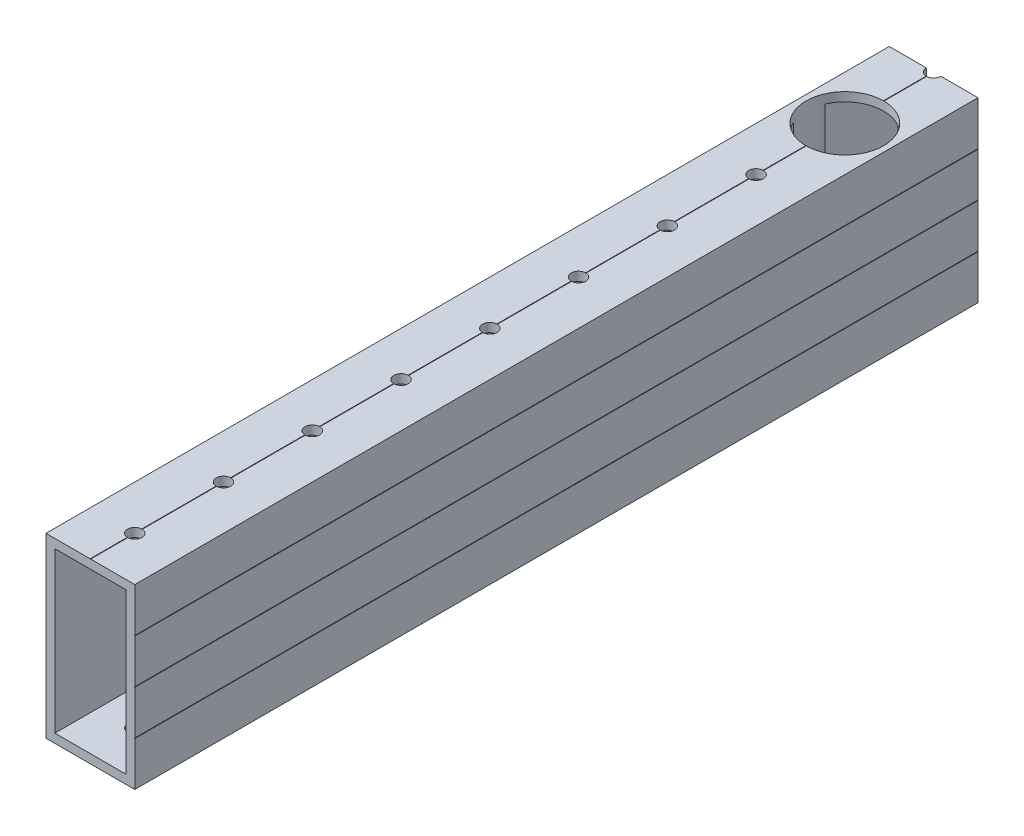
ISO-10303-21;
HEADER;
FILE_DESCRIPTION(('STEP AP214'),'2;1');
FILE_NAME('part.step','',(''),(''),'','','');
FILE_SCHEMA(('AUTOMOTIVE_DESIGN { 1 0 10303 214 1 1 1 1 }'));
ENDSEC;
DATA;
#1=APPLICATION_CONTEXT('core data for automotive mechanical design processes');
#2=APPLICATION_PROTOCOL_DEFINITION('international standard','automotive_design',2000,#1);
#3=PRODUCT_CONTEXT('',#1,'mechanical');
#4=PRODUCT('Part','Part','',(#3));
#5=PRODUCT_RELATED_PRODUCT_CATEGORY('part','',(#4));
#6=PRODUCT_DEFINITION_FORMATION('','',#4);
#7=PRODUCT_DEFINITION_CONTEXT('part definition',#1,'design');
#8=PRODUCT_DEFINITION('design','',#6,#7);
#9=PRODUCT_DEFINITION_SHAPE('','',#8);
#10=(LENGTH_UNIT() NAMED_UNIT(*) SI_UNIT(.MILLI.,.METRE.));
#11=(NAMED_UNIT(*) PLANE_ANGLE_UNIT() SI_UNIT($,.RADIAN.));
#12=(NAMED_UNIT(*) SI_UNIT($,.STERADIAN.) SOLID_ANGLE_UNIT());
#13=UNCERTAINTY_MEASURE_WITH_UNIT(LENGTH_MEASURE(1.E-05),#10,'distance_accuracy_value','');
#14=(GEOMETRIC_REPRESENTATION_CONTEXT(3) GLOBAL_UNCERTAINTY_ASSIGNED_CONTEXT((#13)) GLOBAL_UNIT_ASSIGNED_CONTEXT((#10,
#11,#12)) REPRESENTATION_CONTEXT('',''));
#15=CARTESIAN_POINT('',(0.,0.,0.));
#16=DIRECTION('',(0.,0.,1.));
#17=DIRECTION('',(1.,0.,0.));
#18=AXIS2_PLACEMENT_3D('',#15,#16,#17);
#19=CARTESIAN_POINT('',(-10.16,0.,749.3));
#20=DIRECTION('',(1.,0.,0.));
#21=DIRECTION('',(0.,0.,-1.));
#22=AXIS2_PLACEMENT_3D('',#19,#20,#21);
#23=PLANE('',#22);
#24=DIRECTION('',(0.,1.,0.));
#25=VECTOR('',#24,1.);
#26=CARTESIAN_POINT('',(-10.16,-25.400025,528.898660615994));
#27=LINE('',#26,#25);
#28=CARTESIAN_POINT('',(-10.16,-22.86,528.898660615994));
#29=VERTEX_POINT('',#28);
#30=CARTESIAN_POINT('',(-10.16,22.86,528.898660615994));
#31=VERTEX_POINT('',#30);
#32=EDGE_CURVE('E1151',#29,#31,#27,.T.);
#33=ORIENTED_EDGE('',*,*,#32,.F.);
#34=DIRECTION('',(0.,0.,1.));
#35=VECTOR('',#34,1.);
#36=CARTESIAN_POINT('',(-10.16,-22.86,749.3));
#37=LINE('',#36,#35);
#38=CARTESIAN_POINT('',(-10.16,-22.86,508.));
#39=VERTEX_POINT('',#38);
#40=EDGE_CURVE('E670',#39,#29,#37,.T.);
#41=ORIENTED_EDGE('',*,*,#40,.F.);
#42=DIRECTION('',(0.,-1.,0.));
#43=VECTOR('',#42,1.);
#44=CARTESIAN_POINT('',(-10.16,0.,508.));
#45=LINE('',#44,#43);
#46=CARTESIAN_POINT('',(-10.16,22.86,508.));
#47=VERTEX_POINT('',#46);
#48=EDGE_CURVE('E1240',#47,#39,#45,.T.);
#49=ORIENTED_EDGE('',*,*,#48,.F.);
#50=DIRECTION('',(0.,0.,-1.));
#51=VECTOR('',#50,1.);
#52=CARTESIAN_POINT('',(-10.16,22.86,749.3));
#53=LINE('',#52,#51);
#54=EDGE_CURVE('E623',#31,#47,#53,.T.);
#55=ORIENTED_EDGE('',*,*,#54,.F.);
#56=EDGE_LOOP('',(#33,#41,#49,#55));
#57=FACE_BOUND('',#56,.T.);
#58=ADVANCED_FACE('F38',(#57),#23,.T.);
#59=CARTESIAN_POINT('',(0.,-22.86,749.3));
#60=DIRECTION('',(0.,1.,0.));
#61=DIRECTION('',(0.,0.,1.));
#62=AXIS2_PLACEMENT_3D('',#59,#60,#61);
#63=PLANE('',#62);
#64=CARTESIAN_POINT('',(0.,-22.86,533.4));
#65=DIRECTION('',(0.,1.,0.));
#66=DIRECTION('',(0.,0.,1.));
#67=AXIS2_PLACEMENT_3D('',#64,#65,#66);
#68=CIRCLE('',#67,11.1125);
#69=CARTESIAN_POINT('',(10.16,-22.86,528.898660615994));
#70=VERTEX_POINT('',#69);
#71=EDGE_CURVE('E1156',#70,#29,#68,.T.);
#72=ORIENTED_EDGE('',*,*,#71,.F.);
#73=DIRECTION('',(0.,0.,1.));
#74=VECTOR('',#73,1.);
#75=CARTESIAN_POINT('',(10.16,-22.86,749.3));
#76=LINE('',#75,#74);
#77=CARTESIAN_POINT('',(10.16,-22.86,508.));
#78=VERTEX_POINT('',#77);
#79=EDGE_CURVE('E588',#78,#70,#76,.T.);
#80=ORIENTED_EDGE('',*,*,#79,.F.);
#81=DIRECTION('',(1.,0.,0.));
#82=VECTOR('',#81,1.);
#83=CARTESIAN_POINT('',(0.,-22.86,508.));
#84=LINE('',#83,#82);
#85=CARTESIAN_POINT('',(2.07009999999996,-22.86,508.));
#86=VERTEX_POINT('',#85);
#87=EDGE_CURVE('E1443',#86,#78,#84,.T.);
#88=ORIENTED_EDGE('',*,*,#87,.F.);
#89=CARTESIAN_POINT('',(0.,-22.86,508.));
#90=DIRECTION('',(0.,1.,0.));
#91=DIRECTION('',(0.,0.,1.));
#92=AXIS2_PLACEMENT_3D('',#89,#90,#91);
#93=CIRCLE('',#92,2.07009999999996);
#94=CARTESIAN_POINT('',(-2.07009999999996,-22.86,508.));
#95=VERTEX_POINT('',#94);
#96=EDGE_CURVE('E667',#86,#95,#93,.F.);
#97=ORIENTED_EDGE('',*,*,#96,.T.);
#98=EDGE_CURVE('E1245',#39,#95,#84,.T.);
#99=ORIENTED_EDGE('',*,*,#98,.F.);
#100=ORIENTED_EDGE('',*,*,#40,.T.);
#101=EDGE_LOOP('',(#72,#80,#88,#97,#99,#100));
#102=FACE_BOUND('',#101,.T.);
#103=ADVANCED_FACE('F1511',(#102),#63,.T.);
#104=CARTESIAN_POINT('',(0.,22.86,749.3));
#105=DIRECTION('',(0.,-1.,0.));
#106=DIRECTION('',(0.,0.,-1.));
#107=AXIS2_PLACEMENT_3D('',#104,#105,#106);
#108=PLANE('',#107);
#109=CARTESIAN_POINT('',(0.,22.86,533.4));
#110=DIRECTION('',(0.,-1.,0.));
#111=DIRECTION('',(0.,0.,-1.));
#112=AXIS2_PLACEMENT_3D('',#109,#110,#111);
#113=CIRCLE('',#112,11.1125);
#114=CARTESIAN_POINT('',(10.16,22.86,537.901339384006));
#115=VERTEX_POINT('',#114);
#116=CARTESIAN_POINT('',(-10.16,22.86,537.901339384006));
#117=VERTEX_POINT('',#116);
#118=EDGE_CURVE('E1159',#115,#117,#113,.T.);
#119=ORIENTED_EDGE('',*,*,#118,.F.);
#120=DIRECTION('',(0.,0.,1.));
#121=VECTOR('',#120,1.);
#122=CARTESIAN_POINT('',(10.16,22.86,749.3));
#123=LINE('',#122,#121);
#124=CARTESIAN_POINT('',(10.16,22.86,749.3));
#125=VERTEX_POINT('',#124);
#126=EDGE_CURVE('E390',#125,#115,#123,.F.);
#127=ORIENTED_EDGE('',*,*,#126,.F.);
#128=DIRECTION('',(1.,0.,0.));
#129=VECTOR('',#128,1.);
#130=CARTESIAN_POINT('',(0.,22.86,749.3));
#131=LINE('',#130,#129);
#132=CARTESIAN_POINT('',(-10.16,22.86,749.3));
#133=VERTEX_POINT('',#132);
#134=EDGE_CURVE('E624',#125,#133,#131,.F.);
#135=ORIENTED_EDGE('',*,*,#134,.T.);
#136=EDGE_CURVE('E620',#133,#117,#53,.T.);
#137=ORIENTED_EDGE('',*,*,#136,.T.);
#138=EDGE_LOOP('',(#119,#127,#135,#137));
#139=FACE_BOUND('',#138,.T.);
#140=CARTESIAN_POINT('',(0.,22.86,736.6));
#141=DIRECTION('',(0.,1.,0.));
#142=DIRECTION('',(0.,0.,1.));
#143=AXIS2_PLACEMENT_3D('',#140,#141,#142);
#144=CIRCLE('',#143,2.07009999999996);
#145=CARTESIAN_POINT('',(0.,22.86,738.6701));
#146=VERTEX_POINT('',#145);
#147=EDGE_CURVE('E593',#146,#146,#144,.T.);
#148=ORIENTED_EDGE('',*,*,#147,.T.);
#149=EDGE_LOOP('',(#148));
#150=FACE_BOUND('',#149,.T.);
#151=CARTESIAN_POINT('',(0.,22.86,711.2));
#152=DIRECTION('',(0.,1.,0.));
#153=DIRECTION('',(0.,0.,1.));
#154=AXIS2_PLACEMENT_3D('',#151,#152,#153);
#155=CIRCLE('',#154,2.07009999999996);
#156=CARTESIAN_POINT('',(0.,22.86,713.2701));
#157=VERTEX_POINT('',#156);
#158=EDGE_CURVE('E596',#157,#157,#155,.T.);
#159=ORIENTED_EDGE('',*,*,#158,.T.);
#160=EDGE_LOOP('',(#159));
#161=FACE_BOUND('',#160,.T.);
#162=CARTESIAN_POINT('',(0.,22.86,685.8));
#163=DIRECTION('',(0.,1.,0.));
#164=DIRECTION('',(0.,0.,1.));
#165=AXIS2_PLACEMENT_3D('',#162,#163,#164);
#166=CIRCLE('',#165,2.07009999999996);
#167=CARTESIAN_POINT('',(0.,22.86,687.8701));
#168=VERTEX_POINT('',#167);
#169=EDGE_CURVE('E599',#168,#168,#166,.T.);
#170=ORIENTED_EDGE('',*,*,#169,.T.);
#171=EDGE_LOOP('',(#170));
#172=FACE_BOUND('',#171,.T.);
#173=CARTESIAN_POINT('',(0.,22.86,660.4));
#174=DIRECTION('',(0.,1.,0.));
#175=DIRECTION('',(0.,0.,1.));
#176=AXIS2_PLACEMENT_3D('',#173,#174,#175);
#177=CIRCLE('',#176,2.07009999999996);
#178=CARTESIAN_POINT('',(0.,22.86,662.4701));
#179=VERTEX_POINT('',#178);
#180=EDGE_CURVE('E602',#179,#179,#177,.T.);
#181=ORIENTED_EDGE('',*,*,#180,.T.);
#182=EDGE_LOOP('',(#181));
#183=FACE_BOUND('',#182,.T.);
#184=CARTESIAN_POINT('',(0.,22.86,635.));
#185=DIRECTION('',(0.,1.,0.));
#186=DIRECTION('',(0.,0.,1.));
#187=AXIS2_PLACEMENT_3D('',#184,#185,#186);
#188=CIRCLE('',#187,2.07009999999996);
#189=CARTESIAN_POINT('',(0.,22.86,637.0701));
#190=VERTEX_POINT('',#189);
#191=EDGE_CURVE('E605',#190,#190,#188,.T.);
#192=ORIENTED_EDGE('',*,*,#191,.T.);
#193=EDGE_LOOP('',(#192));
#194=FACE_BOUND('',#193,.T.);
#195=CARTESIAN_POINT('',(0.,22.86,609.6));
#196=DIRECTION('',(0.,1.,0.));
#197=DIRECTION('',(0.,0.,1.));
#198=AXIS2_PLACEMENT_3D('',#195,#196,#197);
#199=CIRCLE('',#198,2.07009999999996);
#200=CARTESIAN_POINT('',(0.,22.86,611.6701));
#201=VERTEX_POINT('',#200);
#202=EDGE_CURVE('E608',#201,#201,#199,.T.);
#203=ORIENTED_EDGE('',*,*,#202,.T.);
#204=EDGE_LOOP('',(#203));
#205=FACE_BOUND('',#204,.T.);
#206=CARTESIAN_POINT('',(0.,22.86,584.2));
#207=DIRECTION('',(0.,1.,0.));
#208=DIRECTION('',(0.,0.,1.));
#209=AXIS2_PLACEMENT_3D('',#206,#207,#208);
#210=CIRCLE('',#209,2.07009999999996);
#211=CARTESIAN_POINT('',(0.,22.86,586.2701));
#212=VERTEX_POINT('',#211);
#213=EDGE_CURVE('E611',#212,#212,#210,.T.);
#214=ORIENTED_EDGE('',*,*,#213,.T.);
#215=EDGE_LOOP('',(#214));
#216=FACE_BOUND('',#215,.T.);
#217=CARTESIAN_POINT('',(0.,22.86,558.8));
#218=DIRECTION('',(0.,1.,0.));
#219=DIRECTION('',(0.,0.,1.));
#220=AXIS2_PLACEMENT_3D('',#217,#218,#219);
#221=CIRCLE('',#220,2.07009999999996);
#222=CARTESIAN_POINT('',(0.,22.86,560.8701));
#223=VERTEX_POINT('',#222);
#224=EDGE_CURVE('E614',#223,#223,#221,.T.);
#225=ORIENTED_EDGE('',*,*,#224,.T.);
#226=EDGE_LOOP('',(#225));
#227=FACE_BOUND('',#226,.T.);
#228=ADVANCED_FACE('F1519',(#139,#150,#161,#172,#183,#194,#205,#216,#227),#108,.T.);
#229=CARTESIAN_POINT('',(10.16,0.,749.3));
#230=DIRECTION('',(-1.,0.,0.));
#231=DIRECTION('',(0.,0.,1.));
#232=AXIS2_PLACEMENT_3D('',#229,#230,#231);
#233=PLANE('',#232);
#234=DIRECTION('',(0.,1.,0.));
#235=VECTOR('',#234,1.);
#236=CARTESIAN_POINT('',(10.16,-25.400025,537.901339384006));
#237=LINE('',#236,#235);
#238=CARTESIAN_POINT('',(10.16,-22.86,537.901339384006));
#239=VERTEX_POINT('',#238);
#240=EDGE_CURVE('E12',#239,#115,#237,.T.);
#241=ORIENTED_EDGE('',*,*,#240,.F.);
#242=CARTESIAN_POINT('',(10.16,-22.86,749.3));
#243=VERTEX_POINT('',#242);
#244=EDGE_CURVE('E592',#239,#243,#76,.T.);
#245=ORIENTED_EDGE('',*,*,#244,.T.);
#246=DIRECTION('',(0.,1.,0.));
#247=VECTOR('',#246,1.);
#248=CARTESIAN_POINT('',(10.16,0.,749.3));
#249=LINE('',#248,#247);
#250=EDGE_CURVE('E591',#243,#125,#249,.T.);
#251=ORIENTED_EDGE('',*,*,#250,.T.);
#252=ORIENTED_EDGE('',*,*,#126,.T.);
#253=EDGE_LOOP('',(#241,#245,#251,#252));
#254=FACE_BOUND('',#253,.T.);
#255=ADVANCED_FACE('F1783',(#254),#233,.T.);
#256=CARTESIAN_POINT('',(0.,0.,508.));
#257=DIRECTION('',(0.,0.,1.));
#258=DIRECTION('',(1.,0.,0.));
#259=AXIS2_PLACEMENT_3D('',#256,#257,#258);
#260=PLANE('',#259);
#261=DIRECTION('',(-0.707106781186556,-0.70710678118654,0.));
#262=VECTOR('',#261,1.);
#263=CARTESIAN_POINT('',(-12.6238,0.,508.));
#264=LINE('',#263,#262);
#265=CARTESIAN_POINT('',(-12.6238,0.,508.));
#266=VERTEX_POINT('',#265);
#267=CARTESIAN_POINT('',(-12.7,-0.0761999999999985,508.));
#268=VERTEX_POINT('',#267);
#269=EDGE_CURVE('E508',#266,#268,#264,.T.);
#270=ORIENTED_EDGE('',*,*,#269,.F.);
#271=DIRECTION('',(0.707106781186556,-0.70710678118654,0.));
#272=VECTOR('',#271,1.);
#273=CARTESIAN_POINT('',(-12.7,0.0761999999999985,508.));
#274=LINE('',#273,#272);
#275=CARTESIAN_POINT('',(-12.7,0.0761999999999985,508.));
#276=VERTEX_POINT('',#275);
#277=EDGE_CURVE('E1264',#276,#266,#274,.T.);
#278=ORIENTED_EDGE('',*,*,#277,.F.);
#279=DIRECTION('',(0.,-1.,0.));
#280=VECTOR('',#279,1.);
#281=CARTESIAN_POINT('',(-12.7,-25.4,508.));
#282=LINE('',#281,#280);
#283=CARTESIAN_POINT('',(-12.7,12.6238000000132,508.));
#284=VERTEX_POINT('',#283);
#285=EDGE_CURVE('E1258',#284,#276,#282,.T.);
#286=ORIENTED_EDGE('',*,*,#285,.F.);
#287=DIRECTION('',(-0.707106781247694,-0.707106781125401,0.));
#288=VECTOR('',#287,1.);
#289=CARTESIAN_POINT('',(-12.6238,12.7,508.));
#290=LINE('',#289,#288);
#291=CARTESIAN_POINT('',(-12.6238,12.7,508.));
#292=VERTEX_POINT('',#291);
#293=EDGE_CURVE('E1252',#292,#284,#290,.T.);
#294=ORIENTED_EDGE('',*,*,#293,.F.);
#295=DIRECTION('',(0.707106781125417,-0.707106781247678,0.));
#296=VECTOR('',#295,1.);
#297=CARTESIAN_POINT('',(-12.7,12.7762000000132,508.));
#298=LINE('',#297,#296);
#299=CARTESIAN_POINT('',(-12.7,12.7762000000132,508.));
#300=VERTEX_POINT('',#299);
#301=EDGE_CURVE('E1250',#300,#292,#298,.T.);
#302=ORIENTED_EDGE('',*,*,#301,.F.);
#303=DIRECTION('',(0.,-1.,0.));
#304=VECTOR('',#303,1.);
#305=CARTESIAN_POINT('',(-12.7,-25.4,508.));
#306=LINE('',#305,#304);
#307=CARTESIAN_POINT('',(-12.7,25.4,508.));
#308=VERTEX_POINT('',#307);
#309=EDGE_CURVE('E1246',#308,#300,#306,.T.);
#310=ORIENTED_EDGE('',*,*,#309,.F.);
#311=DIRECTION('',(-1.,0.,0.));
#312=VECTOR('',#311,1.);
#313=CARTESIAN_POINT('',(-12.7,25.4,508.));
#314=LINE('',#313,#312);
#315=CARTESIAN_POINT('',(-2.07009999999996,25.4,508.));
#316=VERTEX_POINT('',#315);
#317=EDGE_CURVE('E1243',#316,#308,#314,.T.);
#318=ORIENTED_EDGE('',*,*,#317,.F.);
#319=DIRECTION('',(0.,1.,0.));
#320=VECTOR('',#319,1.);
#321=CARTESIAN_POINT('',(-2.07009999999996,-25.4,508.));
#322=LINE('',#321,#320);
#323=CARTESIAN_POINT('',(-2.07009999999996,22.86,508.));
#324=VERTEX_POINT('',#323);
#325=EDGE_CURVE('E1238',#324,#316,#322,.T.);
#326=ORIENTED_EDGE('',*,*,#325,.F.);
#327=DIRECTION('',(-1.,0.,0.));
#328=VECTOR('',#327,1.);
#329=CARTESIAN_POINT('',(0.,22.86,508.));
#330=LINE('',#329,#328);
#331=EDGE_CURVE('E1237',#324,#47,#330,.T.);
#332=ORIENTED_EDGE('',*,*,#331,.T.);
#333=ORIENTED_EDGE('',*,*,#48,.T.);
#334=ORIENTED_EDGE('',*,*,#98,.T.);
#335=DIRECTION('',(0.,1.,0.));
#336=VECTOR('',#335,1.);
#337=CARTESIAN_POINT('',(-2.07009999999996,-25.4,508.));
#338=LINE('',#337,#336);
#339=CARTESIAN_POINT('',(-2.07009999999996,-25.4,508.));
#340=VERTEX_POINT('',#339);
#341=EDGE_CURVE('E1248',#340,#95,#338,.T.);
#342=ORIENTED_EDGE('',*,*,#341,.F.);
#343=DIRECTION('',(1.,0.,0.));
#344=VECTOR('',#343,1.);
#345=CARTESIAN_POINT('',(-12.7,-25.4,508.));
#346=LINE('',#345,#344);
#347=CARTESIAN_POINT('',(-12.7,-25.4,508.));
#348=VERTEX_POINT('',#347);
#349=EDGE_CURVE('E1254',#348,#340,#346,.T.);
#350=ORIENTED_EDGE('',*,*,#349,.F.);
#351=DIRECTION('',(0.,-1.,0.));
#352=VECTOR('',#351,1.);
#353=CARTESIAN_POINT('',(-12.7,-25.4,508.));
#354=LINE('',#353,#352);
#355=CARTESIAN_POINT('',(-12.7,-12.7762,508.));
#356=VERTEX_POINT('',#355);
#357=EDGE_CURVE('E1256',#356,#348,#354,.T.);
#358=ORIENTED_EDGE('',*,*,#357,.F.);
#359=DIRECTION('',(-0.70710678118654,-0.707106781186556,0.));
#360=VECTOR('',#359,1.);
#361=CARTESIAN_POINT('',(-12.6238,-12.7,508.));
#362=LINE('',#361,#360);
#363=CARTESIAN_POINT('',(-12.6238,-12.7,508.));
#364=VERTEX_POINT('',#363);
#365=EDGE_CURVE('E1260',#364,#356,#362,.T.);
#366=ORIENTED_EDGE('',*,*,#365,.F.);
#367=DIRECTION('',(0.707106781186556,-0.70710678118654,0.));
#368=VECTOR('',#367,1.);
#369=CARTESIAN_POINT('',(-12.7,-12.6238,508.));
#370=LINE('',#369,#368);
#371=CARTESIAN_POINT('',(-12.7,-12.6238,508.));
#372=VERTEX_POINT('',#371);
#373=EDGE_CURVE('E1262',#372,#364,#370,.T.);
#374=ORIENTED_EDGE('',*,*,#373,.F.);
#375=DIRECTION('',(0.,-1.,0.));
#376=VECTOR('',#375,1.);
#377=CARTESIAN_POINT('',(-12.7,-25.4,508.));
#378=LINE('',#377,#376);
#379=EDGE_CURVE('E1265',#268,#372,#378,.T.);
#380=ORIENTED_EDGE('',*,*,#379,.F.);
#381=EDGE_LOOP('',(#270,#278,#286,#294,#302,#310,#318,#326,#332,#333,#334,#342,#350,#358,#366,
#374,#380));
#382=FACE_BOUND('',#381,.T.);
#383=ADVANCED_FACE('F1281',(#382),#260,.F.);
#384=CARTESIAN_POINT('',(-12.7,0.0761999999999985,749.3));
#385=DIRECTION('',(0.70710678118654,0.707106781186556,0.));
#386=DIRECTION('',(-0.707106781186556,0.70710678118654,0.));
#387=AXIS2_PLACEMENT_3D('',#384,#385,#386);
#388=PLANE('',#387);
#389=DIRECTION('',(0.,0.,-1.));
#390=VECTOR('',#389,1.);
#391=CARTESIAN_POINT('',(-12.7,0.0761999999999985,749.3));
#392=LINE('',#391,#390);
#393=CARTESIAN_POINT('',(-12.7,0.0761999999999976,749.3));
#394=VERTEX_POINT('',#393);
#395=EDGE_CURVE('E173',#394,#276,#392,.T.);
#396=ORIENTED_EDGE('',*,*,#395,.T.);
#397=ORIENTED_EDGE('',*,*,#277,.T.);
#398=DIRECTION('',(0.,0.,1.));
#399=VECTOR('',#398,1.);
#400=CARTESIAN_POINT('',(-12.6238,0.,749.3));
#401=LINE('',#400,#399);
#402=CARTESIAN_POINT('',(-12.6238,0.,749.3));
#403=VERTEX_POINT('',#402);
#404=EDGE_CURVE('E499',#266,#403,#401,.T.);
#405=ORIENTED_EDGE('',*,*,#404,.T.);
#406=DIRECTION('',(-0.707106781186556,0.70710678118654,0.));
#407=VECTOR('',#406,1.);
#408=CARTESIAN_POINT('',(-12.7,0.0761999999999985,749.3));
#409=LINE('',#408,#407);
#410=EDGE_CURVE('E505',#394,#403,#409,.F.);
#411=ORIENTED_EDGE('',*,*,#410,.F.);
#412=EDGE_LOOP('',(#396,#397,#405,#411));
#413=FACE_BOUND('',#412,.T.);
#414=ADVANCED_FACE('F40',(#413),#388,.F.);
#415=CARTESIAN_POINT('',(-12.6238,12.7,749.3));
#416=DIRECTION('',(0.707106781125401,-0.707106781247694,0.));
#417=DIRECTION('',(0.707106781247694,0.707106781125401,0.));
#418=AXIS2_PLACEMENT_3D('',#415,#416,#417);
#419=PLANE('',#418);
#420=DIRECTION('',(0.,0.,1.));
#421=VECTOR('',#420,1.);
#422=CARTESIAN_POINT('',(-12.6238,12.7,749.3));
#423=LINE('',#422,#421);
#424=CARTESIAN_POINT('',(-12.6238,12.7,749.3));
#425=VERTEX_POINT('',#424);
#426=EDGE_CURVE('E272',#425,#292,#423,.F.);
#427=ORIENTED_EDGE('',*,*,#426,.T.);
#428=ORIENTED_EDGE('',*,*,#293,.T.);
#429=DIRECTION('',(0.,0.,-1.));
#430=VECTOR('',#429,1.);
#431=CARTESIAN_POINT('',(-12.7,12.6238000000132,749.3));
#432=LINE('',#431,#430);
#433=CARTESIAN_POINT('',(-12.7,12.6238000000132,749.3));
#434=VERTEX_POINT('',#433);
#435=EDGE_CURVE('E434',#284,#434,#432,.F.);
#436=ORIENTED_EDGE('',*,*,#435,.T.);
#437=DIRECTION('',(0.707106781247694,0.707106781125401,0.));
#438=VECTOR('',#437,1.);
#439=CARTESIAN_POINT('',(-12.6238,12.7,749.3));
#440=LINE('',#439,#438);
#441=EDGE_CURVE('E502',#425,#434,#440,.F.);
#442=ORIENTED_EDGE('',*,*,#441,.F.);
#443=EDGE_LOOP('',(#427,#428,#436,#442));
#444=FACE_BOUND('',#443,.T.);
#445=ADVANCED_FACE('F1771',(#444),#419,.F.);
#446=CARTESIAN_POINT('',(-12.6238,0.,749.3));
#447=DIRECTION('',(0.70710678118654,-0.707106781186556,0.));
#448=DIRECTION('',(0.707106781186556,0.70710678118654,0.));
#449=AXIS2_PLACEMENT_3D('',#446,#447,#448);
#450=PLANE('',#449);
#451=ORIENTED_EDGE('',*,*,#404,.F.);
#452=ORIENTED_EDGE('',*,*,#269,.T.);
#453=DIRECTION('',(0.,0.,-1.));
#454=VECTOR('',#453,1.);
#455=CARTESIAN_POINT('',(-12.7,-0.0761999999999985,749.3));
#456=LINE('',#455,#454);
#457=CARTESIAN_POINT('',(-12.7,-0.0761999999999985,749.3));
#458=VERTEX_POINT('',#457);
#459=EDGE_CURVE('E430',#268,#458,#456,.F.);
#460=ORIENTED_EDGE('',*,*,#459,.T.);
#461=DIRECTION('',(0.707106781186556,0.70710678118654,0.));
#462=VECTOR('',#461,1.);
#463=CARTESIAN_POINT('',(-12.6238,0.,749.3));
#464=LINE('',#463,#462);
#465=EDGE_CURVE('E495',#403,#458,#464,.F.);
#466=ORIENTED_EDGE('',*,*,#465,.F.);
#467=EDGE_LOOP('',(#451,#452,#460,#466));
#468=FACE_BOUND('',#467,.T.);
#469=ADVANCED_FACE('F1273',(#468),#450,.F.);
#470=CARTESIAN_POINT('',(-12.7,-12.6238,749.3));
#471=DIRECTION('',(0.70710678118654,0.707106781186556,0.));
#472=DIRECTION('',(-0.707106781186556,0.70710678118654,0.));
#473=AXIS2_PLACEMENT_3D('',#470,#471,#472);
#474=PLANE('',#473);
#475=DIRECTION('',(0.,0.,-1.));
#476=VECTOR('',#475,1.);
#477=CARTESIAN_POINT('',(-12.7,-12.6238,749.3));
#478=LINE('',#477,#476);
#479=CARTESIAN_POINT('',(-12.7,-12.6238,749.3));
#480=VERTEX_POINT('',#479);
#481=EDGE_CURVE('E433',#480,#372,#478,.T.);
#482=ORIENTED_EDGE('',*,*,#481,.T.);
#483=ORIENTED_EDGE('',*,*,#373,.T.);
#484=DIRECTION('',(0.,0.,1.));
#485=VECTOR('',#484,1.);
#486=CARTESIAN_POINT('',(-12.6238,-12.7,749.3));
#487=LINE('',#486,#485);
#488=CARTESIAN_POINT('',(-12.6238,-12.7,749.3));
#489=VERTEX_POINT('',#488);
#490=EDGE_CURVE('E492',#364,#489,#487,.T.);
#491=ORIENTED_EDGE('',*,*,#490,.T.);
#492=DIRECTION('',(-0.707106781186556,0.70710678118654,0.));
#493=VECTOR('',#492,1.);
#494=CARTESIAN_POINT('',(-12.7,-12.6238,749.3));
#495=LINE('',#494,#493);
#496=EDGE_CURVE('E498',#480,#489,#495,.F.);
#497=ORIENTED_EDGE('',*,*,#496,.F.);
#498=EDGE_LOOP('',(#482,#483,#491,#497));
#499=FACE_BOUND('',#498,.T.);
#500=ADVANCED_FACE('F1286',(#499),#474,.F.);
#501=CARTESIAN_POINT('',(-12.6238,-12.7,749.3));
#502=DIRECTION('',(0.707106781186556,-0.70710678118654,0.));
#503=DIRECTION('',(0.70710678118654,0.707106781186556,0.));
#504=AXIS2_PLACEMENT_3D('',#501,#502,#503);
#505=PLANE('',#504);
#506=ORIENTED_EDGE('',*,*,#490,.F.);
#507=ORIENTED_EDGE('',*,*,#365,.T.);
#508=DIRECTION('',(0.,0.,-1.));
#509=VECTOR('',#508,1.);
#510=CARTESIAN_POINT('',(-12.7,-12.7762,749.3));
#511=LINE('',#510,#509);
#512=CARTESIAN_POINT('',(-12.7,-12.7762,749.3));
#513=VERTEX_POINT('',#512);
#514=EDGE_CURVE('E169',#356,#513,#511,.F.);
#515=ORIENTED_EDGE('',*,*,#514,.T.);
#516=DIRECTION('',(0.70710678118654,0.707106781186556,0.));
#517=VECTOR('',#516,1.);
#518=CARTESIAN_POINT('',(-12.6238,-12.7,749.3));
#519=LINE('',#518,#517);
#520=EDGE_CURVE('E487',#489,#513,#519,.F.);
#521=ORIENTED_EDGE('',*,*,#520,.F.);
#522=EDGE_LOOP('',(#506,#507,#515,#521));
#523=FACE_BOUND('',#522,.T.);
#524=ADVANCED_FACE('F1291',(#523),#505,.F.);
#525=CARTESIAN_POINT('',(0.,-25.3238,749.3));
#526=DIRECTION('',(-0.707106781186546,0.707106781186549,0.));
#527=DIRECTION('',(-0.707106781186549,-0.707106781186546,0.));
#528=AXIS2_PLACEMENT_3D('',#525,#526,#527);
#529=PLANE('',#528);
#530=DIRECTION('',(-0.707106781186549,-0.707106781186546,0.));
#531=VECTOR('',#530,1.);
#532=CARTESIAN_POINT('',(0.,-25.3238,749.3));
#533=LINE('',#532,#531);
#534=CARTESIAN_POINT('',(-0.0762000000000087,-25.4,749.3));
#535=VERTEX_POINT('',#534);
#536=CARTESIAN_POINT('',(0.,-25.3238,749.3));
#537=VERTEX_POINT('',#536);
#538=EDGE_CURVE('E483',#535,#537,#533,.F.);
#539=ORIENTED_EDGE('',*,*,#538,.F.);
#540=DIRECTION('',(0.,0.,1.));
#541=VECTOR('',#540,1.);
#542=CARTESIAN_POINT('',(-0.0762000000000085,-25.4,749.3));
#543=LINE('',#542,#541);
#544=CARTESIAN_POINT('',(-0.0762000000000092,-25.4,738.668697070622));
#545=VERTEX_POINT('',#544);
#546=EDGE_CURVE('E163',#535,#545,#543,.F.);
#547=ORIENTED_EDGE('',*,*,#546,.T.);
#548=CARTESIAN_POINT('',(0.,-25.3238,736.6));
#549=DIRECTION('',(-0.707106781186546,0.707106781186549,0.));
#550=DIRECTION('',(0.707106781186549,0.707106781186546,0.));
#551=AXIS2_PLACEMENT_3D('',#548,#549,#550);
#552=ELLIPSE('',#551,2.92756349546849,2.07009999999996);
#553=CARTESIAN_POINT('',(0.,-25.3238,738.6701));
#554=VERTEX_POINT('',#553);
#555=EDGE_CURVE('E174',#545,#554,#552,.T.);
#556=ORIENTED_EDGE('',*,*,#555,.T.);
#557=DIRECTION('',(0.,0.,1.));
#558=VECTOR('',#557,1.);
#559=CARTESIAN_POINT('',(0.,-25.3238,749.3));
#560=LINE('',#559,#558);
#561=EDGE_CURVE('E480',#554,#537,#560,.T.);
#562=ORIENTED_EDGE('',*,*,#561,.T.);
#563=EDGE_LOOP('',(#539,#547,#556,#562));
#564=FACE_BOUND('',#563,.T.);
#565=ADVANCED_FACE('F1621',(#564),#529,.F.);
#566=CARTESIAN_POINT('',(0.,-25.3238,749.3));
#567=DIRECTION('',(-0.707106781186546,0.707106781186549,0.));
#568=DIRECTION('',(-0.707106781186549,-0.707106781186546,0.));
#569=AXIS2_PLACEMENT_3D('',#566,#567,#568);
#570=PLANE('',#569);
#571=CARTESIAN_POINT('',(0.,-25.3238,736.6));
#572=DIRECTION('',(-0.707106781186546,0.707106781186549,0.));
#573=DIRECTION('',(0.707106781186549,0.707106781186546,0.));
#574=AXIS2_PLACEMENT_3D('',#571,#572,#573);
#575=ELLIPSE('',#574,2.92756349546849,2.07009999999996);
#576=CARTESIAN_POINT('',(0.,-25.3238,734.5299));
#577=VERTEX_POINT('',#576);
#578=CARTESIAN_POINT('',(-0.0762000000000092,-25.4,734.531302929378));
#579=VERTEX_POINT('',#578);
#580=EDGE_CURVE('E170',#577,#579,#575,.T.);
#581=ORIENTED_EDGE('',*,*,#580,.T.);
#582=DIRECTION('',(0.,0.,1.));
#583=VECTOR('',#582,1.);
#584=CARTESIAN_POINT('',(-0.0762000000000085,-25.4,749.3));
#585=LINE('',#584,#583);
#586=CARTESIAN_POINT('',(-0.0762000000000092,-25.4,713.268697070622));
#587=VERTEX_POINT('',#586);
#588=EDGE_CURVE('E157',#579,#587,#585,.F.);
#589=ORIENTED_EDGE('',*,*,#588,.T.);
#590=CARTESIAN_POINT('',(0.,-25.3238,711.2));
#591=DIRECTION('',(-0.707106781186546,0.707106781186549,0.));
#592=DIRECTION('',(0.707106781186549,0.707106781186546,0.));
#593=AXIS2_PLACEMENT_3D('',#590,#591,#592);
#594=ELLIPSE('',#593,2.92756349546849,2.07009999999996);
#595=CARTESIAN_POINT('',(0.,-25.3238,713.2701));
#596=VERTEX_POINT('',#595);
#597=EDGE_CURVE('E186',#587,#596,#594,.T.);
#598=ORIENTED_EDGE('',*,*,#597,.T.);
#599=DIRECTION('',(0.,0.,1.));
#600=VECTOR('',#599,1.);
#601=CARTESIAN_POINT('',(0.,-25.3238,749.3));
#602=LINE('',#601,#600);
#603=EDGE_CURVE('E509',#596,#577,#602,.T.);
#604=ORIENTED_EDGE('',*,*,#603,.T.);
#605=EDGE_LOOP('',(#581,#589,#598,#604));
#606=FACE_BOUND('',#605,.T.);
#607=ADVANCED_FACE('F1620',(#606),#570,.F.);
#608=CARTESIAN_POINT('',(0.,-25.3238,749.3));
#609=DIRECTION('',(-0.707106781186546,0.707106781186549,0.));
#610=DIRECTION('',(-0.707106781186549,-0.707106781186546,0.));
#611=AXIS2_PLACEMENT_3D('',#608,#609,#610);
#612=PLANE('',#611);
#613=CARTESIAN_POINT('',(0.,-25.3238,711.2));
#614=DIRECTION('',(-0.707106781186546,0.707106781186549,0.));
#615=DIRECTION('',(0.707106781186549,0.707106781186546,0.));
#616=AXIS2_PLACEMENT_3D('',#613,#614,#615);
#617=ELLIPSE('',#616,2.92756349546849,2.07009999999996);
#618=CARTESIAN_POINT('',(0.,-25.3238,709.1299));
#619=VERTEX_POINT('',#618);
#620=CARTESIAN_POINT('',(-0.0762000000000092,-25.4,709.131302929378));
#621=VERTEX_POINT('',#620);
#622=EDGE_CURVE('E183',#619,#621,#617,.T.);
#623=ORIENTED_EDGE('',*,*,#622,.T.);
#624=DIRECTION('',(0.,0.,1.));
#625=VECTOR('',#624,1.);
#626=CARTESIAN_POINT('',(-0.0762000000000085,-25.4,749.3));
#627=LINE('',#626,#625);
#628=CARTESIAN_POINT('',(-0.0762000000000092,-25.4,687.868697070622));
#629=VERTEX_POINT('',#628);
#630=EDGE_CURVE('E151',#621,#629,#627,.F.);
#631=ORIENTED_EDGE('',*,*,#630,.T.);
#632=CARTESIAN_POINT('',(0.,-25.3238,685.8));
#633=DIRECTION('',(-0.707106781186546,0.707106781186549,0.));
#634=DIRECTION('',(0.707106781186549,0.707106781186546,0.));
#635=AXIS2_PLACEMENT_3D('',#632,#633,#634);
#636=ELLIPSE('',#635,2.92756349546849,2.07009999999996);
#637=CARTESIAN_POINT('',(0.,-25.3238,687.8701));
#638=VERTEX_POINT('',#637);
#639=EDGE_CURVE('E198',#629,#638,#636,.T.);
#640=ORIENTED_EDGE('',*,*,#639,.T.);
#641=DIRECTION('',(0.,0.,1.));
#642=VECTOR('',#641,1.);
#643=CARTESIAN_POINT('',(0.,-25.3238,749.3));
#644=LINE('',#643,#642);
#645=EDGE_CURVE('E512',#638,#619,#644,.T.);
#646=ORIENTED_EDGE('',*,*,#645,.T.);
#647=EDGE_LOOP('',(#623,#631,#640,#646));
#648=FACE_BOUND('',#647,.T.);
#649=ADVANCED_FACE('F1617',(#648),#612,.F.);
#650=CARTESIAN_POINT('',(0.,-25.3238,749.3));
#651=DIRECTION('',(-0.707106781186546,0.707106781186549,0.));
#652=DIRECTION('',(-0.707106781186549,-0.707106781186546,0.));
#653=AXIS2_PLACEMENT_3D('',#650,#651,#652);
#654=PLANE('',#653);
#655=CARTESIAN_POINT('',(0.,-25.3238,685.8));
#656=DIRECTION('',(-0.707106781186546,0.707106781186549,0.));
#657=DIRECTION('',(0.707106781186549,0.707106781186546,0.));
#658=AXIS2_PLACEMENT_3D('',#655,#656,#657);
#659=ELLIPSE('',#658,2.92756349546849,2.07009999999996);
#660=CARTESIAN_POINT('',(0.,-25.3238,683.7299));
#661=VERTEX_POINT('',#660);
#662=CARTESIAN_POINT('',(-0.0762000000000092,-25.4,683.731302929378));
#663=VERTEX_POINT('',#662);
#664=EDGE_CURVE('E195',#661,#663,#659,.T.);
#665=ORIENTED_EDGE('',*,*,#664,.T.);
#666=DIRECTION('',(0.,0.,1.));
#667=VECTOR('',#666,1.);
#668=CARTESIAN_POINT('',(-0.0762000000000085,-25.4,749.3));
#669=LINE('',#668,#667);
#670=CARTESIAN_POINT('',(-0.0762000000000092,-25.4,662.468697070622));
#671=VERTEX_POINT('',#670);
#672=EDGE_CURVE('E145',#663,#671,#669,.F.);
#673=ORIENTED_EDGE('',*,*,#672,.T.);
#674=CARTESIAN_POINT('',(0.,-25.3238,660.4));
#675=DIRECTION('',(-0.707106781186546,0.707106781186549,0.));
#676=DIRECTION('',(0.707106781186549,0.707106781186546,0.));
#677=AXIS2_PLACEMENT_3D('',#674,#675,#676);
#678=ELLIPSE('',#677,2.92756349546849,2.07009999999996);
#679=CARTESIAN_POINT('',(0.,-25.3238,662.4701));
#680=VERTEX_POINT('',#679);
#681=EDGE_CURVE('E210',#671,#680,#678,.T.);
#682=ORIENTED_EDGE('',*,*,#681,.T.);
#683=DIRECTION('',(0.,0.,1.));
#684=VECTOR('',#683,1.);
#685=CARTESIAN_POINT('',(0.,-25.3238,749.3));
#686=LINE('',#685,#684);
#687=EDGE_CURVE('E519',#680,#661,#686,.T.);
#688=ORIENTED_EDGE('',*,*,#687,.T.);
#689=EDGE_LOOP('',(#665,#673,#682,#688));
#690=FACE_BOUND('',#689,.T.);
#691=ADVANCED_FACE('F1612',(#690),#654,.F.);
#692=CARTESIAN_POINT('',(0.,-25.3238,749.3));
#693=DIRECTION('',(-0.707106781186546,0.707106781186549,0.));
#694=DIRECTION('',(-0.707106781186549,-0.707106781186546,0.));
#695=AXIS2_PLACEMENT_3D('',#692,#693,#694);
#696=PLANE('',#695);
#697=CARTESIAN_POINT('',(0.,-25.3238,660.4));
#698=DIRECTION('',(-0.707106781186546,0.707106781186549,0.));
#699=DIRECTION('',(0.707106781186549,0.707106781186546,0.));
#700=AXIS2_PLACEMENT_3D('',#697,#698,#699);
#701=ELLIPSE('',#700,2.92756349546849,2.07009999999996);
#702=CARTESIAN_POINT('',(0.,-25.3238,658.3299));
#703=VERTEX_POINT('',#702);
#704=CARTESIAN_POINT('',(-0.0762000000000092,-25.4,658.331302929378));
#705=VERTEX_POINT('',#704);
#706=EDGE_CURVE('E207',#703,#705,#701,.T.);
#707=ORIENTED_EDGE('',*,*,#706,.T.);
#708=DIRECTION('',(0.,0.,1.));
#709=VECTOR('',#708,1.);
#710=CARTESIAN_POINT('',(-0.0762000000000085,-25.4,749.3));
#711=LINE('',#710,#709);
#712=CARTESIAN_POINT('',(-0.0762000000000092,-25.4,637.068697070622));
#713=VERTEX_POINT('',#712);
#714=EDGE_CURVE('E139',#705,#713,#711,.F.);
#715=ORIENTED_EDGE('',*,*,#714,.T.);
#716=CARTESIAN_POINT('',(0.,-25.3238,635.));
#717=DIRECTION('',(-0.707106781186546,0.707106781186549,0.));
#718=DIRECTION('',(0.707106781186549,0.707106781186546,0.));
#719=AXIS2_PLACEMENT_3D('',#716,#717,#718);
#720=ELLIPSE('',#719,2.92756349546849,2.07009999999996);
#721=CARTESIAN_POINT('',(0.,-25.3238,637.0701));
#722=VERTEX_POINT('',#721);
#723=EDGE_CURVE('E222',#713,#722,#720,.T.);
#724=ORIENTED_EDGE('',*,*,#723,.T.);
#725=DIRECTION('',(0.,0.,1.));
#726=VECTOR('',#725,1.);
#727=CARTESIAN_POINT('',(0.,-25.3238,749.3));
#728=LINE('',#727,#726);
#729=EDGE_CURVE('E522',#722,#703,#728,.T.);
#730=ORIENTED_EDGE('',*,*,#729,.T.);
#731=EDGE_LOOP('',(#707,#715,#724,#730));
#732=FACE_BOUND('',#731,.T.);
#733=ADVANCED_FACE('F1387',(#732),#696,.F.);
#734=CARTESIAN_POINT('',(0.,-25.3238,749.3));
#735=DIRECTION('',(-0.707106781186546,0.707106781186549,0.));
#736=DIRECTION('',(-0.707106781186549,-0.707106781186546,0.));
#737=AXIS2_PLACEMENT_3D('',#734,#735,#736);
#738=PLANE('',#737);
#739=CARTESIAN_POINT('',(0.,-25.3238,635.));
#740=DIRECTION('',(-0.707106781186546,0.707106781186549,0.));
#741=DIRECTION('',(0.707106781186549,0.707106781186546,0.));
#742=AXIS2_PLACEMENT_3D('',#739,#740,#741);
#743=ELLIPSE('',#742,2.92756349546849,2.07009999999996);
#744=CARTESIAN_POINT('',(0.,-25.3238,632.9299));
#745=VERTEX_POINT('',#744);
#746=CARTESIAN_POINT('',(-0.0762000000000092,-25.4,632.931302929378));
#747=VERTEX_POINT('',#746);
#748=EDGE_CURVE('E219',#745,#747,#743,.T.);
#749=ORIENTED_EDGE('',*,*,#748,.T.);
#750=DIRECTION('',(0.,0.,1.));
#751=VECTOR('',#750,1.);
#752=CARTESIAN_POINT('',(-0.0762000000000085,-25.4,749.3));
#753=LINE('',#752,#751);
#754=CARTESIAN_POINT('',(-0.0762000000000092,-25.4,611.668697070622));
#755=VERTEX_POINT('',#754);
#756=EDGE_CURVE('E133',#747,#755,#753,.F.);
#757=ORIENTED_EDGE('',*,*,#756,.T.);
#758=CARTESIAN_POINT('',(0.,-25.3238,609.6));
#759=DIRECTION('',(-0.707106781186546,0.707106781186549,0.));
#760=DIRECTION('',(0.707106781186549,0.707106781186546,0.));
#761=AXIS2_PLACEMENT_3D('',#758,#759,#760);
#762=ELLIPSE('',#761,2.92756349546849,2.07009999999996);
#763=CARTESIAN_POINT('',(0.,-25.3238,611.6701));
#764=VERTEX_POINT('',#763);
#765=EDGE_CURVE('E234',#755,#764,#762,.T.);
#766=ORIENTED_EDGE('',*,*,#765,.T.);
#767=DIRECTION('',(0.,0.,1.));
#768=VECTOR('',#767,1.);
#769=CARTESIAN_POINT('',(0.,-25.3238,749.3));
#770=LINE('',#769,#768);
#771=EDGE_CURVE('E525',#764,#745,#770,.T.);
#772=ORIENTED_EDGE('',*,*,#771,.T.);
#773=EDGE_LOOP('',(#749,#757,#766,#772));
#774=FACE_BOUND('',#773,.T.);
#775=ADVANCED_FACE('F1406',(#774),#738,.F.);
#776=CARTESIAN_POINT('',(0.,-25.3238,749.3));
#777=DIRECTION('',(-0.707106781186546,0.707106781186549,0.));
#778=DIRECTION('',(-0.707106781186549,-0.707106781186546,0.));
#779=AXIS2_PLACEMENT_3D('',#776,#777,#778);
#780=PLANE('',#779);
#781=CARTESIAN_POINT('',(0.,-25.3238,609.6));
#782=DIRECTION('',(-0.707106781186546,0.707106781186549,0.));
#783=DIRECTION('',(0.707106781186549,0.707106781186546,0.));
#784=AXIS2_PLACEMENT_3D('',#781,#782,#783);
#785=ELLIPSE('',#784,2.92756349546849,2.07009999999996);
#786=CARTESIAN_POINT('',(0.,-25.3238,607.5299));
#787=VERTEX_POINT('',#786);
#788=CARTESIAN_POINT('',(-0.0762000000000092,-25.4,607.531302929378));
#789=VERTEX_POINT('',#788);
#790=EDGE_CURVE('E231',#787,#789,#785,.T.);
#791=ORIENTED_EDGE('',*,*,#790,.T.);
#792=DIRECTION('',(0.,0.,1.));
#793=VECTOR('',#792,1.);
#794=CARTESIAN_POINT('',(-0.0762000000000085,-25.4,749.3));
#795=LINE('',#794,#793);
#796=CARTESIAN_POINT('',(-0.0762000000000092,-25.4,586.268697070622));
#797=VERTEX_POINT('',#796);
#798=EDGE_CURVE('E127',#789,#797,#795,.F.);
#799=ORIENTED_EDGE('',*,*,#798,.T.);
#800=CARTESIAN_POINT('',(0.,-25.3238,584.2));
#801=DIRECTION('',(-0.707106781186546,0.707106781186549,0.));
#802=DIRECTION('',(0.707106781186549,0.707106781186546,0.));
#803=AXIS2_PLACEMENT_3D('',#800,#801,#802);
#804=ELLIPSE('',#803,2.92756349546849,2.07009999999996);
#805=CARTESIAN_POINT('',(0.,-25.3238,586.2701));
#806=VERTEX_POINT('',#805);
#807=EDGE_CURVE('E246',#797,#806,#804,.T.);
#808=ORIENTED_EDGE('',*,*,#807,.T.);
#809=DIRECTION('',(0.,0.,1.));
#810=VECTOR('',#809,1.);
#811=CARTESIAN_POINT('',(0.,-25.3238,749.3));
#812=LINE('',#811,#810);
#813=EDGE_CURVE('E528',#806,#787,#812,.T.);
#814=ORIENTED_EDGE('',*,*,#813,.T.);
#815=EDGE_LOOP('',(#791,#799,#808,#814));
#816=FACE_BOUND('',#815,.T.);
#817=ADVANCED_FACE('F877',(#816),#780,.F.);
#818=CARTESIAN_POINT('',(0.,-25.3238,749.3));
#819=DIRECTION('',(-0.707106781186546,0.707106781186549,0.));
#820=DIRECTION('',(-0.707106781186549,-0.707106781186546,0.));
#821=AXIS2_PLACEMENT_3D('',#818,#819,#820);
#822=PLANE('',#821);
#823=CARTESIAN_POINT('',(0.,-25.3238,584.2));
#824=DIRECTION('',(-0.707106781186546,0.707106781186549,0.));
#825=DIRECTION('',(0.707106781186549,0.707106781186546,0.));
#826=AXIS2_PLACEMENT_3D('',#823,#824,#825);
#827=ELLIPSE('',#826,2.92756349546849,2.07009999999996);
#828=CARTESIAN_POINT('',(0.,-25.3238,582.1299));
#829=VERTEX_POINT('',#828);
#830=CARTESIAN_POINT('',(-0.0762000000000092,-25.4,582.131302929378));
#831=VERTEX_POINT('',#830);
#832=EDGE_CURVE('E243',#829,#831,#827,.T.);
#833=ORIENTED_EDGE('',*,*,#832,.T.);
#834=DIRECTION('',(0.,0.,1.));
#835=VECTOR('',#834,1.);
#836=CARTESIAN_POINT('',(-0.0762000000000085,-25.4,749.3));
#837=LINE('',#836,#835);
#838=CARTESIAN_POINT('',(-0.0762000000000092,-25.4,560.868697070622));
#839=VERTEX_POINT('',#838);
#840=EDGE_CURVE('E121',#831,#839,#837,.F.);
#841=ORIENTED_EDGE('',*,*,#840,.T.);
#842=CARTESIAN_POINT('',(0.,-25.3238,558.8));
#843=DIRECTION('',(-0.707106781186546,0.707106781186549,0.));
#844=DIRECTION('',(0.707106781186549,0.707106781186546,0.));
#845=AXIS2_PLACEMENT_3D('',#842,#843,#844);
#846=ELLIPSE('',#845,2.92756349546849,2.07009999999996);
#847=CARTESIAN_POINT('',(0.,-25.3238,560.8701));
#848=VERTEX_POINT('',#847);
#849=EDGE_CURVE('E258',#839,#848,#846,.T.);
#850=ORIENTED_EDGE('',*,*,#849,.T.);
#851=DIRECTION('',(0.,0.,1.));
#852=VECTOR('',#851,1.);
#853=CARTESIAN_POINT('',(0.,-25.3238,749.3));
#854=LINE('',#853,#852);
#855=EDGE_CURVE('E531',#848,#829,#854,.T.);
#856=ORIENTED_EDGE('',*,*,#855,.T.);
#857=EDGE_LOOP('',(#833,#841,#850,#856));
#858=FACE_BOUND('',#857,.T.);
#859=ADVANCED_FACE('F1415',(#858),#822,.F.);
#860=CARTESIAN_POINT('',(0.,-25.3238,749.3));
#861=DIRECTION('',(-0.707106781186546,0.707106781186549,0.));
#862=DIRECTION('',(-0.707106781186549,-0.707106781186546,0.));
#863=AXIS2_PLACEMENT_3D('',#860,#861,#862);
#864=PLANE('',#863);
#865=DIRECTION('',(0.,0.,1.));
#866=VECTOR('',#865,1.);
#867=CARTESIAN_POINT('',(-0.0762000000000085,-25.4,749.3));
#868=LINE('',#867,#866);
#869=CARTESIAN_POINT('',(-0.0762000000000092,-25.4,556.731302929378));
#870=VERTEX_POINT('',#869);
#871=CARTESIAN_POINT('',(-0.0762000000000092,-25.4,544.512238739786));
#872=VERTEX_POINT('',#871);
#873=EDGE_CURVE('E115',#870,#872,#868,.F.);
#874=ORIENTED_EDGE('',*,*,#873,.T.);
#875=CARTESIAN_POINT('',(0.,-25.3238,533.4));
#876=DIRECTION('',(-0.707106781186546,0.707106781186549,0.));
#877=DIRECTION('',(0.707106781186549,0.707106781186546,0.));
#878=AXIS2_PLACEMENT_3D('',#875,#876,#877);
#879=ELLIPSE('',#878,15.715448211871,11.1125);
#880=CARTESIAN_POINT('',(0.,-25.3238,544.5125));
#881=VERTEX_POINT('',#880);
#882=EDGE_CURVE('E1421',#872,#881,#879,.T.);
#883=ORIENTED_EDGE('',*,*,#882,.T.);
#884=DIRECTION('',(0.,0.,1.));
#885=VECTOR('',#884,1.);
#886=CARTESIAN_POINT('',(0.,-25.3238,749.3));
#887=LINE('',#886,#885);
#888=CARTESIAN_POINT('',(0.,-25.3238,556.7299));
#889=VERTEX_POINT('',#888);
#890=EDGE_CURVE('E92',#881,#889,#887,.T.);
#891=ORIENTED_EDGE('',*,*,#890,.T.);
#892=CARTESIAN_POINT('',(0.,-25.3238,558.8));
#893=DIRECTION('',(-0.707106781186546,0.707106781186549,0.));
#894=DIRECTION('',(0.707106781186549,0.707106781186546,0.));
#895=AXIS2_PLACEMENT_3D('',#892,#893,#894);
#896=ELLIPSE('',#895,2.92756349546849,2.07009999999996);
#897=EDGE_CURVE('E255',#889,#870,#896,.T.);
#898=ORIENTED_EDGE('',*,*,#897,.T.);
#899=EDGE_LOOP('',(#874,#883,#891,#898));
#900=FACE_BOUND('',#899,.T.);
#901=ADVANCED_FACE('F1420',(#900),#864,.F.);
#902=CARTESIAN_POINT('',(0.,-25.3238,749.3));
#903=DIRECTION('',(-0.707106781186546,0.707106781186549,0.));
#904=DIRECTION('',(-0.707106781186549,-0.707106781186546,0.));
#905=AXIS2_PLACEMENT_3D('',#902,#903,#904);
#906=PLANE('',#905);
#907=DIRECTION('',(0.,0.,1.));
#908=VECTOR('',#907,1.);
#909=CARTESIAN_POINT('',(0.,-25.3238,749.3));
#910=LINE('',#909,#908);
#911=CARTESIAN_POINT('',(0.,-25.3238,510.0701));
#912=VERTEX_POINT('',#911);
#913=CARTESIAN_POINT('',(0.,-25.3238,522.2875));
#914=VERTEX_POINT('',#913);
#915=EDGE_CURVE('E486',#912,#914,#910,.T.);
#916=ORIENTED_EDGE('',*,*,#915,.T.);
#917=CARTESIAN_POINT('',(0.,-25.3238,533.4));
#918=DIRECTION('',(-0.707106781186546,0.707106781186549,0.));
#919=DIRECTION('',(0.707106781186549,0.707106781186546,0.));
#920=AXIS2_PLACEMENT_3D('',#917,#918,#919);
#921=ELLIPSE('',#920,15.715448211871,11.1125);
#922=CARTESIAN_POINT('',(-0.0762000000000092,-25.4,522.287761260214));
#923=VERTEX_POINT('',#922);
#924=EDGE_CURVE('E1425',#914,#923,#921,.T.);
#925=ORIENTED_EDGE('',*,*,#924,.T.);
#926=DIRECTION('',(0.,0.,1.));
#927=VECTOR('',#926,1.);
#928=CARTESIAN_POINT('',(-0.0762000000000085,-25.4,749.3));
#929=LINE('',#928,#927);
#930=CARTESIAN_POINT('',(-0.0762000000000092,-25.4,510.068697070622));
#931=VERTEX_POINT('',#930);
#932=EDGE_CURVE('E112',#923,#931,#929,.F.);
#933=ORIENTED_EDGE('',*,*,#932,.T.);
#934=CARTESIAN_POINT('',(0.,-25.3238,508.));
#935=DIRECTION('',(-0.707106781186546,0.707106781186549,0.));
#936=DIRECTION('',(0.707106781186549,0.707106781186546,0.));
#937=AXIS2_PLACEMENT_3D('',#934,#935,#936);
#938=ELLIPSE('',#937,2.92756349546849,2.07009999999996);
#939=EDGE_CURVE('E266',#931,#912,#938,.T.);
#940=ORIENTED_EDGE('',*,*,#939,.T.);
#941=EDGE_LOOP('',(#916,#925,#933,#940));
#942=FACE_BOUND('',#941,.T.);
#943=ADVANCED_FACE('F1842',(#942),#906,.F.);
#944=CARTESIAN_POINT('',(0.0761999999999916,-25.4,749.3));
#945=DIRECTION('',(0.707106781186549,0.707106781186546,0.));
#946=DIRECTION('',(-0.707106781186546,0.707106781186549,0.));
#947=AXIS2_PLACEMENT_3D('',#944,#945,#946);
#948=PLANE('',#947);
#949=DIRECTION('',(0.,0.,1.));
#950=VECTOR('',#949,1.);
#951=CARTESIAN_POINT('',(0.0761999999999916,-25.4,749.3));
#952=LINE('',#951,#950);
#953=CARTESIAN_POINT('',(0.0761999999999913,-25.4,510.068697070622));
#954=VERTEX_POINT('',#953);
#955=CARTESIAN_POINT('',(0.0761999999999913,-25.4,522.287761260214));
#956=VERTEX_POINT('',#955);
#957=EDGE_CURVE('E99',#954,#956,#952,.T.);
#958=ORIENTED_EDGE('',*,*,#957,.T.);
#959=CARTESIAN_POINT('',(0.,-25.3238,533.4));
#960=DIRECTION('',(0.707106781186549,0.707106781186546,0.));
#961=DIRECTION('',(-0.707106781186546,0.707106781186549,0.));
#962=AXIS2_PLACEMENT_3D('',#959,#960,#961);
#963=ELLIPSE('',#962,15.7154482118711,11.1125);
#964=EDGE_CURVE('E57',#956,#914,#963,.T.);
#965=ORIENTED_EDGE('',*,*,#964,.T.);
#966=ORIENTED_EDGE('',*,*,#915,.F.);
#967=CARTESIAN_POINT('',(0.,-25.3238,508.));
#968=DIRECTION('',(0.707106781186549,0.707106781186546,0.));
#969=DIRECTION('',(-0.707106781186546,0.707106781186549,0.));
#970=AXIS2_PLACEMENT_3D('',#967,#968,#969);
#971=ELLIPSE('',#970,2.9275634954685,2.07009999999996);
#972=EDGE_CURVE('E269',#912,#954,#971,.T.);
#973=ORIENTED_EDGE('',*,*,#972,.T.);
#974=EDGE_LOOP('',(#958,#965,#966,#973));
#975=FACE_BOUND('',#974,.T.);
#976=ADVANCED_FACE('F1840',(#975),#948,.F.);
#977=CARTESIAN_POINT('',(0.0761999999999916,-25.4,749.3));
#978=DIRECTION('',(0.707106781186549,0.707106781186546,0.));
#979=DIRECTION('',(-0.707106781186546,0.707106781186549,0.));
#980=AXIS2_PLACEMENT_3D('',#977,#978,#979);
#981=PLANE('',#980);
#982=ORIENTED_EDGE('',*,*,#890,.F.);
#983=CARTESIAN_POINT('',(0.,-25.3238,533.4));
#984=DIRECTION('',(0.707106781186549,0.707106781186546,0.));
#985=DIRECTION('',(-0.707106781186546,0.707106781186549,0.));
#986=AXIS2_PLACEMENT_3D('',#983,#984,#985);
#987=ELLIPSE('',#986,15.7154482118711,11.1125);
#988=CARTESIAN_POINT('',(0.0761999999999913,-25.4,544.512238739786));
#989=VERTEX_POINT('',#988);
#990=EDGE_CURVE('E76',#881,#989,#987,.T.);
#991=ORIENTED_EDGE('',*,*,#990,.T.);
#992=DIRECTION('',(0.,0.,1.));
#993=VECTOR('',#992,1.);
#994=CARTESIAN_POINT('',(0.0761999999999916,-25.4,749.3));
#995=LINE('',#994,#993);
#996=CARTESIAN_POINT('',(0.0761999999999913,-25.4,556.731302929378));
#997=VERTEX_POINT('',#996);
#998=EDGE_CURVE('E89',#989,#997,#995,.T.);
#999=ORIENTED_EDGE('',*,*,#998,.T.);
#1000=CARTESIAN_POINT('',(0.,-25.3238,558.8));
#1001=DIRECTION('',(0.707106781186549,0.707106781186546,0.));
#1002=DIRECTION('',(-0.707106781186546,0.707106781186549,0.));
#1003=AXIS2_PLACEMENT_3D('',#1000,#1001,#1002);
#1004=ELLIPSE('',#1003,2.9275634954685,2.07009999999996);
#1005=EDGE_CURVE('E261',#997,#889,#1004,.T.);
#1006=ORIENTED_EDGE('',*,*,#1005,.T.);
#1007=EDGE_LOOP('',(#982,#991,#999,#1006));
#1008=FACE_BOUND('',#1007,.T.);
#1009=ADVANCED_FACE('F86',(#1008),#981,.F.);
#1010=CARTESIAN_POINT('',(0.0761999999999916,-25.4,749.3));
#1011=DIRECTION('',(0.707106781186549,0.707106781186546,0.));
#1012=DIRECTION('',(-0.707106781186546,0.707106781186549,0.));
#1013=AXIS2_PLACEMENT_3D('',#1010,#1011,#1012);
#1014=PLANE('',#1013);
#1015=CARTESIAN_POINT('',(0.,-25.3238,584.2));
#1016=DIRECTION('',(0.707106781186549,0.707106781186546,0.));
#1017=DIRECTION('',(-0.707106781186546,0.707106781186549,0.));
#1018=AXIS2_PLACEMENT_3D('',#1015,#1016,#1017);
#1019=ELLIPSE('',#1018,2.9275634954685,2.07009999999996);
#1020=CARTESIAN_POINT('',(0.0761999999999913,-25.4,582.131302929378));
#1021=VERTEX_POINT('',#1020);
#1022=EDGE_CURVE('E249',#1021,#829,#1019,.T.);
#1023=ORIENTED_EDGE('',*,*,#1022,.T.);
#1024=ORIENTED_EDGE('',*,*,#855,.F.);
#1025=CARTESIAN_POINT('',(0.,-25.3238,558.8));
#1026=DIRECTION('',(0.707106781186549,0.707106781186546,0.));
#1027=DIRECTION('',(-0.707106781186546,0.707106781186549,0.));
#1028=AXIS2_PLACEMENT_3D('',#1025,#1026,#1027);
#1029=ELLIPSE('',#1028,2.9275634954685,2.07009999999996);
#1030=CARTESIAN_POINT('',(0.0761999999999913,-25.4,560.868697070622));
#1031=VERTEX_POINT('',#1030);
#1032=EDGE_CURVE('E263',#848,#1031,#1029,.T.);
#1033=ORIENTED_EDGE('',*,*,#1032,.T.);
#1034=DIRECTION('',(0.,0.,1.));
#1035=VECTOR('',#1034,1.);
#1036=CARTESIAN_POINT('',(0.0761999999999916,-25.4,749.3));
#1037=LINE('',#1036,#1035);
#1038=EDGE_CURVE('E101',#1031,#1021,#1037,.T.);
#1039=ORIENTED_EDGE('',*,*,#1038,.T.);
#1040=EDGE_LOOP('',(#1023,#1024,#1033,#1039));
#1041=FACE_BOUND('',#1040,.T.);
#1042=ADVANCED_FACE('F841',(#1041),#1014,.F.);
#1043=CARTESIAN_POINT('',(0.0761999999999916,-25.4,749.3));
#1044=DIRECTION('',(0.707106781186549,0.707106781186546,0.));
#1045=DIRECTION('',(-0.707106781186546,0.707106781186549,0.));
#1046=AXIS2_PLACEMENT_3D('',#1043,#1044,#1045);
#1047=PLANE('',#1046);
#1048=CARTESIAN_POINT('',(0.,-25.3238,609.6));
#1049=DIRECTION('',(0.707106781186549,0.707106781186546,0.));
#1050=DIRECTION('',(-0.707106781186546,0.707106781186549,0.));
#1051=AXIS2_PLACEMENT_3D('',#1048,#1049,#1050);
#1052=ELLIPSE('',#1051,2.9275634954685,2.07009999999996);
#1053=CARTESIAN_POINT('',(0.0761999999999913,-25.4,607.531302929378));
#1054=VERTEX_POINT('',#1053);
#1055=EDGE_CURVE('E237',#1054,#787,#1052,.T.);
#1056=ORIENTED_EDGE('',*,*,#1055,.T.);
#1057=ORIENTED_EDGE('',*,*,#813,.F.);
#1058=CARTESIAN_POINT('',(0.,-25.3238,584.2));
#1059=DIRECTION('',(0.707106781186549,0.707106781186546,0.));
#1060=DIRECTION('',(-0.707106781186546,0.707106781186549,0.));
#1061=AXIS2_PLACEMENT_3D('',#1058,#1059,#1060);
#1062=ELLIPSE('',#1061,2.9275634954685,2.07009999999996);
#1063=CARTESIAN_POINT('',(0.0761999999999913,-25.4,586.268697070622));
#1064=VERTEX_POINT('',#1063);
#1065=EDGE_CURVE('E252',#806,#1064,#1062,.T.);
#1066=ORIENTED_EDGE('',*,*,#1065,.T.);
#1067=DIRECTION('',(0.,0.,1.));
#1068=VECTOR('',#1067,1.);
#1069=CARTESIAN_POINT('',(0.0761999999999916,-25.4,749.3));
#1070=LINE('',#1069,#1068);
#1071=EDGE_CURVE('E832',#1064,#1054,#1070,.T.);
#1072=ORIENTED_EDGE('',*,*,#1071,.T.);
#1073=EDGE_LOOP('',(#1056,#1057,#1066,#1072));
#1074=FACE_BOUND('',#1073,.T.);
#1075=ADVANCED_FACE('F860',(#1074),#1047,.F.);
#1076=CARTESIAN_POINT('',(0.0761999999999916,-25.4,749.3));
#1077=DIRECTION('',(0.707106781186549,0.707106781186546,0.));
#1078=DIRECTION('',(-0.707106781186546,0.707106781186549,0.));
#1079=AXIS2_PLACEMENT_3D('',#1076,#1077,#1078);
#1080=PLANE('',#1079);
#1081=CARTESIAN_POINT('',(0.,-25.3238,635.));
#1082=DIRECTION('',(0.707106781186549,0.707106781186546,0.));
#1083=DIRECTION('',(-0.707106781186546,0.707106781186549,0.));
#1084=AXIS2_PLACEMENT_3D('',#1081,#1082,#1083);
#1085=ELLIPSE('',#1084,2.9275634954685,2.07009999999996);
#1086=CARTESIAN_POINT('',(0.0761999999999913,-25.4,632.931302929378));
#1087=VERTEX_POINT('',#1086);
#1088=EDGE_CURVE('E225',#1087,#745,#1085,.T.);
#1089=ORIENTED_EDGE('',*,*,#1088,.T.);
#1090=ORIENTED_EDGE('',*,*,#771,.F.);
#1091=CARTESIAN_POINT('',(0.,-25.3238,609.6));
#1092=DIRECTION('',(0.707106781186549,0.707106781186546,0.));
#1093=DIRECTION('',(-0.707106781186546,0.707106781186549,0.));
#1094=AXIS2_PLACEMENT_3D('',#1091,#1092,#1093);
#1095=ELLIPSE('',#1094,2.9275634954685,2.07009999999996);
#1096=CARTESIAN_POINT('',(0.0761999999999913,-25.4,611.668697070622));
#1097=VERTEX_POINT('',#1096);
#1098=EDGE_CURVE('E240',#764,#1097,#1095,.T.);
#1099=ORIENTED_EDGE('',*,*,#1098,.T.);
#1100=DIRECTION('',(0.,0.,1.));
#1101=VECTOR('',#1100,1.);
#1102=CARTESIAN_POINT('',(0.0761999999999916,-25.4,749.3));
#1103=LINE('',#1102,#1101);
#1104=EDGE_CURVE('E826',#1097,#1087,#1103,.T.);
#1105=ORIENTED_EDGE('',*,*,#1104,.T.);
#1106=EDGE_LOOP('',(#1089,#1090,#1099,#1105));
#1107=FACE_BOUND('',#1106,.T.);
#1108=ADVANCED_FACE('F1408',(#1107),#1080,.F.);
#1109=CARTESIAN_POINT('',(0.0761999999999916,-25.4,749.3));
#1110=DIRECTION('',(0.707106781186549,0.707106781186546,0.));
#1111=DIRECTION('',(-0.707106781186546,0.707106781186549,0.));
#1112=AXIS2_PLACEMENT_3D('',#1109,#1110,#1111);
#1113=PLANE('',#1112);
#1114=CARTESIAN_POINT('',(0.,-25.3238,660.4));
#1115=DIRECTION('',(0.707106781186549,0.707106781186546,0.));
#1116=DIRECTION('',(-0.707106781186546,0.707106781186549,0.));
#1117=AXIS2_PLACEMENT_3D('',#1114,#1115,#1116);
#1118=ELLIPSE('',#1117,2.9275634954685,2.07009999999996);
#1119=CARTESIAN_POINT('',(0.0761999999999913,-25.4,658.331302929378));
#1120=VERTEX_POINT('',#1119);
#1121=EDGE_CURVE('E213',#1120,#703,#1118,.T.);
#1122=ORIENTED_EDGE('',*,*,#1121,.T.);
#1123=ORIENTED_EDGE('',*,*,#729,.F.);
#1124=CARTESIAN_POINT('',(0.,-25.3238,635.));
#1125=DIRECTION('',(0.707106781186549,0.707106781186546,0.));
#1126=DIRECTION('',(-0.707106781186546,0.707106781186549,0.));
#1127=AXIS2_PLACEMENT_3D('',#1124,#1125,#1126);
#1128=ELLIPSE('',#1127,2.9275634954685,2.07009999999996);
#1129=CARTESIAN_POINT('',(0.0761999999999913,-25.4,637.068697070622));
#1130=VERTEX_POINT('',#1129);
#1131=EDGE_CURVE('E228',#722,#1130,#1128,.T.);
#1132=ORIENTED_EDGE('',*,*,#1131,.T.);
#1133=DIRECTION('',(0.,0.,1.));
#1134=VECTOR('',#1133,1.);
#1135=CARTESIAN_POINT('',(0.0761999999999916,-25.4,749.3));
#1136=LINE('',#1135,#1134);
#1137=EDGE_CURVE('E820',#1130,#1120,#1136,.T.);
#1138=ORIENTED_EDGE('',*,*,#1137,.T.);
#1139=EDGE_LOOP('',(#1122,#1123,#1132,#1138));
#1140=FACE_BOUND('',#1139,.T.);
#1141=ADVANCED_FACE('F1381',(#1140),#1113,.F.);
#1142=CARTESIAN_POINT('',(0.0761999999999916,-25.4,749.3));
#1143=DIRECTION('',(0.707106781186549,0.707106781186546,0.));
#1144=DIRECTION('',(-0.707106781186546,0.707106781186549,0.));
#1145=AXIS2_PLACEMENT_3D('',#1142,#1143,#1144);
#1146=PLANE('',#1145);
#1147=CARTESIAN_POINT('',(0.,-25.3238,685.8));
#1148=DIRECTION('',(0.707106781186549,0.707106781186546,0.));
#1149=DIRECTION('',(-0.707106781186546,0.707106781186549,0.));
#1150=AXIS2_PLACEMENT_3D('',#1147,#1148,#1149);
#1151=ELLIPSE('',#1150,2.9275634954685,2.07009999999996);
#1152=CARTESIAN_POINT('',(0.0761999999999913,-25.4,683.731302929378));
#1153=VERTEX_POINT('',#1152);
#1154=EDGE_CURVE('E201',#1153,#661,#1151,.T.);
#1155=ORIENTED_EDGE('',*,*,#1154,.T.);
#1156=ORIENTED_EDGE('',*,*,#687,.F.);
#1157=CARTESIAN_POINT('',(0.,-25.3238,660.4));
#1158=DIRECTION('',(0.707106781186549,0.707106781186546,0.));
#1159=DIRECTION('',(-0.707106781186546,0.707106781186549,0.));
#1160=AXIS2_PLACEMENT_3D('',#1157,#1158,#1159);
#1161=ELLIPSE('',#1160,2.9275634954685,2.07009999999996);
#1162=CARTESIAN_POINT('',(0.0761999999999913,-25.4,662.468697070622));
#1163=VERTEX_POINT('',#1162);
#1164=EDGE_CURVE('E216',#680,#1163,#1161,.T.);
#1165=ORIENTED_EDGE('',*,*,#1164,.T.);
#1166=DIRECTION('',(0.,0.,1.));
#1167=VECTOR('',#1166,1.);
#1168=CARTESIAN_POINT('',(0.0761999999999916,-25.4,749.3));
#1169=LINE('',#1168,#1167);
#1170=EDGE_CURVE('E814',#1163,#1153,#1169,.T.);
#1171=ORIENTED_EDGE('',*,*,#1170,.T.);
#1172=EDGE_LOOP('',(#1155,#1156,#1165,#1171));
#1173=FACE_BOUND('',#1172,.T.);
#1174=ADVANCED_FACE('F1610',(#1173),#1146,.F.);
#1175=CARTESIAN_POINT('',(0.0761999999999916,-25.4,749.3));
#1176=DIRECTION('',(0.707106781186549,0.707106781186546,0.));
#1177=DIRECTION('',(-0.707106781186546,0.707106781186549,0.));
#1178=AXIS2_PLACEMENT_3D('',#1175,#1176,#1177);
#1179=PLANE('',#1178);
#1180=CARTESIAN_POINT('',(0.,-25.3238,711.2));
#1181=DIRECTION('',(0.707106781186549,0.707106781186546,0.));
#1182=DIRECTION('',(-0.707106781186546,0.707106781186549,0.));
#1183=AXIS2_PLACEMENT_3D('',#1180,#1181,#1182);
#1184=ELLIPSE('',#1183,2.9275634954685,2.07009999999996);
#1185=CARTESIAN_POINT('',(0.0761999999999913,-25.4,709.131302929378));
#1186=VERTEX_POINT('',#1185);
#1187=EDGE_CURVE('E189',#1186,#619,#1184,.T.);
#1188=ORIENTED_EDGE('',*,*,#1187,.T.);
#1189=ORIENTED_EDGE('',*,*,#645,.F.);
#1190=CARTESIAN_POINT('',(0.,-25.3238,685.8));
#1191=DIRECTION('',(0.707106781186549,0.707106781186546,0.));
#1192=DIRECTION('',(-0.707106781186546,0.707106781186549,0.));
#1193=AXIS2_PLACEMENT_3D('',#1190,#1191,#1192);
#1194=ELLIPSE('',#1193,2.9275634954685,2.07009999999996);
#1195=CARTESIAN_POINT('',(0.0761999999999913,-25.4,687.868697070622));
#1196=VERTEX_POINT('',#1195);
#1197=EDGE_CURVE('E204',#638,#1196,#1194,.T.);
#1198=ORIENTED_EDGE('',*,*,#1197,.T.);
#1199=DIRECTION('',(0.,0.,1.));
#1200=VECTOR('',#1199,1.);
#1201=CARTESIAN_POINT('',(0.0761999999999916,-25.4,749.3));
#1202=LINE('',#1201,#1200);
#1203=EDGE_CURVE('E808',#1196,#1186,#1202,.T.);
#1204=ORIENTED_EDGE('',*,*,#1203,.T.);
#1205=EDGE_LOOP('',(#1188,#1189,#1198,#1204));
#1206=FACE_BOUND('',#1205,.T.);
#1207=ADVANCED_FACE('F1602',(#1206),#1179,.F.);
#1208=CARTESIAN_POINT('',(0.0761999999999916,-25.4,749.3));
#1209=DIRECTION('',(0.707106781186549,0.707106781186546,0.));
#1210=DIRECTION('',(-0.707106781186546,0.707106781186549,0.));
#1211=AXIS2_PLACEMENT_3D('',#1208,#1209,#1210);
#1212=PLANE('',#1211);
#1213=CARTESIAN_POINT('',(0.,-25.3238,736.6));
#1214=DIRECTION('',(0.707106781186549,0.707106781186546,0.));
#1215=DIRECTION('',(-0.707106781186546,0.707106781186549,0.));
#1216=AXIS2_PLACEMENT_3D('',#1213,#1214,#1215);
#1217=ELLIPSE('',#1216,2.9275634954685,2.07009999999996);
#1218=CARTESIAN_POINT('',(0.0761999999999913,-25.4,734.531302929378));
#1219=VERTEX_POINT('',#1218);
#1220=EDGE_CURVE('E177',#1219,#577,#1217,.T.);
#1221=ORIENTED_EDGE('',*,*,#1220,.T.);
#1222=ORIENTED_EDGE('',*,*,#603,.F.);
#1223=CARTESIAN_POINT('',(0.,-25.3238,711.2));
#1224=DIRECTION('',(0.707106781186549,0.707106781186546,0.));
#1225=DIRECTION('',(-0.707106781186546,0.707106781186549,0.));
#1226=AXIS2_PLACEMENT_3D('',#1223,#1224,#1225);
#1227=ELLIPSE('',#1226,2.9275634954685,2.07009999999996);
#1228=CARTESIAN_POINT('',(0.0761999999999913,-25.4,713.268697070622));
#1229=VERTEX_POINT('',#1228);
#1230=EDGE_CURVE('E192',#596,#1229,#1227,.T.);
#1231=ORIENTED_EDGE('',*,*,#1230,.T.);
#1232=DIRECTION('',(0.,0.,1.));
#1233=VECTOR('',#1232,1.);
#1234=CARTESIAN_POINT('',(0.0761999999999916,-25.4,749.3));
#1235=LINE('',#1234,#1233);
#1236=EDGE_CURVE('E802',#1229,#1219,#1235,.T.);
#1237=ORIENTED_EDGE('',*,*,#1236,.T.);
#1238=EDGE_LOOP('',(#1221,#1222,#1231,#1237));
#1239=FACE_BOUND('',#1238,.T.);
#1240=ADVANCED_FACE('F1592',(#1239),#1212,.F.);
#1241=CARTESIAN_POINT('',(0.0761999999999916,-25.4,749.3));
#1242=DIRECTION('',(0.707106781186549,0.707106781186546,0.));
#1243=DIRECTION('',(-0.707106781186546,0.707106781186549,0.));
#1244=AXIS2_PLACEMENT_3D('',#1241,#1242,#1243);
#1245=PLANE('',#1244);
#1246=DIRECTION('',(-0.707106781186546,0.707106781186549,0.));
#1247=VECTOR('',#1246,1.);
#1248=CARTESIAN_POINT('',(0.0761999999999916,-25.4,749.3));
#1249=LINE('',#1248,#1247);
#1250=CARTESIAN_POINT('',(0.0761999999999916,-25.4,749.3));
#1251=VERTEX_POINT('',#1250);
#1252=EDGE_CURVE('E477',#537,#1251,#1249,.F.);
#1253=ORIENTED_EDGE('',*,*,#1252,.F.);
#1254=ORIENTED_EDGE('',*,*,#561,.F.);
#1255=CARTESIAN_POINT('',(0.,-25.3238,736.6));
#1256=DIRECTION('',(0.707106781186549,0.707106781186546,0.));
#1257=DIRECTION('',(-0.707106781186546,0.707106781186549,0.));
#1258=AXIS2_PLACEMENT_3D('',#1255,#1256,#1257);
#1259=ELLIPSE('',#1258,2.9275634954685,2.07009999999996);
#1260=CARTESIAN_POINT('',(0.0761999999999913,-25.4,738.668697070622));
#1261=VERTEX_POINT('',#1260);
#1262=EDGE_CURVE('E180',#554,#1261,#1259,.T.);
#1263=ORIENTED_EDGE('',*,*,#1262,.T.);
#1264=DIRECTION('',(0.,0.,1.));
#1265=VECTOR('',#1264,1.);
#1266=CARTESIAN_POINT('',(0.0761999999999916,-25.4,749.3));
#1267=LINE('',#1266,#1265);
#1268=EDGE_CURVE('E796',#1261,#1251,#1267,.T.);
#1269=ORIENTED_EDGE('',*,*,#1268,.T.);
#1270=EDGE_LOOP('',(#1253,#1254,#1263,#1269));
#1271=FACE_BOUND('',#1270,.T.);
#1272=ADVANCED_FACE('F1581',(#1271),#1245,.F.);
#1273=CARTESIAN_POINT('',(12.6238,-12.7,749.3));
#1274=DIRECTION('',(-0.707106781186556,-0.70710678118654,0.));
#1275=DIRECTION('',(0.70710678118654,-0.707106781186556,0.));
#1276=AXIS2_PLACEMENT_3D('',#1273,#1274,#1275);
#1277=PLANE('',#1276);
#1278=DIRECTION('',(0.,0.,1.));
#1279=VECTOR('',#1278,1.);
#1280=CARTESIAN_POINT('',(12.7,-12.7762,749.3));
#1281=LINE('',#1280,#1279);
#1282=CARTESIAN_POINT('',(12.7,-12.7762,749.3));
#1283=VERTEX_POINT('',#1282);
#1284=CARTESIAN_POINT('',(12.7,-12.7762,508.));
#1285=VERTEX_POINT('',#1284);
#1286=EDGE_CURVE('E413',#1283,#1285,#1281,.F.);
#1287=ORIENTED_EDGE('',*,*,#1286,.T.);
#1288=DIRECTION('',(-0.70710678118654,0.707106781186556,0.));
#1289=VECTOR('',#1288,1.);
#1290=CARTESIAN_POINT('',(12.6238,-12.7,508.));
#1291=LINE('',#1290,#1289);
#1292=CARTESIAN_POINT('',(12.6238,-12.7,508.));
#1293=VERTEX_POINT('',#1292);
#1294=EDGE_CURVE('E1235',#1285,#1293,#1291,.T.);
#1295=ORIENTED_EDGE('',*,*,#1294,.T.);
#1296=DIRECTION('',(0.,0.,1.));
#1297=VECTOR('',#1296,1.);
#1298=CARTESIAN_POINT('',(12.6238,-12.7,749.3));
#1299=LINE('',#1298,#1297);
#1300=CARTESIAN_POINT('',(12.6238,-12.7,749.3));
#1301=VERTEX_POINT('',#1300);
#1302=EDGE_CURVE('E471',#1293,#1301,#1299,.T.);
#1303=ORIENTED_EDGE('',*,*,#1302,.T.);
#1304=DIRECTION('',(0.70710678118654,-0.707106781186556,0.));
#1305=VECTOR('',#1304,1.);
#1306=CARTESIAN_POINT('',(12.6238,-12.7,749.3));
#1307=LINE('',#1306,#1305);
#1308=EDGE_CURVE('E474',#1283,#1301,#1307,.F.);
#1309=ORIENTED_EDGE('',*,*,#1308,.F.);
#1310=EDGE_LOOP('',(#1287,#1295,#1303,#1309));
#1311=FACE_BOUND('',#1310,.T.);
#1312=ADVANCED_FACE('F1468',(#1311),#1277,.F.);
#1313=CARTESIAN_POINT('',(12.7,-12.6238,749.3));
#1314=DIRECTION('',(-0.70710678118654,0.707106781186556,0.));
#1315=DIRECTION('',(-0.707106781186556,-0.70710678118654,0.));
#1316=AXIS2_PLACEMENT_3D('',#1313,#1314,#1315);
#1317=PLANE('',#1316);
#1318=ORIENTED_EDGE('',*,*,#1302,.F.);
#1319=DIRECTION('',(0.707106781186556,0.70710678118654,0.));
#1320=VECTOR('',#1319,1.);
#1321=CARTESIAN_POINT('',(12.7,-12.6238,508.));
#1322=LINE('',#1321,#1320);
#1323=CARTESIAN_POINT('',(12.7,-12.6238,508.));
#1324=VERTEX_POINT('',#1323);
#1325=EDGE_CURVE('E1233',#1293,#1324,#1322,.T.);
#1326=ORIENTED_EDGE('',*,*,#1325,.T.);
#1327=DIRECTION('',(0.,0.,1.));
#1328=VECTOR('',#1327,1.);
#1329=CARTESIAN_POINT('',(12.7,-12.6238,749.3));
#1330=LINE('',#1329,#1328);
#1331=CARTESIAN_POINT('',(12.7,-12.6238,749.3));
#1332=VERTEX_POINT('',#1331);
#1333=EDGE_CURVE('E410',#1324,#1332,#1330,.T.);
#1334=ORIENTED_EDGE('',*,*,#1333,.T.);
#1335=DIRECTION('',(-0.707106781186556,-0.70710678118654,0.));
#1336=VECTOR('',#1335,1.);
#1337=CARTESIAN_POINT('',(12.7,-12.6238,749.3));
#1338=LINE('',#1337,#1336);
#1339=EDGE_CURVE('E468',#1301,#1332,#1338,.F.);
#1340=ORIENTED_EDGE('',*,*,#1339,.F.);
#1341=EDGE_LOOP('',(#1318,#1326,#1334,#1340));
#1342=FACE_BOUND('',#1341,.T.);
#1343=ADVANCED_FACE('F1478',(#1342),#1317,.F.);
#1344=CARTESIAN_POINT('',(12.6238,0.,749.3));
#1345=DIRECTION('',(-0.70710678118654,-0.707106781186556,0.));
#1346=DIRECTION('',(0.707106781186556,-0.70710678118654,0.));
#1347=AXIS2_PLACEMENT_3D('',#1344,#1345,#1346);
#1348=PLANE('',#1347);
#1349=DIRECTION('',(0.,0.,1.));
#1350=VECTOR('',#1349,1.);
#1351=CARTESIAN_POINT('',(12.7,-0.0761999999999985,749.3));
#1352=LINE('',#1351,#1350);
#1353=CARTESIAN_POINT('',(12.7,-0.0762000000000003,749.3));
#1354=VERTEX_POINT('',#1353);
#1355=CARTESIAN_POINT('',(12.7,-0.0761999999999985,508.));
#1356=VERTEX_POINT('',#1355);
#1357=EDGE_CURVE('E407',#1354,#1356,#1352,.F.);
#1358=ORIENTED_EDGE('',*,*,#1357,.T.);
#1359=DIRECTION('',(-0.707106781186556,0.70710678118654,0.));
#1360=VECTOR('',#1359,1.);
#1361=CARTESIAN_POINT('',(12.6238,0.,508.));
#1362=LINE('',#1361,#1360);
#1363=CARTESIAN_POINT('',(12.6238,0.,508.));
#1364=VERTEX_POINT('',#1363);
#1365=EDGE_CURVE('E1227',#1356,#1364,#1362,.T.);
#1366=ORIENTED_EDGE('',*,*,#1365,.T.);
#1367=DIRECTION('',(0.,0.,1.));
#1368=VECTOR('',#1367,1.);
#1369=CARTESIAN_POINT('',(12.6238,0.,749.3));
#1370=LINE('',#1369,#1368);
#1371=CARTESIAN_POINT('',(12.6238,0.,749.3));
#1372=VERTEX_POINT('',#1371);
#1373=EDGE_CURVE('E461',#1364,#1372,#1370,.T.);
#1374=ORIENTED_EDGE('',*,*,#1373,.T.);
#1375=DIRECTION('',(0.707106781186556,-0.70710678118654,0.));
#1376=VECTOR('',#1375,1.);
#1377=CARTESIAN_POINT('',(12.6238,0.,749.3));
#1378=LINE('',#1377,#1376);
#1379=EDGE_CURVE('E465',#1354,#1372,#1378,.F.);
#1380=ORIENTED_EDGE('',*,*,#1379,.F.);
#1381=EDGE_LOOP('',(#1358,#1366,#1374,#1380));
#1382=FACE_BOUND('',#1381,.T.);
#1383=ADVANCED_FACE('F1489',(#1382),#1348,.F.);
#1384=CARTESIAN_POINT('',(12.6238,12.7,749.3));
#1385=DIRECTION('',(-0.707106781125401,-0.707106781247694,0.));
#1386=DIRECTION('',(0.707106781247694,-0.707106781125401,0.));
#1387=AXIS2_PLACEMENT_3D('',#1384,#1385,#1386);
#1388=PLANE('',#1387);
#1389=DIRECTION('',(0.,0.,1.));
#1390=VECTOR('',#1389,1.);
#1391=CARTESIAN_POINT('',(12.7,12.6238000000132,749.3));
#1392=LINE('',#1391,#1390);
#1393=CARTESIAN_POINT('',(12.7,12.6238000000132,749.3));
#1394=VERTEX_POINT('',#1393);
#1395=CARTESIAN_POINT('',(12.7,12.6238000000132,508.));
#1396=VERTEX_POINT('',#1395);
#1397=EDGE_CURVE('E406',#1394,#1396,#1392,.F.);
#1398=ORIENTED_EDGE('',*,*,#1397,.T.);
#1399=DIRECTION('',(-0.707106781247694,0.707106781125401,0.));
#1400=VECTOR('',#1399,1.);
#1401=CARTESIAN_POINT('',(12.6238,12.7,508.));
#1402=LINE('',#1401,#1400);
#1403=CARTESIAN_POINT('',(12.6238,12.7,508.));
#1404=VERTEX_POINT('',#1403);
#1405=EDGE_CURVE('E1205',#1396,#1404,#1402,.T.);
#1406=ORIENTED_EDGE('',*,*,#1405,.T.);
#1407=DIRECTION('',(0.,0.,1.));
#1408=VECTOR('',#1407,1.);
#1409=CARTESIAN_POINT('',(12.6238,12.7,749.3));
#1410=LINE('',#1409,#1408);
#1411=CARTESIAN_POINT('',(12.6238,12.7,749.3));
#1412=VERTEX_POINT('',#1411);
#1413=EDGE_CURVE('E455',#1404,#1412,#1410,.T.);
#1414=ORIENTED_EDGE('',*,*,#1413,.T.);
#1415=DIRECTION('',(0.707106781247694,-0.707106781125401,0.));
#1416=VECTOR('',#1415,1.);
#1417=CARTESIAN_POINT('',(12.6238,12.7,749.3));
#1418=LINE('',#1417,#1416);
#1419=EDGE_CURVE('E464',#1394,#1412,#1418,.F.);
#1420=ORIENTED_EDGE('',*,*,#1419,.F.);
#1421=EDGE_LOOP('',(#1398,#1406,#1414,#1420));
#1422=FACE_BOUND('',#1421,.T.);
#1423=ADVANCED_FACE('F1204',(#1422),#1388,.F.);
#1424=CARTESIAN_POINT('',(12.7,0.0761999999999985,749.3));
#1425=DIRECTION('',(-0.70710678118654,0.707106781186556,0.));
#1426=DIRECTION('',(-0.707106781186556,-0.70710678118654,0.));
#1427=AXIS2_PLACEMENT_3D('',#1424,#1425,#1426);
#1428=PLANE('',#1427);
#1429=ORIENTED_EDGE('',*,*,#1373,.F.);
#1430=DIRECTION('',(0.707106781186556,0.70710678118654,0.));
#1431=VECTOR('',#1430,1.);
#1432=CARTESIAN_POINT('',(12.7,0.0761999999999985,508.));
#1433=LINE('',#1432,#1431);
#1434=CARTESIAN_POINT('',(12.7,0.0761999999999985,508.));
#1435=VERTEX_POINT('',#1434);
#1436=EDGE_CURVE('E1225',#1364,#1435,#1433,.T.);
#1437=ORIENTED_EDGE('',*,*,#1436,.T.);
#1438=DIRECTION('',(0.,0.,1.));
#1439=VECTOR('',#1438,1.);
#1440=CARTESIAN_POINT('',(12.7,0.0761999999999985,749.3));
#1441=LINE('',#1440,#1439);
#1442=CARTESIAN_POINT('',(12.7,0.0761999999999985,749.3));
#1443=VERTEX_POINT('',#1442);
#1444=EDGE_CURVE('E396',#1435,#1443,#1441,.T.);
#1445=ORIENTED_EDGE('',*,*,#1444,.T.);
#1446=DIRECTION('',(-0.707106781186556,-0.70710678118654,0.));
#1447=VECTOR('',#1446,1.);
#1448=CARTESIAN_POINT('',(12.7,0.0761999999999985,749.3));
#1449=LINE('',#1448,#1447);
#1450=EDGE_CURVE('E458',#1372,#1443,#1449,.F.);
#1451=ORIENTED_EDGE('',*,*,#1450,.F.);
#1452=EDGE_LOOP('',(#1429,#1437,#1445,#1451));
#1453=FACE_BOUND('',#1452,.T.);
#1454=ADVANCED_FACE('F1493',(#1453),#1428,.F.);
#1455=CARTESIAN_POINT('',(12.7,12.7762000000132,749.3));
#1456=DIRECTION('',(-0.707106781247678,0.707106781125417,0.));
#1457=DIRECTION('',(-0.707106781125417,-0.707106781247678,0.));
#1458=AXIS2_PLACEMENT_3D('',#1455,#1456,#1457);
#1459=PLANE('',#1458);
#1460=ORIENTED_EDGE('',*,*,#1413,.F.);
#1461=DIRECTION('',(0.707106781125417,0.707106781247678,0.));
#1462=VECTOR('',#1461,1.);
#1463=CARTESIAN_POINT('',(12.7,12.7762000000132,508.));
#1464=LINE('',#1463,#1462);
#1465=CARTESIAN_POINT('',(12.7,12.7762000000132,508.));
#1466=VERTEX_POINT('',#1465);
#1467=EDGE_CURVE('E1216',#1404,#1466,#1464,.T.);
#1468=ORIENTED_EDGE('',*,*,#1467,.T.);
#1469=DIRECTION('',(0.,0.,1.));
#1470=VECTOR('',#1469,1.);
#1471=CARTESIAN_POINT('',(12.7,12.7762000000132,749.3));
#1472=LINE('',#1471,#1470);
#1473=CARTESIAN_POINT('',(12.7,12.7762000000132,749.3));
#1474=VERTEX_POINT('',#1473);
#1475=EDGE_CURVE('E391',#1466,#1474,#1472,.T.);
#1476=ORIENTED_EDGE('',*,*,#1475,.T.);
#1477=DIRECTION('',(-0.707106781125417,-0.707106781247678,0.));
#1478=VECTOR('',#1477,1.);
#1479=CARTESIAN_POINT('',(12.7,12.7762000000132,749.3));
#1480=LINE('',#1479,#1478);
#1481=EDGE_CURVE('E386',#1412,#1474,#1480,.F.);
#1482=ORIENTED_EDGE('',*,*,#1481,.F.);
#1483=EDGE_LOOP('',(#1460,#1468,#1476,#1482));
#1484=FACE_BOUND('',#1483,.T.);
#1485=ADVANCED_FACE('F1865',(#1484),#1459,.F.);
#1486=CARTESIAN_POINT('',(0.0761999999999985,25.4,749.3));
#1487=DIRECTION('',(0.707106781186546,-0.70710678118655,0.));
#1488=DIRECTION('',(0.70710678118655,0.707106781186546,0.));
#1489=AXIS2_PLACEMENT_3D('',#1486,#1487,#1488);
#1490=PLANE('',#1489);
#1491=DIRECTION('',(0.70710678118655,0.707106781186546,0.));
#1492=VECTOR('',#1491,1.);
#1493=CARTESIAN_POINT('',(0.0761999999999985,25.4,749.3));
#1494=LINE('',#1493,#1492);
#1495=CARTESIAN_POINT('',(0.0761999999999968,25.4,749.3));
#1496=VERTEX_POINT('',#1495);
#1497=CARTESIAN_POINT('',(0.,25.3238,749.3));
#1498=VERTEX_POINT('',#1497);
#1499=EDGE_CURVE('E382',#1496,#1498,#1494,.F.);
#1500=ORIENTED_EDGE('',*,*,#1499,.F.);
#1501=DIRECTION('',(0.,0.,1.));
#1502=VECTOR('',#1501,1.);
#1503=CARTESIAN_POINT('',(0.076199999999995,25.4,749.3));
#1504=LINE('',#1503,#1502);
#1505=CARTESIAN_POINT('',(0.0761999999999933,25.4,738.668697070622));
#1506=VERTEX_POINT('',#1505);
#1507=EDGE_CURVE('E789',#1496,#1506,#1504,.F.);
#1508=ORIENTED_EDGE('',*,*,#1507,.T.);
#1509=CARTESIAN_POINT('',(0.,25.3238,736.6));
#1510=DIRECTION('',(0.707106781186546,-0.70710678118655,0.));
#1511=DIRECTION('',(0.70710678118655,0.707106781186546,0.));
#1512=AXIS2_PLACEMENT_3D('',#1509,#1510,#1511);
#1513=ELLIPSE('',#1512,2.92756349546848,2.07009999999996);
#1514=CARTESIAN_POINT('',(0.,25.3238,738.6701));
#1515=VERTEX_POINT('',#1514);
#1516=EDGE_CURVE('E383',#1515,#1506,#1513,.F.);
#1517=ORIENTED_EDGE('',*,*,#1516,.F.);
#1518=DIRECTION('',(0.,0.,1.));
#1519=VECTOR('',#1518,1.);
#1520=CARTESIAN_POINT('',(0.,25.3238,749.3));
#1521=LINE('',#1520,#1519);
#1522=EDGE_CURVE('E276',#1515,#1498,#1521,.T.);
#1523=ORIENTED_EDGE('',*,*,#1522,.T.);
#1524=EDGE_LOOP('',(#1500,#1508,#1517,#1523));
#1525=FACE_BOUND('',#1524,.T.);
#1526=ADVANCED_FACE('F1749',(#1525),#1490,.F.);
#1527=CARTESIAN_POINT('',(0.0761999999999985,25.4,749.3));
#1528=DIRECTION('',(0.707106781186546,-0.70710678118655,0.));
#1529=DIRECTION('',(0.70710678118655,0.707106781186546,0.));
#1530=AXIS2_PLACEMENT_3D('',#1527,#1528,#1529);
#1531=PLANE('',#1530);
#1532=CARTESIAN_POINT('',(0.,25.3238,736.6));
#1533=DIRECTION('',(0.707106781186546,-0.70710678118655,0.));
#1534=DIRECTION('',(0.70710678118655,0.707106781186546,0.));
#1535=AXIS2_PLACEMENT_3D('',#1532,#1533,#1534);
#1536=ELLIPSE('',#1535,2.92756349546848,2.07009999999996);
#1537=CARTESIAN_POINT('',(0.076199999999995,25.4,734.531302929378));
#1538=VERTEX_POINT('',#1537);
#1539=CARTESIAN_POINT('',(0.,25.3238,734.5299));
#1540=VERTEX_POINT('',#1539);
#1541=EDGE_CURVE('E376',#1538,#1540,#1536,.F.);
#1542=ORIENTED_EDGE('',*,*,#1541,.F.);
#1543=DIRECTION('',(0.,0.,1.));
#1544=VECTOR('',#1543,1.);
#1545=CARTESIAN_POINT('',(0.0761999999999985,25.4,749.3));
#1546=LINE('',#1545,#1544);
#1547=CARTESIAN_POINT('',(0.076199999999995,25.4,713.268697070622));
#1548=VERTEX_POINT('',#1547);
#1549=EDGE_CURVE('E786',#1538,#1548,#1546,.F.);
#1550=ORIENTED_EDGE('',*,*,#1549,.T.);
#1551=CARTESIAN_POINT('',(0.,25.3238,711.2));
#1552=DIRECTION('',(0.707106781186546,-0.70710678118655,0.));
#1553=DIRECTION('',(0.70710678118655,0.707106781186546,0.));
#1554=AXIS2_PLACEMENT_3D('',#1551,#1552,#1553);
#1555=ELLIPSE('',#1554,2.92756349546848,2.07009999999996);
#1556=CARTESIAN_POINT('',(0.,25.3238,713.2701));
#1557=VERTEX_POINT('',#1556);
#1558=EDGE_CURVE('E379',#1557,#1548,#1555,.F.);
#1559=ORIENTED_EDGE('',*,*,#1558,.F.);
#1560=DIRECTION('',(0.,0.,1.));
#1561=VECTOR('',#1560,1.);
#1562=CARTESIAN_POINT('',(0.,25.3238,749.3));
#1563=LINE('',#1562,#1561);
#1564=EDGE_CURVE('E280',#1557,#1540,#1563,.T.);
#1565=ORIENTED_EDGE('',*,*,#1564,.T.);
#1566=EDGE_LOOP('',(#1542,#1550,#1559,#1565));
#1567=FACE_BOUND('',#1566,.T.);
#1568=ADVANCED_FACE('F1740',(#1567),#1531,.F.);
#1569=CARTESIAN_POINT('',(0.0761999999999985,25.4,749.3));
#1570=DIRECTION('',(0.707106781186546,-0.70710678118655,0.));
#1571=DIRECTION('',(0.70710678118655,0.707106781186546,0.));
#1572=AXIS2_PLACEMENT_3D('',#1569,#1570,#1571);
#1573=PLANE('',#1572);
#1574=CARTESIAN_POINT('',(0.,25.3238,711.2));
#1575=DIRECTION('',(0.707106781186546,-0.70710678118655,0.));
#1576=DIRECTION('',(0.70710678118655,0.707106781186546,0.));
#1577=AXIS2_PLACEMENT_3D('',#1574,#1575,#1576);
#1578=ELLIPSE('',#1577,2.92756349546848,2.07009999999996);
#1579=CARTESIAN_POINT('',(0.076199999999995,25.4,709.131302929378));
#1580=VERTEX_POINT('',#1579);
#1581=CARTESIAN_POINT('',(0.,25.3238,709.1299));
#1582=VERTEX_POINT('',#1581);
#1583=EDGE_CURVE('E370',#1580,#1582,#1578,.F.);
#1584=ORIENTED_EDGE('',*,*,#1583,.F.);
#1585=DIRECTION('',(0.,0.,1.));
#1586=VECTOR('',#1585,1.);
#1587=CARTESIAN_POINT('',(0.0761999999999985,25.4,749.3));
#1588=LINE('',#1587,#1586);
#1589=CARTESIAN_POINT('',(0.076199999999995,25.4,687.868697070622));
#1590=VERTEX_POINT('',#1589);
#1591=EDGE_CURVE('E783',#1580,#1590,#1588,.F.);
#1592=ORIENTED_EDGE('',*,*,#1591,.T.);
#1593=CARTESIAN_POINT('',(0.,25.3238,685.8));
#1594=DIRECTION('',(0.707106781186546,-0.70710678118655,0.));
#1595=DIRECTION('',(0.70710678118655,0.707106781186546,0.));
#1596=AXIS2_PLACEMENT_3D('',#1593,#1594,#1595);
#1597=ELLIPSE('',#1596,2.92756349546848,2.07009999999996);
#1598=CARTESIAN_POINT('',(0.,25.3238,687.8701));
#1599=VERTEX_POINT('',#1598);
#1600=EDGE_CURVE('E373',#1599,#1590,#1597,.F.);
#1601=ORIENTED_EDGE('',*,*,#1600,.F.);
#1602=DIRECTION('',(0.,0.,1.));
#1603=VECTOR('',#1602,1.);
#1604=CARTESIAN_POINT('',(0.,25.3238,749.3));
#1605=LINE('',#1604,#1603);
#1606=EDGE_CURVE('E287',#1599,#1582,#1605,.T.);
#1607=ORIENTED_EDGE('',*,*,#1606,.T.);
#1608=EDGE_LOOP('',(#1584,#1592,#1601,#1607));
#1609=FACE_BOUND('',#1608,.T.);
#1610=ADVANCED_FACE('F1731',(#1609),#1573,.F.);
#1611=CARTESIAN_POINT('',(0.0761999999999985,25.4,749.3));
#1612=DIRECTION('',(0.707106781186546,-0.70710678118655,0.));
#1613=DIRECTION('',(0.70710678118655,0.707106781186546,0.));
#1614=AXIS2_PLACEMENT_3D('',#1611,#1612,#1613);
#1615=PLANE('',#1614);
#1616=CARTESIAN_POINT('',(0.,25.3238,685.8));
#1617=DIRECTION('',(0.707106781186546,-0.70710678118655,0.));
#1618=DIRECTION('',(0.70710678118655,0.707106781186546,0.));
#1619=AXIS2_PLACEMENT_3D('',#1616,#1617,#1618);
#1620=ELLIPSE('',#1619,2.92756349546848,2.07009999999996);
#1621=CARTESIAN_POINT('',(0.076199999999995,25.4,683.731302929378));
#1622=VERTEX_POINT('',#1621);
#1623=CARTESIAN_POINT('',(0.,25.3238,683.7299));
#1624=VERTEX_POINT('',#1623);
#1625=EDGE_CURVE('E364',#1622,#1624,#1620,.F.);
#1626=ORIENTED_EDGE('',*,*,#1625,.F.);
#1627=DIRECTION('',(0.,0.,1.));
#1628=VECTOR('',#1627,1.);
#1629=CARTESIAN_POINT('',(0.0761999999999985,25.4,749.3));
#1630=LINE('',#1629,#1628);
#1631=CARTESIAN_POINT('',(0.076199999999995,25.4,662.468697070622));
#1632=VERTEX_POINT('',#1631);
#1633=EDGE_CURVE('E780',#1622,#1632,#1630,.F.);
#1634=ORIENTED_EDGE('',*,*,#1633,.T.);
#1635=CARTESIAN_POINT('',(0.,25.3238,660.4));
#1636=DIRECTION('',(0.707106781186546,-0.70710678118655,0.));
#1637=DIRECTION('',(0.70710678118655,0.707106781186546,0.));
#1638=AXIS2_PLACEMENT_3D('',#1635,#1636,#1637);
#1639=ELLIPSE('',#1638,2.92756349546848,2.07009999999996);
#1640=CARTESIAN_POINT('',(0.,25.3238,662.4701));
#1641=VERTEX_POINT('',#1640);
#1642=EDGE_CURVE('E367',#1641,#1632,#1639,.F.);
#1643=ORIENTED_EDGE('',*,*,#1642,.F.);
#1644=DIRECTION('',(0.,0.,1.));
#1645=VECTOR('',#1644,1.);
#1646=CARTESIAN_POINT('',(0.,25.3238,749.3));
#1647=LINE('',#1646,#1645);
#1648=EDGE_CURVE('E294',#1641,#1624,#1647,.T.);
#1649=ORIENTED_EDGE('',*,*,#1648,.T.);
#1650=EDGE_LOOP('',(#1626,#1634,#1643,#1649));
#1651=FACE_BOUND('',#1650,.T.);
#1652=ADVANCED_FACE('F1722',(#1651),#1615,.F.);
#1653=CARTESIAN_POINT('',(0.0761999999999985,25.4,749.3));
#1654=DIRECTION('',(0.707106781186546,-0.70710678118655,0.));
#1655=DIRECTION('',(0.70710678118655,0.707106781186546,0.));
#1656=AXIS2_PLACEMENT_3D('',#1653,#1654,#1655);
#1657=PLANE('',#1656);
#1658=CARTESIAN_POINT('',(0.,25.3238,660.4));
#1659=DIRECTION('',(0.707106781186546,-0.70710678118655,0.));
#1660=DIRECTION('',(0.70710678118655,0.707106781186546,0.));
#1661=AXIS2_PLACEMENT_3D('',#1658,#1659,#1660);
#1662=ELLIPSE('',#1661,2.92756349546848,2.07009999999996);
#1663=CARTESIAN_POINT('',(0.076199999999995,25.4,658.331302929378));
#1664=VERTEX_POINT('',#1663);
#1665=CARTESIAN_POINT('',(0.,25.3238,658.3299));
#1666=VERTEX_POINT('',#1665);
#1667=EDGE_CURVE('E358',#1664,#1666,#1662,.F.);
#1668=ORIENTED_EDGE('',*,*,#1667,.F.);
#1669=DIRECTION('',(0.,0.,1.));
#1670=VECTOR('',#1669,1.);
#1671=CARTESIAN_POINT('',(0.0761999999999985,25.4,749.3));
#1672=LINE('',#1671,#1670);
#1673=CARTESIAN_POINT('',(0.076199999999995,25.4,637.068697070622));
#1674=VERTEX_POINT('',#1673);
#1675=EDGE_CURVE('E777',#1664,#1674,#1672,.F.);
#1676=ORIENTED_EDGE('',*,*,#1675,.T.);
#1677=CARTESIAN_POINT('',(0.,25.3238,635.));
#1678=DIRECTION('',(0.707106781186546,-0.70710678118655,0.));
#1679=DIRECTION('',(0.70710678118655,0.707106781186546,0.));
#1680=AXIS2_PLACEMENT_3D('',#1677,#1678,#1679);
#1681=ELLIPSE('',#1680,2.92756349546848,2.07009999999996);
#1682=CARTESIAN_POINT('',(0.,25.3238,637.0701));
#1683=VERTEX_POINT('',#1682);
#1684=EDGE_CURVE('E361',#1683,#1674,#1681,.F.);
#1685=ORIENTED_EDGE('',*,*,#1684,.F.);
#1686=DIRECTION('',(0.,0.,1.));
#1687=VECTOR('',#1686,1.);
#1688=CARTESIAN_POINT('',(0.,25.3238,749.3));
#1689=LINE('',#1688,#1687);
#1690=EDGE_CURVE('E301',#1683,#1666,#1689,.T.);
#1691=ORIENTED_EDGE('',*,*,#1690,.T.);
#1692=EDGE_LOOP('',(#1668,#1676,#1685,#1691));
#1693=FACE_BOUND('',#1692,.T.);
#1694=ADVANCED_FACE('F1713',(#1693),#1657,.F.);
#1695=CARTESIAN_POINT('',(0.0761999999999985,25.4,749.3));
#1696=DIRECTION('',(0.707106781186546,-0.70710678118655,0.));
#1697=DIRECTION('',(0.70710678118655,0.707106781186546,0.));
#1698=AXIS2_PLACEMENT_3D('',#1695,#1696,#1697);
#1699=PLANE('',#1698);
#1700=CARTESIAN_POINT('',(0.,25.3238,635.));
#1701=DIRECTION('',(0.707106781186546,-0.70710678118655,0.));
#1702=DIRECTION('',(0.70710678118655,0.707106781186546,0.));
#1703=AXIS2_PLACEMENT_3D('',#1700,#1701,#1702);
#1704=ELLIPSE('',#1703,2.92756349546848,2.07009999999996);
#1705=CARTESIAN_POINT('',(0.076199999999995,25.4,632.931302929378));
#1706=VERTEX_POINT('',#1705);
#1707=CARTESIAN_POINT('',(0.,25.3238,632.9299));
#1708=VERTEX_POINT('',#1707);
#1709=EDGE_CURVE('E352',#1706,#1708,#1704,.F.);
#1710=ORIENTED_EDGE('',*,*,#1709,.F.);
#1711=DIRECTION('',(0.,0.,1.));
#1712=VECTOR('',#1711,1.);
#1713=CARTESIAN_POINT('',(0.0761999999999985,25.4,749.3));
#1714=LINE('',#1713,#1712);
#1715=CARTESIAN_POINT('',(0.076199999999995,25.4,611.668697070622));
#1716=VERTEX_POINT('',#1715);
#1717=EDGE_CURVE('E774',#1706,#1716,#1714,.F.);
#1718=ORIENTED_EDGE('',*,*,#1717,.T.);
#1719=CARTESIAN_POINT('',(0.,25.3238,609.6));
#1720=DIRECTION('',(0.707106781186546,-0.70710678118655,0.));
#1721=DIRECTION('',(0.70710678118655,0.707106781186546,0.));
#1722=AXIS2_PLACEMENT_3D('',#1719,#1720,#1721);
#1723=ELLIPSE('',#1722,2.92756349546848,2.07009999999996);
#1724=CARTESIAN_POINT('',(0.,25.3238,611.6701));
#1725=VERTEX_POINT('',#1724);
#1726=EDGE_CURVE('E355',#1725,#1716,#1723,.F.);
#1727=ORIENTED_EDGE('',*,*,#1726,.F.);
#1728=DIRECTION('',(0.,0.,1.));
#1729=VECTOR('',#1728,1.);
#1730=CARTESIAN_POINT('',(0.,25.3238,749.3));
#1731=LINE('',#1730,#1729);
#1732=EDGE_CURVE('E308',#1725,#1708,#1731,.T.);
#1733=ORIENTED_EDGE('',*,*,#1732,.T.);
#1734=EDGE_LOOP('',(#1710,#1718,#1727,#1733));
#1735=FACE_BOUND('',#1734,.T.);
#1736=ADVANCED_FACE('F1704',(#1735),#1699,.F.);
#1737=CARTESIAN_POINT('',(0.0761999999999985,25.4,749.3));
#1738=DIRECTION('',(0.707106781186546,-0.70710678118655,0.));
#1739=DIRECTION('',(0.70710678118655,0.707106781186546,0.));
#1740=AXIS2_PLACEMENT_3D('',#1737,#1738,#1739);
#1741=PLANE('',#1740);
#1742=CARTESIAN_POINT('',(0.,25.3238,609.6));
#1743=DIRECTION('',(0.707106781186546,-0.70710678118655,0.));
#1744=DIRECTION('',(0.70710678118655,0.707106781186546,0.));
#1745=AXIS2_PLACEMENT_3D('',#1742,#1743,#1744);
#1746=ELLIPSE('',#1745,2.92756349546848,2.07009999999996);
#1747=CARTESIAN_POINT('',(0.076199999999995,25.4,607.531302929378));
#1748=VERTEX_POINT('',#1747);
#1749=CARTESIAN_POINT('',(0.,25.3238,607.5299));
#1750=VERTEX_POINT('',#1749);
#1751=EDGE_CURVE('E346',#1748,#1750,#1746,.F.);
#1752=ORIENTED_EDGE('',*,*,#1751,.F.);
#1753=DIRECTION('',(0.,0.,1.));
#1754=VECTOR('',#1753,1.);
#1755=CARTESIAN_POINT('',(0.0761999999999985,25.4,749.3));
#1756=LINE('',#1755,#1754);
#1757=CARTESIAN_POINT('',(0.076199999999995,25.4,586.268697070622));
#1758=VERTEX_POINT('',#1757);
#1759=EDGE_CURVE('E771',#1748,#1758,#1756,.F.);
#1760=ORIENTED_EDGE('',*,*,#1759,.T.);
#1761=CARTESIAN_POINT('',(0.,25.3238,584.2));
#1762=DIRECTION('',(0.707106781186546,-0.70710678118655,0.));
#1763=DIRECTION('',(0.70710678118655,0.707106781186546,0.));
#1764=AXIS2_PLACEMENT_3D('',#1761,#1762,#1763);
#1765=ELLIPSE('',#1764,2.92756349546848,2.07009999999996);
#1766=CARTESIAN_POINT('',(0.,25.3238,586.2701));
#1767=VERTEX_POINT('',#1766);
#1768=EDGE_CURVE('E349',#1767,#1758,#1765,.F.);
#1769=ORIENTED_EDGE('',*,*,#1768,.F.);
#1770=DIRECTION('',(0.,0.,1.));
#1771=VECTOR('',#1770,1.);
#1772=CARTESIAN_POINT('',(0.,25.3238,749.3));
#1773=LINE('',#1772,#1771);
#1774=EDGE_CURVE('E315',#1767,#1750,#1773,.T.);
#1775=ORIENTED_EDGE('',*,*,#1774,.T.);
#1776=EDGE_LOOP('',(#1752,#1760,#1769,#1775));
#1777=FACE_BOUND('',#1776,.T.);
#1778=ADVANCED_FACE('F2014',(#1777),#1741,.F.);
#1779=CARTESIAN_POINT('',(0.0761999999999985,25.4,749.3));
#1780=DIRECTION('',(0.707106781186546,-0.70710678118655,0.));
#1781=DIRECTION('',(0.70710678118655,0.707106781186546,0.));
#1782=AXIS2_PLACEMENT_3D('',#1779,#1780,#1781);
#1783=PLANE('',#1782);
#1784=CARTESIAN_POINT('',(0.,25.3238,584.2));
#1785=DIRECTION('',(0.707106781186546,-0.70710678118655,0.));
#1786=DIRECTION('',(0.70710678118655,0.707106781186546,0.));
#1787=AXIS2_PLACEMENT_3D('',#1784,#1785,#1786);
#1788=ELLIPSE('',#1787,2.92756349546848,2.07009999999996);
#1789=CARTESIAN_POINT('',(0.076199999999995,25.4,582.131302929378));
#1790=VERTEX_POINT('',#1789);
#1791=CARTESIAN_POINT('',(0.,25.3238,582.1299));
#1792=VERTEX_POINT('',#1791);
#1793=EDGE_CURVE('E340',#1790,#1792,#1788,.F.);
#1794=ORIENTED_EDGE('',*,*,#1793,.F.);
#1795=DIRECTION('',(0.,0.,1.));
#1796=VECTOR('',#1795,1.);
#1797=CARTESIAN_POINT('',(0.0761999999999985,25.4,749.3));
#1798=LINE('',#1797,#1796);
#1799=CARTESIAN_POINT('',(0.076199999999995,25.4,560.868697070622));
#1800=VERTEX_POINT('',#1799);
#1801=EDGE_CURVE('E768',#1790,#1800,#1798,.F.);
#1802=ORIENTED_EDGE('',*,*,#1801,.T.);
#1803=CARTESIAN_POINT('',(0.,25.3238,558.8));
#1804=DIRECTION('',(0.707106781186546,-0.70710678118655,0.));
#1805=DIRECTION('',(0.70710678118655,0.707106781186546,0.));
#1806=AXIS2_PLACEMENT_3D('',#1803,#1804,#1805);
#1807=ELLIPSE('',#1806,2.92756349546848,2.07009999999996);
#1808=CARTESIAN_POINT('',(0.,25.3238,560.8701));
#1809=VERTEX_POINT('',#1808);
#1810=EDGE_CURVE('E343',#1809,#1800,#1807,.F.);
#1811=ORIENTED_EDGE('',*,*,#1810,.F.);
#1812=DIRECTION('',(0.,0.,1.));
#1813=VECTOR('',#1812,1.);
#1814=CARTESIAN_POINT('',(0.,25.3238,749.3));
#1815=LINE('',#1814,#1813);
#1816=EDGE_CURVE('E322',#1809,#1792,#1815,.T.);
#1817=ORIENTED_EDGE('',*,*,#1816,.T.);
#1818=EDGE_LOOP('',(#1794,#1802,#1811,#1817));
#1819=FACE_BOUND('',#1818,.T.);
#1820=ADVANCED_FACE('F1685',(#1819),#1783,.F.);
#1821=CARTESIAN_POINT('',(0.0761999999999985,25.4,749.3));
#1822=DIRECTION('',(0.707106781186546,-0.70710678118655,0.));
#1823=DIRECTION('',(0.70710678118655,0.707106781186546,0.));
#1824=AXIS2_PLACEMENT_3D('',#1821,#1822,#1823);
#1825=PLANE('',#1824);
#1826=DIRECTION('',(0.,0.,1.));
#1827=VECTOR('',#1826,1.);
#1828=CARTESIAN_POINT('',(0.0761999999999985,25.4,749.3));
#1829=LINE('',#1828,#1827);
#1830=CARTESIAN_POINT('',(0.076199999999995,25.4,556.731302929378));
#1831=VERTEX_POINT('',#1830);
#1832=CARTESIAN_POINT('',(0.0761999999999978,25.4,544.512238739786));
#1833=VERTEX_POINT('',#1832);
#1834=EDGE_CURVE('E765',#1831,#1833,#1829,.F.);
#1835=ORIENTED_EDGE('',*,*,#1834,.T.);
#1836=CARTESIAN_POINT('',(0.,25.3238,533.4));
#1837=DIRECTION('',(0.707106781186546,-0.70710678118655,0.));
#1838=DIRECTION('',(0.70710678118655,0.707106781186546,0.));
#1839=AXIS2_PLACEMENT_3D('',#1836,#1837,#1838);
#1840=ELLIPSE('',#1839,15.715448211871,11.1125);
#1841=CARTESIAN_POINT('',(0.,25.3238,544.5125));
#1842=VERTEX_POINT('',#1841);
#1843=EDGE_CURVE('E1433',#1833,#1842,#1840,.T.);
#1844=ORIENTED_EDGE('',*,*,#1843,.T.);
#1845=DIRECTION('',(0.,0.,1.));
#1846=VECTOR('',#1845,1.);
#1847=CARTESIAN_POINT('',(0.,25.3238,749.3));
#1848=LINE('',#1847,#1846);
#1849=CARTESIAN_POINT('',(0.,25.3238,556.7299));
#1850=VERTEX_POINT('',#1849);
#1851=EDGE_CURVE('E329',#1842,#1850,#1848,.T.);
#1852=ORIENTED_EDGE('',*,*,#1851,.T.);
#1853=CARTESIAN_POINT('',(0.,25.3238,558.8));
#1854=DIRECTION('',(0.707106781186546,-0.70710678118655,0.));
#1855=DIRECTION('',(0.70710678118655,0.707106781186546,0.));
#1856=AXIS2_PLACEMENT_3D('',#1853,#1854,#1855);
#1857=ELLIPSE('',#1856,2.92756349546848,2.07009999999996);
#1858=EDGE_CURVE('E337',#1831,#1850,#1857,.F.);
#1859=ORIENTED_EDGE('',*,*,#1858,.F.);
#1860=EDGE_LOOP('',(#1835,#1844,#1852,#1859));
#1861=FACE_BOUND('',#1860,.T.);
#1862=ADVANCED_FACE('F1670',(#1861),#1825,.F.);
#1863=CARTESIAN_POINT('',(0.0761999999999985,25.4,749.3));
#1864=DIRECTION('',(0.707106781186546,-0.70710678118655,0.));
#1865=DIRECTION('',(0.70710678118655,0.707106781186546,0.));
#1866=AXIS2_PLACEMENT_3D('',#1863,#1864,#1865);
#1867=PLANE('',#1866);
#1868=DIRECTION('',(0.,0.,1.));
#1869=VECTOR('',#1868,1.);
#1870=CARTESIAN_POINT('',(0.,25.3238,749.3));
#1871=LINE('',#1870,#1869);
#1872=CARTESIAN_POINT('',(0.,25.3238,510.0701));
#1873=VERTEX_POINT('',#1872);
#1874=CARTESIAN_POINT('',(0.,25.3238,522.2875));
#1875=VERTEX_POINT('',#1874);
#1876=EDGE_CURVE('E333',#1873,#1875,#1871,.T.);
#1877=ORIENTED_EDGE('',*,*,#1876,.T.);
#1878=CARTESIAN_POINT('',(0.,25.3238,533.4));
#1879=DIRECTION('',(0.707106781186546,-0.70710678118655,0.));
#1880=DIRECTION('',(0.70710678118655,0.707106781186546,0.));
#1881=AXIS2_PLACEMENT_3D('',#1878,#1879,#1880);
#1882=ELLIPSE('',#1881,15.715448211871,11.1125);
#1883=CARTESIAN_POINT('',(0.0761999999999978,25.4,522.287761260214));
#1884=VERTEX_POINT('',#1883);
#1885=EDGE_CURVE('E1439',#1875,#1884,#1882,.T.);
#1886=ORIENTED_EDGE('',*,*,#1885,.T.);
#1887=DIRECTION('',(0.,0.,1.));
#1888=VECTOR('',#1887,1.);
#1889=CARTESIAN_POINT('',(0.0761999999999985,25.4,749.3));
#1890=LINE('',#1889,#1888);
#1891=CARTESIAN_POINT('',(0.076199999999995,25.4,510.068697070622));
#1892=VERTEX_POINT('',#1891);
#1893=EDGE_CURVE('E762',#1884,#1892,#1890,.F.);
#1894=ORIENTED_EDGE('',*,*,#1893,.T.);
#1895=CARTESIAN_POINT('',(0.,25.3238,508.));
#1896=DIRECTION('',(0.707106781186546,-0.70710678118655,0.));
#1897=DIRECTION('',(0.70710678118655,0.707106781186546,0.));
#1898=AXIS2_PLACEMENT_3D('',#1895,#1896,#1897);
#1899=ELLIPSE('',#1898,2.92756349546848,2.07009999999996);
#1900=EDGE_CURVE('E334',#1873,#1892,#1899,.F.);
#1901=ORIENTED_EDGE('',*,*,#1900,.F.);
#1902=EDGE_LOOP('',(#1877,#1886,#1894,#1901));
#1903=FACE_BOUND('',#1902,.T.);
#1904=ADVANCED_FACE('F1861',(#1903),#1867,.F.);
#1905=CARTESIAN_POINT('',(0.,25.3238,749.3));
#1906=DIRECTION('',(-0.70710678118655,-0.707106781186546,0.));
#1907=DIRECTION('',(0.707106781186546,-0.70710678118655,0.));
#1908=AXIS2_PLACEMENT_3D('',#1905,#1906,#1907);
#1909=PLANE('',#1908);
#1910=DIRECTION('',(0.,0.,1.));
#1911=VECTOR('',#1910,1.);
#1912=CARTESIAN_POINT('',(-0.0761999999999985,25.4,749.3));
#1913=LINE('',#1912,#1911);
#1914=CARTESIAN_POINT('',(-0.0761999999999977,25.4,510.068697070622));
#1915=VERTEX_POINT('',#1914);
#1916=CARTESIAN_POINT('',(-0.0761999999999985,25.4,522.287761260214));
#1917=VERTEX_POINT('',#1916);
#1918=EDGE_CURVE('E759',#1915,#1917,#1913,.T.);
#1919=ORIENTED_EDGE('',*,*,#1918,.T.);
#1920=CARTESIAN_POINT('',(0.,25.3238,533.4));
#1921=DIRECTION('',(-0.70710678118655,-0.707106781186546,0.));
#1922=DIRECTION('',(-0.707106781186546,0.70710678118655,0.));
#1923=AXIS2_PLACEMENT_3D('',#1920,#1921,#1922);
#1924=ELLIPSE('',#1923,15.7154482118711,11.1125);
#1925=EDGE_CURVE('E1436',#1917,#1875,#1924,.T.);
#1926=ORIENTED_EDGE('',*,*,#1925,.T.);
#1927=ORIENTED_EDGE('',*,*,#1876,.F.);
#1928=CARTESIAN_POINT('',(0.,25.3238,508.));
#1929=DIRECTION('',(-0.70710678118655,-0.707106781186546,0.));
#1930=DIRECTION('',(-0.707106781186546,0.70710678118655,0.));
#1931=AXIS2_PLACEMENT_3D('',#1928,#1929,#1930);
#1932=ELLIPSE('',#1931,2.9275634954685,2.07009999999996);
#1933=EDGE_CURVE('E330',#1915,#1873,#1932,.F.);
#1934=ORIENTED_EDGE('',*,*,#1933,.F.);
#1935=EDGE_LOOP('',(#1919,#1926,#1927,#1934));
#1936=FACE_BOUND('',#1935,.T.);
#1937=ADVANCED_FACE('F1857',(#1936),#1909,.F.);
#1938=CARTESIAN_POINT('',(0.,25.3238,749.3));
#1939=DIRECTION('',(-0.70710678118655,-0.707106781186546,0.));
#1940=DIRECTION('',(0.707106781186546,-0.70710678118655,0.));
#1941=AXIS2_PLACEMENT_3D('',#1938,#1939,#1940);
#1942=PLANE('',#1941);
#1943=ORIENTED_EDGE('',*,*,#1851,.F.);
#1944=CARTESIAN_POINT('',(0.,25.3238,533.4));
#1945=DIRECTION('',(-0.70710678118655,-0.707106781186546,0.));
#1946=DIRECTION('',(-0.707106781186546,0.70710678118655,0.));
#1947=AXIS2_PLACEMENT_3D('',#1944,#1945,#1946);
#1948=ELLIPSE('',#1947,15.7154482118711,11.1125);
#1949=CARTESIAN_POINT('',(-0.0761999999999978,25.4,544.512238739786));
#1950=VERTEX_POINT('',#1949);
#1951=EDGE_CURVE('E1427',#1842,#1950,#1948,.T.);
#1952=ORIENTED_EDGE('',*,*,#1951,.T.);
#1953=DIRECTION('',(0.,0.,1.));
#1954=VECTOR('',#1953,1.);
#1955=CARTESIAN_POINT('',(-0.0761999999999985,25.4,749.3));
#1956=LINE('',#1955,#1954);
#1957=CARTESIAN_POINT('',(-0.0761999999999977,25.4,556.731302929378));
#1958=VERTEX_POINT('',#1957);
#1959=EDGE_CURVE('E756',#1950,#1958,#1956,.T.);
#1960=ORIENTED_EDGE('',*,*,#1959,.T.);
#1961=CARTESIAN_POINT('',(0.,25.3238,558.8));
#1962=DIRECTION('',(-0.70710678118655,-0.707106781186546,0.));
#1963=DIRECTION('',(-0.707106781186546,0.70710678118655,0.));
#1964=AXIS2_PLACEMENT_3D('',#1961,#1962,#1963);
#1965=ELLIPSE('',#1964,2.9275634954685,2.07009999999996);
#1966=EDGE_CURVE('E326',#1850,#1958,#1965,.F.);
#1967=ORIENTED_EDGE('',*,*,#1966,.F.);
#1968=EDGE_LOOP('',(#1943,#1952,#1960,#1967));
#1969=FACE_BOUND('',#1968,.T.);
#1970=ADVANCED_FACE('F1675',(#1969),#1942,.F.);
#1971=CARTESIAN_POINT('',(0.,25.3238,749.3));
#1972=DIRECTION('',(-0.70710678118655,-0.707106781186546,0.));
#1973=DIRECTION('',(0.707106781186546,-0.70710678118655,0.));
#1974=AXIS2_PLACEMENT_3D('',#1971,#1972,#1973);
#1975=PLANE('',#1974);
#1976=CARTESIAN_POINT('',(0.,25.3238,584.2));
#1977=DIRECTION('',(-0.70710678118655,-0.707106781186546,0.));
#1978=DIRECTION('',(-0.707106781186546,0.70710678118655,0.));
#1979=AXIS2_PLACEMENT_3D('',#1976,#1977,#1978);
#1980=ELLIPSE('',#1979,2.9275634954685,2.07009999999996);
#1981=CARTESIAN_POINT('',(-0.0761999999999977,25.4,582.131302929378));
#1982=VERTEX_POINT('',#1981);
#1983=EDGE_CURVE('E319',#1792,#1982,#1980,.F.);
#1984=ORIENTED_EDGE('',*,*,#1983,.F.);
#1985=ORIENTED_EDGE('',*,*,#1816,.F.);
#1986=CARTESIAN_POINT('',(0.,25.3238,558.8));
#1987=DIRECTION('',(-0.70710678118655,-0.707106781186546,0.));
#1988=DIRECTION('',(-0.707106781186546,0.70710678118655,0.));
#1989=AXIS2_PLACEMENT_3D('',#1986,#1987,#1988);
#1990=ELLIPSE('',#1989,2.9275634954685,2.07009999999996);
#1991=CARTESIAN_POINT('',(-0.0761999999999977,25.4,560.868697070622));
#1992=VERTEX_POINT('',#1991);
#1993=EDGE_CURVE('E323',#1992,#1809,#1990,.F.);
#1994=ORIENTED_EDGE('',*,*,#1993,.F.);
#1995=DIRECTION('',(0.,0.,1.));
#1996=VECTOR('',#1995,1.);
#1997=CARTESIAN_POINT('',(-0.0761999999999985,25.4,749.3));
#1998=LINE('',#1997,#1996);
#1999=EDGE_CURVE('E753',#1992,#1982,#1998,.T.);
#2000=ORIENTED_EDGE('',*,*,#1999,.T.);
#2001=EDGE_LOOP('',(#1984,#1985,#1994,#2000));
#2002=FACE_BOUND('',#2001,.T.);
#2003=ADVANCED_FACE('F1688',(#2002),#1975,.F.);
#2004=CARTESIAN_POINT('',(0.,25.3238,749.3));
#2005=DIRECTION('',(-0.70710678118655,-0.707106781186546,0.));
#2006=DIRECTION('',(0.707106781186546,-0.70710678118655,0.));
#2007=AXIS2_PLACEMENT_3D('',#2004,#2005,#2006);
#2008=PLANE('',#2007);
#2009=CARTESIAN_POINT('',(0.,25.3238,609.6));
#2010=DIRECTION('',(-0.70710678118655,-0.707106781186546,0.));
#2011=DIRECTION('',(-0.707106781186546,0.70710678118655,0.));
#2012=AXIS2_PLACEMENT_3D('',#2009,#2010,#2011);
#2013=ELLIPSE('',#2012,2.9275634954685,2.07009999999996);
#2014=CARTESIAN_POINT('',(-0.0761999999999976,25.4,607.531302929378));
#2015=VERTEX_POINT('',#2014);
#2016=EDGE_CURVE('E312',#1750,#2015,#2013,.F.);
#2017=ORIENTED_EDGE('',*,*,#2016,.F.);
#2018=ORIENTED_EDGE('',*,*,#1774,.F.);
#2019=CARTESIAN_POINT('',(0.,25.3238,584.2));
#2020=DIRECTION('',(-0.70710678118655,-0.707106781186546,0.));
#2021=DIRECTION('',(-0.707106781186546,0.70710678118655,0.));
#2022=AXIS2_PLACEMENT_3D('',#2019,#2020,#2021);
#2023=ELLIPSE('',#2022,2.9275634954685,2.07009999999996);
#2024=CARTESIAN_POINT('',(-0.0761999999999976,25.4,586.268697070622));
#2025=VERTEX_POINT('',#2024);
#2026=EDGE_CURVE('E316',#2025,#1767,#2023,.F.);
#2027=ORIENTED_EDGE('',*,*,#2026,.F.);
#2028=DIRECTION('',(0.,0.,1.));
#2029=VECTOR('',#2028,1.);
#2030=CARTESIAN_POINT('',(-0.0761999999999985,25.4,749.3));
#2031=LINE('',#2030,#2029);
#2032=EDGE_CURVE('E750',#2025,#2015,#2031,.T.);
#2033=ORIENTED_EDGE('',*,*,#2032,.T.);
#2034=EDGE_LOOP('',(#2017,#2018,#2027,#2033));
#2035=FACE_BOUND('',#2034,.T.);
#2036=ADVANCED_FACE('F2070',(#2035),#2008,.F.);
#2037=CARTESIAN_POINT('',(0.,25.3238,749.3));
#2038=DIRECTION('',(-0.70710678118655,-0.707106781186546,0.));
#2039=DIRECTION('',(0.707106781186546,-0.70710678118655,0.));
#2040=AXIS2_PLACEMENT_3D('',#2037,#2038,#2039);
#2041=PLANE('',#2040);
#2042=CARTESIAN_POINT('',(0.,25.3238,635.));
#2043=DIRECTION('',(-0.70710678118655,-0.707106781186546,0.));
#2044=DIRECTION('',(-0.707106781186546,0.70710678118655,0.));
#2045=AXIS2_PLACEMENT_3D('',#2042,#2043,#2044);
#2046=ELLIPSE('',#2045,2.9275634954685,2.07009999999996);
#2047=CARTESIAN_POINT('',(-0.0761999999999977,25.4,632.931302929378));
#2048=VERTEX_POINT('',#2047);
#2049=EDGE_CURVE('E305',#1708,#2048,#2046,.F.);
#2050=ORIENTED_EDGE('',*,*,#2049,.F.);
#2051=ORIENTED_EDGE('',*,*,#1732,.F.);
#2052=CARTESIAN_POINT('',(0.,25.3238,609.6));
#2053=DIRECTION('',(-0.70710678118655,-0.707106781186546,0.));
#2054=DIRECTION('',(-0.707106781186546,0.70710678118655,0.));
#2055=AXIS2_PLACEMENT_3D('',#2052,#2053,#2054);
#2056=ELLIPSE('',#2055,2.9275634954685,2.07009999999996);
#2057=CARTESIAN_POINT('',(-0.0761999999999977,25.4,611.668697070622));
#2058=VERTEX_POINT('',#2057);
#2059=EDGE_CURVE('E309',#2058,#1725,#2056,.F.);
#2060=ORIENTED_EDGE('',*,*,#2059,.F.);
#2061=DIRECTION('',(0.,0.,1.));
#2062=VECTOR('',#2061,1.);
#2063=CARTESIAN_POINT('',(-0.0761999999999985,25.4,749.3));
#2064=LINE('',#2063,#2062);
#2065=EDGE_CURVE('E747',#2058,#2048,#2064,.T.);
#2066=ORIENTED_EDGE('',*,*,#2065,.T.);
#2067=EDGE_LOOP('',(#2050,#2051,#2060,#2066));
#2068=FACE_BOUND('',#2067,.T.);
#2069=ADVANCED_FACE('F2077',(#2068),#2041,.F.);
#2070=CARTESIAN_POINT('',(0.,25.3238,749.3));
#2071=DIRECTION('',(-0.70710678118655,-0.707106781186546,0.));
#2072=DIRECTION('',(0.707106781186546,-0.70710678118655,0.));
#2073=AXIS2_PLACEMENT_3D('',#2070,#2071,#2072);
#2074=PLANE('',#2073);
#2075=CARTESIAN_POINT('',(0.,25.3238,660.4));
#2076=DIRECTION('',(-0.70710678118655,-0.707106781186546,0.));
#2077=DIRECTION('',(-0.707106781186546,0.70710678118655,0.));
#2078=AXIS2_PLACEMENT_3D('',#2075,#2076,#2077);
#2079=ELLIPSE('',#2078,2.9275634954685,2.07009999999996);
#2080=CARTESIAN_POINT('',(-0.0761999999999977,25.4,658.331302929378));
#2081=VERTEX_POINT('',#2080);
#2082=EDGE_CURVE('E298',#1666,#2081,#2079,.F.);
#2083=ORIENTED_EDGE('',*,*,#2082,.F.);
#2084=ORIENTED_EDGE('',*,*,#1690,.F.);
#2085=CARTESIAN_POINT('',(0.,25.3238,635.));
#2086=DIRECTION('',(-0.70710678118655,-0.707106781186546,0.));
#2087=DIRECTION('',(-0.707106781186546,0.70710678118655,0.));
#2088=AXIS2_PLACEMENT_3D('',#2085,#2086,#2087);
#2089=ELLIPSE('',#2088,2.9275634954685,2.07009999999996);
#2090=CARTESIAN_POINT('',(-0.0761999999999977,25.4,637.068697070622));
#2091=VERTEX_POINT('',#2090);
#2092=EDGE_CURVE('E302',#2091,#1683,#2089,.F.);
#2093=ORIENTED_EDGE('',*,*,#2092,.F.);
#2094=DIRECTION('',(0.,0.,1.));
#2095=VECTOR('',#2094,1.);
#2096=CARTESIAN_POINT('',(-0.0761999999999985,25.4,749.3));
#2097=LINE('',#2096,#2095);
#2098=EDGE_CURVE('E744',#2091,#2081,#2097,.T.);
#2099=ORIENTED_EDGE('',*,*,#2098,.T.);
#2100=EDGE_LOOP('',(#2083,#2084,#2093,#2099));
#2101=FACE_BOUND('',#2100,.T.);
#2102=ADVANCED_FACE('F2086',(#2101),#2074,.F.);
#2103=CARTESIAN_POINT('',(0.,25.3238,749.3));
#2104=DIRECTION('',(-0.70710678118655,-0.707106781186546,0.));
#2105=DIRECTION('',(0.707106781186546,-0.70710678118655,0.));
#2106=AXIS2_PLACEMENT_3D('',#2103,#2104,#2105);
#2107=PLANE('',#2106);
#2108=CARTESIAN_POINT('',(0.,25.3238,685.8));
#2109=DIRECTION('',(-0.70710678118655,-0.707106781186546,0.));
#2110=DIRECTION('',(-0.707106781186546,0.70710678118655,0.));
#2111=AXIS2_PLACEMENT_3D('',#2108,#2109,#2110);
#2112=ELLIPSE('',#2111,2.9275634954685,2.07009999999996);
#2113=CARTESIAN_POINT('',(-0.0761999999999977,25.4,683.731302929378));
#2114=VERTEX_POINT('',#2113);
#2115=EDGE_CURVE('E291',#1624,#2114,#2112,.F.);
#2116=ORIENTED_EDGE('',*,*,#2115,.F.);
#2117=ORIENTED_EDGE('',*,*,#1648,.F.);
#2118=CARTESIAN_POINT('',(0.,25.3238,660.4));
#2119=DIRECTION('',(-0.70710678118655,-0.707106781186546,0.));
#2120=DIRECTION('',(-0.707106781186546,0.70710678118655,0.));
#2121=AXIS2_PLACEMENT_3D('',#2118,#2119,#2120);
#2122=ELLIPSE('',#2121,2.9275634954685,2.07009999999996);
#2123=CARTESIAN_POINT('',(-0.0761999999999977,25.4,662.468697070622));
#2124=VERTEX_POINT('',#2123);
#2125=EDGE_CURVE('E295',#2124,#1641,#2122,.F.);
#2126=ORIENTED_EDGE('',*,*,#2125,.F.);
#2127=DIRECTION('',(0.,0.,1.));
#2128=VECTOR('',#2127,1.);
#2129=CARTESIAN_POINT('',(-0.0761999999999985,25.4,749.3));
#2130=LINE('',#2129,#2128);
#2131=EDGE_CURVE('E741',#2124,#2114,#2130,.T.);
#2132=ORIENTED_EDGE('',*,*,#2131,.T.);
#2133=EDGE_LOOP('',(#2116,#2117,#2126,#2132));
#2134=FACE_BOUND('',#2133,.T.);
#2135=ADVANCED_FACE('F2095',(#2134),#2107,.F.);
#2136=CARTESIAN_POINT('',(0.,25.3238,749.3));
#2137=DIRECTION('',(-0.70710678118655,-0.707106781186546,0.));
#2138=DIRECTION('',(0.707106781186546,-0.70710678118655,0.));
#2139=AXIS2_PLACEMENT_3D('',#2136,#2137,#2138);
#2140=PLANE('',#2139);
#2141=CARTESIAN_POINT('',(0.,25.3238,711.2));
#2142=DIRECTION('',(-0.70710678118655,-0.707106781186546,0.));
#2143=DIRECTION('',(-0.707106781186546,0.70710678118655,0.));
#2144=AXIS2_PLACEMENT_3D('',#2141,#2142,#2143);
#2145=ELLIPSE('',#2144,2.9275634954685,2.07009999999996);
#2146=CARTESIAN_POINT('',(-0.0761999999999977,25.4,709.131302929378));
#2147=VERTEX_POINT('',#2146);
#2148=EDGE_CURVE('E284',#1582,#2147,#2145,.F.);
#2149=ORIENTED_EDGE('',*,*,#2148,.F.);
#2150=ORIENTED_EDGE('',*,*,#1606,.F.);
#2151=CARTESIAN_POINT('',(0.,25.3238,685.8));
#2152=DIRECTION('',(-0.70710678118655,-0.707106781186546,0.));
#2153=DIRECTION('',(-0.707106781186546,0.70710678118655,0.));
#2154=AXIS2_PLACEMENT_3D('',#2151,#2152,#2153);
#2155=ELLIPSE('',#2154,2.9275634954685,2.07009999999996);
#2156=CARTESIAN_POINT('',(-0.0761999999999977,25.4,687.868697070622));
#2157=VERTEX_POINT('',#2156);
#2158=EDGE_CURVE('E288',#2157,#1599,#2155,.F.);
#2159=ORIENTED_EDGE('',*,*,#2158,.F.);
#2160=DIRECTION('',(0.,0.,1.));
#2161=VECTOR('',#2160,1.);
#2162=CARTESIAN_POINT('',(-0.0761999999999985,25.4,749.3));
#2163=LINE('',#2162,#2161);
#2164=EDGE_CURVE('E738',#2157,#2147,#2163,.T.);
#2165=ORIENTED_EDGE('',*,*,#2164,.T.);
#2166=EDGE_LOOP('',(#2149,#2150,#2159,#2165));
#2167=FACE_BOUND('',#2166,.T.);
#2168=ADVANCED_FACE('F2104',(#2167),#2140,.F.);
#2169=CARTESIAN_POINT('',(0.,25.3238,749.3));
#2170=DIRECTION('',(-0.70710678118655,-0.707106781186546,0.));
#2171=DIRECTION('',(0.707106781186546,-0.70710678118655,0.));
#2172=AXIS2_PLACEMENT_3D('',#2169,#2170,#2171);
#2173=PLANE('',#2172);
#2174=CARTESIAN_POINT('',(0.,25.3238,736.6));
#2175=DIRECTION('',(-0.70710678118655,-0.707106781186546,0.));
#2176=DIRECTION('',(-0.707106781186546,0.70710678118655,0.));
#2177=AXIS2_PLACEMENT_3D('',#2174,#2175,#2176);
#2178=ELLIPSE('',#2177,2.9275634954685,2.07009999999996);
#2179=CARTESIAN_POINT('',(-0.0761999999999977,25.4,734.531302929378));
#2180=VERTEX_POINT('',#2179);
#2181=EDGE_CURVE('E277',#1540,#2180,#2178,.F.);
#2182=ORIENTED_EDGE('',*,*,#2181,.F.);
#2183=ORIENTED_EDGE('',*,*,#1564,.F.);
#2184=CARTESIAN_POINT('',(0.,25.3238,711.2));
#2185=DIRECTION('',(-0.70710678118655,-0.707106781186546,0.));
#2186=DIRECTION('',(-0.707106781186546,0.70710678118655,0.));
#2187=AXIS2_PLACEMENT_3D('',#2184,#2185,#2186);
#2188=ELLIPSE('',#2187,2.9275634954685,2.07009999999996);
#2189=CARTESIAN_POINT('',(-0.0761999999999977,25.4,713.268697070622));
#2190=VERTEX_POINT('',#2189);
#2191=EDGE_CURVE('E281',#2190,#1557,#2188,.F.);
#2192=ORIENTED_EDGE('',*,*,#2191,.F.);
#2193=DIRECTION('',(0.,0.,1.));
#2194=VECTOR('',#2193,1.);
#2195=CARTESIAN_POINT('',(-0.0761999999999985,25.4,749.3));
#2196=LINE('',#2195,#2194);
#2197=EDGE_CURVE('E735',#2190,#2180,#2196,.T.);
#2198=ORIENTED_EDGE('',*,*,#2197,.T.);
#2199=EDGE_LOOP('',(#2182,#2183,#2192,#2198));
#2200=FACE_BOUND('',#2199,.T.);
#2201=ADVANCED_FACE('F2113',(#2200),#2173,.F.);
#2202=CARTESIAN_POINT('',(0.,25.3238,749.3));
#2203=DIRECTION('',(-0.70710678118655,-0.707106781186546,0.));
#2204=DIRECTION('',(0.707106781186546,-0.70710678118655,0.));
#2205=AXIS2_PLACEMENT_3D('',#2202,#2203,#2204);
#2206=PLANE('',#2205);
#2207=DIRECTION('',(0.707106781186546,-0.70710678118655,0.));
#2208=VECTOR('',#2207,1.);
#2209=CARTESIAN_POINT('',(0.,25.3238,749.3));
#2210=LINE('',#2209,#2208);
#2211=CARTESIAN_POINT('',(-0.0761999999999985,25.4,749.3));
#2212=VERTEX_POINT('',#2211);
#2213=EDGE_CURVE('E444',#1498,#2212,#2210,.F.);
#2214=ORIENTED_EDGE('',*,*,#2213,.F.);
#2215=ORIENTED_EDGE('',*,*,#1522,.F.);
#2216=CARTESIAN_POINT('',(0.,25.3238,736.6));
#2217=DIRECTION('',(-0.70710678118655,-0.707106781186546,0.));
#2218=DIRECTION('',(-0.707106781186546,0.70710678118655,0.));
#2219=AXIS2_PLACEMENT_3D('',#2216,#2217,#2218);
#2220=ELLIPSE('',#2219,2.9275634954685,2.07009999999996);
#2221=CARTESIAN_POINT('',(-0.0761999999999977,25.4,738.668697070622));
#2222=VERTEX_POINT('',#2221);
#2223=EDGE_CURVE('E273',#2222,#1515,#2220,.F.);
#2224=ORIENTED_EDGE('',*,*,#2223,.F.);
#2225=DIRECTION('',(0.,0.,1.));
#2226=VECTOR('',#2225,1.);
#2227=CARTESIAN_POINT('',(-0.0761999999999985,25.4,749.3));
#2228=LINE('',#2227,#2226);
#2229=EDGE_CURVE('E732',#2222,#2212,#2228,.T.);
#2230=ORIENTED_EDGE('',*,*,#2229,.T.);
#2231=EDGE_LOOP('',(#2214,#2215,#2224,#2230));
#2232=FACE_BOUND('',#2231,.T.);
#2233=ADVANCED_FACE('F1754',(#2232),#2206,.F.);
#2234=CARTESIAN_POINT('',(-12.7,12.7762000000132,749.3));
#2235=DIRECTION('',(0.707106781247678,0.707106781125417,0.));
#2236=DIRECTION('',(-0.707106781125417,0.707106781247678,0.));
#2237=AXIS2_PLACEMENT_3D('',#2234,#2235,#2236);
#2238=PLANE('',#2237);
#2239=DIRECTION('',(0.,0.,-1.));
#2240=VECTOR('',#2239,1.);
#2241=CARTESIAN_POINT('',(-12.7,12.7762000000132,749.3));
#2242=LINE('',#2241,#2240);
#2243=CARTESIAN_POINT('',(-12.7,12.7762000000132,749.3));
#2244=VERTEX_POINT('',#2243);
#2245=EDGE_CURVE('E728',#2244,#300,#2242,.T.);
#2246=ORIENTED_EDGE('',*,*,#2245,.T.);
#2247=ORIENTED_EDGE('',*,*,#301,.T.);
#2248=ORIENTED_EDGE('',*,*,#426,.F.);
#2249=DIRECTION('',(-0.707106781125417,0.707106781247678,0.));
#2250=VECTOR('',#2249,1.);
#2251=CARTESIAN_POINT('',(-12.7,12.7762000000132,749.3));
#2252=LINE('',#2251,#2250);
#2253=EDGE_CURVE('E441',#2244,#425,#2252,.F.);
#2254=ORIENTED_EDGE('',*,*,#2253,.F.);
#2255=EDGE_LOOP('',(#2246,#2247,#2248,#2254));
#2256=FACE_BOUND('',#2255,.T.);
#2257=ADVANCED_FACE('F1764',(#2256),#2238,.F.);
#2258=CARTESIAN_POINT('',(0.,-25.4,508.));
#2259=DIRECTION('',(0.,1.,0.));
#2260=DIRECTION('',(0.,0.,1.));
#2261=AXIS2_PLACEMENT_3D('',#2258,#2259,#2260);
#2262=CYLINDRICAL_SURFACE('',#2261,2.07009999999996);
#2263=ORIENTED_EDGE('',*,*,#96,.F.);
#2264=DIRECTION('',(0.,1.,0.));
#2265=VECTOR('',#2264,1.);
#2266=CARTESIAN_POINT('',(2.07009999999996,-25.4,508.));
#2267=LINE('',#2266,#2265);
#2268=CARTESIAN_POINT('',(2.07009999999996,-25.4,508.));
#2269=VERTEX_POINT('',#2268);
#2270=EDGE_CURVE('E1220',#86,#2269,#2267,.F.);
#2271=ORIENTED_EDGE('',*,*,#2270,.T.);
#2272=CARTESIAN_POINT('',(0.,-25.4,508.));
#2273=DIRECTION('',(0.,1.,0.));
#2274=DIRECTION('',(0.,0.,1.));
#2275=AXIS2_PLACEMENT_3D('',#2272,#2273,#2274);
#2276=CIRCLE('',#2275,2.07009999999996);
#2277=EDGE_CURVE('E103',#2269,#954,#2276,.F.);
#2278=ORIENTED_EDGE('',*,*,#2277,.T.);
#2279=ORIENTED_EDGE('',*,*,#972,.F.);
#2280=ORIENTED_EDGE('',*,*,#939,.F.);
#2281=CARTESIAN_POINT('',(0.,-25.4,508.));
#2282=DIRECTION('',(0.,1.,0.));
#2283=DIRECTION('',(0.,0.,1.));
#2284=AXIS2_PLACEMENT_3D('',#2281,#2282,#2283);
#2285=CIRCLE('',#2284,2.07009999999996);
#2286=EDGE_CURVE('E109',#931,#340,#2285,.F.);
#2287=ORIENTED_EDGE('',*,*,#2286,.T.);
#2288=ORIENTED_EDGE('',*,*,#341,.T.);
#2289=EDGE_LOOP('',(#2263,#2271,#2278,#2279,#2280,#2287,#2288));
#2290=FACE_BOUND('',#2289,.T.);
#2291=ADVANCED_FACE('F1455',(#2290),#2262,.F.);
#2292=CARTESIAN_POINT('',(0.,-25.4,558.8));
#2293=DIRECTION('',(0.,1.,0.));
#2294=DIRECTION('',(0.,0.,1.));
#2295=AXIS2_PLACEMENT_3D('',#2292,#2293,#2294);
#2296=CYLINDRICAL_SURFACE('',#2295,2.07009999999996);
#2297=CARTESIAN_POINT('',(0.,-22.86,558.8));
#2298=DIRECTION('',(0.,1.,0.));
#2299=DIRECTION('',(0.,0.,1.));
#2300=AXIS2_PLACEMENT_3D('',#2297,#2298,#2299);
#2301=CIRCLE('',#2300,2.07009999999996);
#2302=CARTESIAN_POINT('',(0.,-22.86,560.8701));
#2303=VERTEX_POINT('',#2302);
#2304=EDGE_CURVE('E664',#2303,#2303,#2301,.F.);
#2305=ORIENTED_EDGE('',*,*,#2304,.F.);
#2306=EDGE_LOOP('',(#2305));
#2307=FACE_BOUND('',#2306,.T.);
#2308=ORIENTED_EDGE('',*,*,#897,.F.);
#2309=ORIENTED_EDGE('',*,*,#1005,.F.);
#2310=CARTESIAN_POINT('',(0.,-25.4,558.8));
#2311=DIRECTION('',(0.,1.,0.));
#2312=DIRECTION('',(0.,0.,1.));
#2313=AXIS2_PLACEMENT_3D('',#2310,#2311,#2312);
#2314=CIRCLE('',#2313,2.07009999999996);
#2315=EDGE_CURVE('E98',#997,#1031,#2314,.F.);
#2316=ORIENTED_EDGE('',*,*,#2315,.T.);
#2317=ORIENTED_EDGE('',*,*,#1032,.F.);
#2318=ORIENTED_EDGE('',*,*,#849,.F.);
#2319=CARTESIAN_POINT('',(0.,-25.4,558.8));
#2320=DIRECTION('',(0.,1.,0.));
#2321=DIRECTION('',(0.,0.,1.));
#2322=AXIS2_PLACEMENT_3D('',#2319,#2320,#2321);
#2323=CIRCLE('',#2322,2.07009999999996);
#2324=EDGE_CURVE('E118',#839,#870,#2323,.F.);
#2325=ORIENTED_EDGE('',*,*,#2324,.T.);
#2326=EDGE_LOOP('',(#2308,#2309,#2316,#2317,#2318,#2325));
#2327=FACE_BOUND('',#2326,.T.);
#2328=ADVANCED_FACE('F1418',(#2307,#2327),#2296,.F.);
#2329=CARTESIAN_POINT('',(0.,-25.4,584.2));
#2330=DIRECTION('',(0.,1.,0.));
#2331=DIRECTION('',(0.,0.,1.));
#2332=AXIS2_PLACEMENT_3D('',#2329,#2330,#2331);
#2333=CYLINDRICAL_SURFACE('',#2332,2.07009999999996);
#2334=CARTESIAN_POINT('',(0.,-22.86,584.2));
#2335=DIRECTION('',(0.,1.,0.));
#2336=DIRECTION('',(0.,0.,1.));
#2337=AXIS2_PLACEMENT_3D('',#2334,#2335,#2336);
#2338=CIRCLE('',#2337,2.07009999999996);
#2339=CARTESIAN_POINT('',(0.,-22.86,586.2701));
#2340=VERTEX_POINT('',#2339);
#2341=EDGE_CURVE('E661',#2340,#2340,#2338,.F.);
#2342=ORIENTED_EDGE('',*,*,#2341,.F.);
#2343=EDGE_LOOP('',(#2342));
#2344=FACE_BOUND('',#2343,.T.);
#2345=ORIENTED_EDGE('',*,*,#832,.F.);
#2346=ORIENTED_EDGE('',*,*,#1022,.F.);
#2347=CARTESIAN_POINT('',(0.,-25.4,584.2));
#2348=DIRECTION('',(0.,1.,0.));
#2349=DIRECTION('',(0.,0.,1.));
#2350=AXIS2_PLACEMENT_3D('',#2347,#2348,#2349);
#2351=CIRCLE('',#2350,2.07009999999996);
#2352=EDGE_CURVE('E835',#1021,#1064,#2351,.F.);
#2353=ORIENTED_EDGE('',*,*,#2352,.T.);
#2354=ORIENTED_EDGE('',*,*,#1065,.F.);
#2355=ORIENTED_EDGE('',*,*,#807,.F.);
#2356=CARTESIAN_POINT('',(0.,-25.4,584.2));
#2357=DIRECTION('',(0.,1.,0.));
#2358=DIRECTION('',(0.,0.,1.));
#2359=AXIS2_PLACEMENT_3D('',#2356,#2357,#2358);
#2360=CIRCLE('',#2359,2.07009999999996);
#2361=EDGE_CURVE('E124',#797,#831,#2360,.F.);
#2362=ORIENTED_EDGE('',*,*,#2361,.T.);
#2363=EDGE_LOOP('',(#2345,#2346,#2353,#2354,#2355,#2362));
#2364=FACE_BOUND('',#2363,.T.);
#2365=ADVANCED_FACE('F851',(#2344,#2364),#2333,.F.);
#2366=CARTESIAN_POINT('',(0.,-25.4,609.6));
#2367=DIRECTION('',(0.,1.,0.));
#2368=DIRECTION('',(0.,0.,1.));
#2369=AXIS2_PLACEMENT_3D('',#2366,#2367,#2368);
#2370=CYLINDRICAL_SURFACE('',#2369,2.07009999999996);
#2371=CARTESIAN_POINT('',(0.,-22.86,609.6));
#2372=DIRECTION('',(0.,1.,0.));
#2373=DIRECTION('',(0.,0.,1.));
#2374=AXIS2_PLACEMENT_3D('',#2371,#2372,#2373);
#2375=CIRCLE('',#2374,2.07009999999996);
#2376=CARTESIAN_POINT('',(0.,-22.86,611.6701));
#2377=VERTEX_POINT('',#2376);
#2378=EDGE_CURVE('E658',#2377,#2377,#2375,.F.);
#2379=ORIENTED_EDGE('',*,*,#2378,.F.);
#2380=EDGE_LOOP('',(#2379));
#2381=FACE_BOUND('',#2380,.T.);
#2382=ORIENTED_EDGE('',*,*,#790,.F.);
#2383=ORIENTED_EDGE('',*,*,#1055,.F.);
#2384=CARTESIAN_POINT('',(0.,-25.4,609.6));
#2385=DIRECTION('',(0.,1.,0.));
#2386=DIRECTION('',(0.,0.,1.));
#2387=AXIS2_PLACEMENT_3D('',#2384,#2385,#2386);
#2388=CIRCLE('',#2387,2.07009999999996);
#2389=EDGE_CURVE('E829',#1054,#1097,#2388,.F.);
#2390=ORIENTED_EDGE('',*,*,#2389,.T.);
#2391=ORIENTED_EDGE('',*,*,#1098,.F.);
#2392=ORIENTED_EDGE('',*,*,#765,.F.);
#2393=CARTESIAN_POINT('',(0.,-25.4,609.6));
#2394=DIRECTION('',(0.,1.,0.));
#2395=DIRECTION('',(0.,0.,1.));
#2396=AXIS2_PLACEMENT_3D('',#2393,#2394,#2395);
#2397=CIRCLE('',#2396,2.07009999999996);
#2398=EDGE_CURVE('E130',#755,#789,#2397,.F.);
#2399=ORIENTED_EDGE('',*,*,#2398,.T.);
#2400=EDGE_LOOP('',(#2382,#2383,#2390,#2391,#2392,#2399));
#2401=FACE_BOUND('',#2400,.T.);
#2402=ADVANCED_FACE('F867',(#2381,#2401),#2370,.F.);
#2403=CARTESIAN_POINT('',(0.,-25.4,635.));
#2404=DIRECTION('',(0.,1.,0.));
#2405=DIRECTION('',(0.,0.,1.));
#2406=AXIS2_PLACEMENT_3D('',#2403,#2404,#2405);
#2407=CYLINDRICAL_SURFACE('',#2406,2.07009999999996);
#2408=CARTESIAN_POINT('',(0.,-22.86,635.));
#2409=DIRECTION('',(0.,1.,0.));
#2410=DIRECTION('',(0.,0.,1.));
#2411=AXIS2_PLACEMENT_3D('',#2408,#2409,#2410);
#2412=CIRCLE('',#2411,2.07009999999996);
#2413=CARTESIAN_POINT('',(0.,-22.86,637.0701));
#2414=VERTEX_POINT('',#2413);
#2415=EDGE_CURVE('E655',#2414,#2414,#2412,.F.);
#2416=ORIENTED_EDGE('',*,*,#2415,.F.);
#2417=EDGE_LOOP('',(#2416));
#2418=FACE_BOUND('',#2417,.T.);
#2419=ORIENTED_EDGE('',*,*,#748,.F.);
#2420=ORIENTED_EDGE('',*,*,#1088,.F.);
#2421=CARTESIAN_POINT('',(0.,-25.4,635.));
#2422=DIRECTION('',(0.,1.,0.));
#2423=DIRECTION('',(0.,0.,1.));
#2424=AXIS2_PLACEMENT_3D('',#2421,#2422,#2423);
#2425=CIRCLE('',#2424,2.07009999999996);
#2426=EDGE_CURVE('E823',#1087,#1130,#2425,.F.);
#2427=ORIENTED_EDGE('',*,*,#2426,.T.);
#2428=ORIENTED_EDGE('',*,*,#1131,.F.);
#2429=ORIENTED_EDGE('',*,*,#723,.F.);
#2430=CARTESIAN_POINT('',(0.,-25.4,635.));
#2431=DIRECTION('',(0.,1.,0.));
#2432=DIRECTION('',(0.,0.,1.));
#2433=AXIS2_PLACEMENT_3D('',#2430,#2431,#2432);
#2434=CIRCLE('',#2433,2.07009999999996);
#2435=EDGE_CURVE('E136',#713,#747,#2434,.F.);
#2436=ORIENTED_EDGE('',*,*,#2435,.T.);
#2437=EDGE_LOOP('',(#2419,#2420,#2427,#2428,#2429,#2436));
#2438=FACE_BOUND('',#2437,.T.);
#2439=ADVANCED_FACE('F1392',(#2418,#2438),#2407,.F.);
#2440=CARTESIAN_POINT('',(0.,-25.4,660.4));
#2441=DIRECTION('',(0.,1.,0.));
#2442=DIRECTION('',(0.,0.,1.));
#2443=AXIS2_PLACEMENT_3D('',#2440,#2441,#2442);
#2444=CYLINDRICAL_SURFACE('',#2443,2.07009999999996);
#2445=CARTESIAN_POINT('',(0.,-22.86,660.4));
#2446=DIRECTION('',(0.,1.,0.));
#2447=DIRECTION('',(0.,0.,1.));
#2448=AXIS2_PLACEMENT_3D('',#2445,#2446,#2447);
#2449=CIRCLE('',#2448,2.07009999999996);
#2450=CARTESIAN_POINT('',(0.,-22.86,662.4701));
#2451=VERTEX_POINT('',#2450);
#2452=EDGE_CURVE('E652',#2451,#2451,#2449,.F.);
#2453=ORIENTED_EDGE('',*,*,#2452,.F.);
#2454=EDGE_LOOP('',(#2453));
#2455=FACE_BOUND('',#2454,.T.);
#2456=ORIENTED_EDGE('',*,*,#706,.F.);
#2457=ORIENTED_EDGE('',*,*,#1121,.F.);
#2458=CARTESIAN_POINT('',(0.,-25.4,660.4));
#2459=DIRECTION('',(0.,1.,0.));
#2460=DIRECTION('',(0.,0.,1.));
#2461=AXIS2_PLACEMENT_3D('',#2458,#2459,#2460);
#2462=CIRCLE('',#2461,2.07009999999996);
#2463=EDGE_CURVE('E817',#1120,#1163,#2462,.F.);
#2464=ORIENTED_EDGE('',*,*,#2463,.T.);
#2465=ORIENTED_EDGE('',*,*,#1164,.F.);
#2466=ORIENTED_EDGE('',*,*,#681,.F.);
#2467=CARTESIAN_POINT('',(0.,-25.4,660.4));
#2468=DIRECTION('',(0.,1.,0.));
#2469=DIRECTION('',(0.,0.,1.));
#2470=AXIS2_PLACEMENT_3D('',#2467,#2468,#2469);
#2471=CIRCLE('',#2470,2.07009999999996);
#2472=EDGE_CURVE('E142',#671,#705,#2471,.F.);
#2473=ORIENTED_EDGE('',*,*,#2472,.T.);
#2474=EDGE_LOOP('',(#2456,#2457,#2464,#2465,#2466,#2473));
#2475=FACE_BOUND('',#2474,.T.);
#2476=ADVANCED_FACE('F1399',(#2455,#2475),#2444,.F.);
#2477=CARTESIAN_POINT('',(0.,-25.4,685.8));
#2478=DIRECTION('',(0.,1.,0.));
#2479=DIRECTION('',(0.,0.,1.));
#2480=AXIS2_PLACEMENT_3D('',#2477,#2478,#2479);
#2481=CYLINDRICAL_SURFACE('',#2480,2.07009999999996);
#2482=CARTESIAN_POINT('',(0.,-22.86,685.8));
#2483=DIRECTION('',(0.,1.,0.));
#2484=DIRECTION('',(0.,0.,1.));
#2485=AXIS2_PLACEMENT_3D('',#2482,#2483,#2484);
#2486=CIRCLE('',#2485,2.07009999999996);
#2487=CARTESIAN_POINT('',(0.,-22.86,687.8701));
#2488=VERTEX_POINT('',#2487);
#2489=EDGE_CURVE('E649',#2488,#2488,#2486,.F.);
#2490=ORIENTED_EDGE('',*,*,#2489,.F.);
#2491=EDGE_LOOP('',(#2490));
#2492=FACE_BOUND('',#2491,.T.);
#2493=ORIENTED_EDGE('',*,*,#664,.F.);
#2494=ORIENTED_EDGE('',*,*,#1154,.F.);
#2495=CARTESIAN_POINT('',(0.,-25.4,685.8));
#2496=DIRECTION('',(0.,1.,0.));
#2497=DIRECTION('',(0.,0.,1.));
#2498=AXIS2_PLACEMENT_3D('',#2495,#2496,#2497);
#2499=CIRCLE('',#2498,2.07009999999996);
#2500=EDGE_CURVE('E811',#1153,#1196,#2499,.F.);
#2501=ORIENTED_EDGE('',*,*,#2500,.T.);
#2502=ORIENTED_EDGE('',*,*,#1197,.F.);
#2503=ORIENTED_EDGE('',*,*,#639,.F.);
#2504=CARTESIAN_POINT('',(0.,-25.4,685.8));
#2505=DIRECTION('',(0.,1.,0.));
#2506=DIRECTION('',(0.,0.,1.));
#2507=AXIS2_PLACEMENT_3D('',#2504,#2505,#2506);
#2508=CIRCLE('',#2507,2.07009999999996);
#2509=EDGE_CURVE('E148',#629,#663,#2508,.F.);
#2510=ORIENTED_EDGE('',*,*,#2509,.T.);
#2511=EDGE_LOOP('',(#2493,#2494,#2501,#2502,#2503,#2510));
#2512=FACE_BOUND('',#2511,.T.);
#2513=ADVANCED_FACE('F1608',(#2492,#2512),#2481,.F.);
#2514=CARTESIAN_POINT('',(0.,-25.4,711.2));
#2515=DIRECTION('',(0.,1.,0.));
#2516=DIRECTION('',(0.,0.,1.));
#2517=AXIS2_PLACEMENT_3D('',#2514,#2515,#2516);
#2518=CYLINDRICAL_SURFACE('',#2517,2.07009999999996);
#2519=CARTESIAN_POINT('',(0.,-22.86,711.2));
#2520=DIRECTION('',(0.,1.,0.));
#2521=DIRECTION('',(0.,0.,1.));
#2522=AXIS2_PLACEMENT_3D('',#2519,#2520,#2521);
#2523=CIRCLE('',#2522,2.07009999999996);
#2524=CARTESIAN_POINT('',(0.,-22.86,713.2701));
#2525=VERTEX_POINT('',#2524);
#2526=EDGE_CURVE('E646',#2525,#2525,#2523,.F.);
#2527=ORIENTED_EDGE('',*,*,#2526,.F.);
#2528=EDGE_LOOP('',(#2527));
#2529=FACE_BOUND('',#2528,.T.);
#2530=ORIENTED_EDGE('',*,*,#622,.F.);
#2531=ORIENTED_EDGE('',*,*,#1187,.F.);
#2532=CARTESIAN_POINT('',(0.,-25.4,711.2));
#2533=DIRECTION('',(0.,1.,0.));
#2534=DIRECTION('',(0.,0.,1.));
#2535=AXIS2_PLACEMENT_3D('',#2532,#2533,#2534);
#2536=CIRCLE('',#2535,2.07009999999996);
#2537=EDGE_CURVE('E805',#1186,#1229,#2536,.F.);
#2538=ORIENTED_EDGE('',*,*,#2537,.T.);
#2539=ORIENTED_EDGE('',*,*,#1230,.F.);
#2540=ORIENTED_EDGE('',*,*,#597,.F.);
#2541=CARTESIAN_POINT('',(0.,-25.4,711.2));
#2542=DIRECTION('',(0.,1.,0.));
#2543=DIRECTION('',(0.,0.,1.));
#2544=AXIS2_PLACEMENT_3D('',#2541,#2542,#2543);
#2545=CIRCLE('',#2544,2.07009999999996);
#2546=EDGE_CURVE('E154',#587,#621,#2545,.F.);
#2547=ORIENTED_EDGE('',*,*,#2546,.T.);
#2548=EDGE_LOOP('',(#2530,#2531,#2538,#2539,#2540,#2547));
#2549=FACE_BOUND('',#2548,.T.);
#2550=ADVANCED_FACE('F1598',(#2529,#2549),#2518,.F.);
#2551=CARTESIAN_POINT('',(0.,-25.4,736.6));
#2552=DIRECTION('',(0.,1.,0.));
#2553=DIRECTION('',(0.,0.,1.));
#2554=AXIS2_PLACEMENT_3D('',#2551,#2552,#2553);
#2555=CYLINDRICAL_SURFACE('',#2554,2.07009999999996);
#2556=CARTESIAN_POINT('',(0.,-22.86,736.6));
#2557=DIRECTION('',(0.,1.,0.));
#2558=DIRECTION('',(0.,0.,1.));
#2559=AXIS2_PLACEMENT_3D('',#2556,#2557,#2558);
#2560=CIRCLE('',#2559,2.07009999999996);
#2561=CARTESIAN_POINT('',(0.,-22.86,738.6701));
#2562=VERTEX_POINT('',#2561);
#2563=EDGE_CURVE('E643',#2562,#2562,#2560,.F.);
#2564=ORIENTED_EDGE('',*,*,#2563,.F.);
#2565=EDGE_LOOP('',(#2564));
#2566=FACE_BOUND('',#2565,.T.);
#2567=ORIENTED_EDGE('',*,*,#580,.F.);
#2568=ORIENTED_EDGE('',*,*,#1220,.F.);
#2569=CARTESIAN_POINT('',(0.,-25.4,736.6));
#2570=DIRECTION('',(0.,1.,0.));
#2571=DIRECTION('',(0.,0.,1.));
#2572=AXIS2_PLACEMENT_3D('',#2569,#2570,#2571);
#2573=CIRCLE('',#2572,2.07009999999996);
#2574=EDGE_CURVE('E799',#1219,#1261,#2573,.F.);
#2575=ORIENTED_EDGE('',*,*,#2574,.T.);
#2576=ORIENTED_EDGE('',*,*,#1262,.F.);
#2577=ORIENTED_EDGE('',*,*,#555,.F.);
#2578=CARTESIAN_POINT('',(0.,-25.4,736.6));
#2579=DIRECTION('',(0.,1.,0.));
#2580=DIRECTION('',(0.,0.,1.));
#2581=AXIS2_PLACEMENT_3D('',#2578,#2579,#2580);
#2582=CIRCLE('',#2581,2.07009999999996);
#2583=EDGE_CURVE('E160',#545,#579,#2582,.F.);
#2584=ORIENTED_EDGE('',*,*,#2583,.T.);
#2585=EDGE_LOOP('',(#2567,#2568,#2575,#2576,#2577,#2584));
#2586=FACE_BOUND('',#2585,.T.);
#2587=ADVANCED_FACE('F1589',(#2566,#2586),#2555,.F.);
#2588=CARTESIAN_POINT('',(-12.7,-25.4,749.3));
#2589=DIRECTION('',(1.,0.,0.));
#2590=DIRECTION('',(0.,0.,-1.));
#2591=AXIS2_PLACEMENT_3D('',#2588,#2589,#2590);
#2592=PLANE('',#2591);
#2593=ORIENTED_EDGE('',*,*,#435,.F.);
#2594=ORIENTED_EDGE('',*,*,#285,.T.);
#2595=ORIENTED_EDGE('',*,*,#395,.F.);
#2596=DIRECTION('',(0.,1.,0.));
#2597=VECTOR('',#2596,1.);
#2598=CARTESIAN_POINT('',(-12.7,0.,749.3));
#2599=LINE('',#2598,#2597);
#2600=EDGE_CURVE('E582',#434,#394,#2599,.F.);
#2601=ORIENTED_EDGE('',*,*,#2600,.F.);
#2602=EDGE_LOOP('',(#2593,#2594,#2595,#2601));
#2603=FACE_BOUND('',#2602,.T.);
#2604=ADVANCED_FACE('F1774',(#2603),#2592,.F.);
#2605=CARTESIAN_POINT('',(-12.7,-25.4,749.3));
#2606=DIRECTION('',(1.,0.,0.));
#2607=DIRECTION('',(0.,0.,-1.));
#2608=AXIS2_PLACEMENT_3D('',#2605,#2606,#2607);
#2609=PLANE('',#2608);
#2610=ORIENTED_EDGE('',*,*,#459,.F.);
#2611=ORIENTED_EDGE('',*,*,#379,.T.);
#2612=ORIENTED_EDGE('',*,*,#481,.F.);
#2613=DIRECTION('',(0.,1.,0.));
#2614=VECTOR('',#2613,1.);
#2615=CARTESIAN_POINT('',(-12.7,0.,749.3));
#2616=LINE('',#2615,#2614);
#2617=EDGE_CURVE('E426',#458,#480,#2616,.F.);
#2618=ORIENTED_EDGE('',*,*,#2617,.F.);
#2619=EDGE_LOOP('',(#2610,#2611,#2612,#2618));
#2620=FACE_BOUND('',#2619,.T.);
#2621=ADVANCED_FACE('F1279',(#2620),#2609,.F.);
#2622=CARTESIAN_POINT('',(-12.7,-25.4,749.3));
#2623=DIRECTION('',(1.,0.,0.));
#2624=DIRECTION('',(0.,0.,-1.));
#2625=AXIS2_PLACEMENT_3D('',#2622,#2623,#2624);
#2626=PLANE('',#2625);
#2627=ORIENTED_EDGE('',*,*,#514,.F.);
#2628=ORIENTED_EDGE('',*,*,#357,.T.);
#2629=DIRECTION('',(0.,0.,-1.));
#2630=VECTOR('',#2629,1.);
#2631=CARTESIAN_POINT('',(-12.7,-25.4,749.3));
#2632=LINE('',#2631,#2630);
#2633=CARTESIAN_POINT('',(-12.7,-25.4,749.3));
#2634=VERTEX_POINT('',#2633);
#2635=EDGE_CURVE('E166',#348,#2634,#2632,.F.);
#2636=ORIENTED_EDGE('',*,*,#2635,.T.);
#2637=DIRECTION('',(0.,1.,0.));
#2638=VECTOR('',#2637,1.);
#2639=CARTESIAN_POINT('',(-12.7,0.,749.3));
#2640=LINE('',#2639,#2638);
#2641=EDGE_CURVE('E422',#513,#2634,#2640,.F.);
#2642=ORIENTED_EDGE('',*,*,#2641,.F.);
#2643=EDGE_LOOP('',(#2627,#2628,#2636,#2642));
#2644=FACE_BOUND('',#2643,.T.);
#2645=ADVANCED_FACE('F1304',(#2644),#2626,.F.);
#2646=CARTESIAN_POINT('',(-12.7,-25.4,749.3));
#2647=DIRECTION('',(0.,1.,0.));
#2648=DIRECTION('',(0.,0.,1.));
#2649=AXIS2_PLACEMENT_3D('',#2646,#2647,#2648);
#2650=PLANE('',#2649);
#2651=ORIENTED_EDGE('',*,*,#932,.F.);
#2652=CARTESIAN_POINT('',(0.,-25.4,533.4));
#2653=DIRECTION('',(0.,1.,0.));
#2654=DIRECTION('',(0.,0.,1.));
#2655=AXIS2_PLACEMENT_3D('',#2652,#2653,#2654);
#2656=CIRCLE('',#2655,11.1125);
#2657=EDGE_CURVE('E42',#923,#872,#2656,.T.);
#2658=ORIENTED_EDGE('',*,*,#2657,.T.);
#2659=ORIENTED_EDGE('',*,*,#873,.F.);
#2660=ORIENTED_EDGE('',*,*,#2324,.F.);
#2661=ORIENTED_EDGE('',*,*,#840,.F.);
#2662=ORIENTED_EDGE('',*,*,#2361,.F.);
#2663=ORIENTED_EDGE('',*,*,#798,.F.);
#2664=ORIENTED_EDGE('',*,*,#2398,.F.);
#2665=ORIENTED_EDGE('',*,*,#756,.F.);
#2666=ORIENTED_EDGE('',*,*,#2435,.F.);
#2667=ORIENTED_EDGE('',*,*,#714,.F.);
#2668=ORIENTED_EDGE('',*,*,#2472,.F.);
#2669=ORIENTED_EDGE('',*,*,#672,.F.);
#2670=ORIENTED_EDGE('',*,*,#2509,.F.);
#2671=ORIENTED_EDGE('',*,*,#630,.F.);
#2672=ORIENTED_EDGE('',*,*,#2546,.F.);
#2673=ORIENTED_EDGE('',*,*,#588,.F.);
#2674=ORIENTED_EDGE('',*,*,#2583,.F.);
#2675=ORIENTED_EDGE('',*,*,#546,.F.);
#2676=DIRECTION('',(1.,0.,0.));
#2677=VECTOR('',#2676,1.);
#2678=CARTESIAN_POINT('',(0.,-25.4,749.3));
#2679=LINE('',#2678,#2677);
#2680=EDGE_CURVE('E425',#2634,#535,#2679,.T.);
#2681=ORIENTED_EDGE('',*,*,#2680,.F.);
#2682=ORIENTED_EDGE('',*,*,#2635,.F.);
#2683=ORIENTED_EDGE('',*,*,#349,.T.);
#2684=ORIENTED_EDGE('',*,*,#2286,.F.);
#2685=EDGE_LOOP('',(#2651,#2658,#2659,#2660,#2661,#2662,#2663,#2664,#2665,#2666,#2667,#2668,
#2669,#2670,#2671,#2672,#2673,#2674,#2675,#2681,#2682,#2683,#2684));
#2686=FACE_BOUND('',#2685,.T.);
#2687=ADVANCED_FACE('F1313',(#2686),#2650,.F.);
#2688=CARTESIAN_POINT('',(-12.7,-25.4,749.3));
#2689=DIRECTION('',(0.,1.,0.));
#2690=DIRECTION('',(0.,0.,1.));
#2691=AXIS2_PLACEMENT_3D('',#2688,#2689,#2690);
#2692=PLANE('',#2691);
#2693=ORIENTED_EDGE('',*,*,#998,.F.);
#2694=CARTESIAN_POINT('',(0.,-25.4,533.4));
#2695=DIRECTION('',(0.,1.,0.));
#2696=DIRECTION('',(0.,0.,1.));
#2697=AXIS2_PLACEMENT_3D('',#2694,#2695,#2696);
#2698=CIRCLE('',#2697,11.1125);
#2699=EDGE_CURVE('E71',#989,#956,#2698,.T.);
#2700=ORIENTED_EDGE('',*,*,#2699,.T.);
#2701=ORIENTED_EDGE('',*,*,#957,.F.);
#2702=ORIENTED_EDGE('',*,*,#2277,.F.);
#2703=DIRECTION('',(1.,0.,0.));
#2704=VECTOR('',#2703,1.);
#2705=CARTESIAN_POINT('',(-12.7,-25.4,508.));
#2706=LINE('',#2705,#2704);
#2707=CARTESIAN_POINT('',(12.7,-25.4,508.));
#2708=VERTEX_POINT('',#2707);
#2709=EDGE_CURVE('E1218',#2269,#2708,#2706,.T.);
#2710=ORIENTED_EDGE('',*,*,#2709,.T.);
#2711=DIRECTION('',(0.,0.,1.));
#2712=VECTOR('',#2711,1.);
#2713=CARTESIAN_POINT('',(12.7,-25.4,749.3));
#2714=LINE('',#2713,#2712);
#2715=CARTESIAN_POINT('',(12.7,-25.4,749.3));
#2716=VERTEX_POINT('',#2715);
#2717=EDGE_CURVE('E416',#2708,#2716,#2714,.T.);
#2718=ORIENTED_EDGE('',*,*,#2717,.T.);
#2719=DIRECTION('',(1.,0.,0.));
#2720=VECTOR('',#2719,1.);
#2721=CARTESIAN_POINT('',(0.,-25.4,749.3));
#2722=LINE('',#2721,#2720);
#2723=EDGE_CURVE('E421',#1251,#2716,#2722,.T.);
#2724=ORIENTED_EDGE('',*,*,#2723,.F.);
#2725=ORIENTED_EDGE('',*,*,#1268,.F.);
#2726=ORIENTED_EDGE('',*,*,#2574,.F.);
#2727=ORIENTED_EDGE('',*,*,#1236,.F.);
#2728=ORIENTED_EDGE('',*,*,#2537,.F.);
#2729=ORIENTED_EDGE('',*,*,#1203,.F.);
#2730=ORIENTED_EDGE('',*,*,#2500,.F.);
#2731=ORIENTED_EDGE('',*,*,#1170,.F.);
#2732=ORIENTED_EDGE('',*,*,#2463,.F.);
#2733=ORIENTED_EDGE('',*,*,#1137,.F.);
#2734=ORIENTED_EDGE('',*,*,#2426,.F.);
#2735=ORIENTED_EDGE('',*,*,#1104,.F.);
#2736=ORIENTED_EDGE('',*,*,#2389,.F.);
#2737=ORIENTED_EDGE('',*,*,#1071,.F.);
#2738=ORIENTED_EDGE('',*,*,#2352,.F.);
#2739=ORIENTED_EDGE('',*,*,#1038,.F.);
#2740=ORIENTED_EDGE('',*,*,#2315,.F.);
#2741=EDGE_LOOP('',(#2693,#2700,#2701,#2702,#2710,#2718,#2724,#2725,#2726,#2727,#2728,#2729,
#2730,#2731,#2732,#2733,#2734,#2735,#2736,#2737,#2738,#2739,#2740));
#2742=FACE_BOUND('',#2741,.T.);
#2743=ADVANCED_FACE('F95',(#2742),#2692,.F.);
#2744=CARTESIAN_POINT('',(12.7,-25.4,749.3));
#2745=DIRECTION('',(-1.,0.,0.));
#2746=DIRECTION('',(0.,0.,1.));
#2747=AXIS2_PLACEMENT_3D('',#2744,#2745,#2746);
#2748=PLANE('',#2747);
#2749=ORIENTED_EDGE('',*,*,#2717,.F.);
#2750=DIRECTION('',(0.,1.,0.));
#2751=VECTOR('',#2750,1.);
#2752=CARTESIAN_POINT('',(12.7,-25.4,508.));
#2753=LINE('',#2752,#2751);
#2754=EDGE_CURVE('E1231',#2708,#1285,#2753,.T.);
#2755=ORIENTED_EDGE('',*,*,#2754,.T.);
#2756=ORIENTED_EDGE('',*,*,#1286,.F.);
#2757=DIRECTION('',(0.,1.,0.));
#2758=VECTOR('',#2757,1.);
#2759=CARTESIAN_POINT('',(12.7,0.,749.3));
#2760=LINE('',#2759,#2758);
#2761=EDGE_CURVE('E417',#2716,#1283,#2760,.T.);
#2762=ORIENTED_EDGE('',*,*,#2761,.F.);
#2763=EDGE_LOOP('',(#2749,#2755,#2756,#2762));
#2764=FACE_BOUND('',#2763,.T.);
#2765=ADVANCED_FACE('F1463',(#2764),#2748,.F.);
#2766=CARTESIAN_POINT('',(12.7,-25.4,749.3));
#2767=DIRECTION('',(-1.,0.,0.));
#2768=DIRECTION('',(0.,0.,1.));
#2769=AXIS2_PLACEMENT_3D('',#2766,#2767,#2768);
#2770=PLANE('',#2769);
#2771=ORIENTED_EDGE('',*,*,#1333,.F.);
#2772=DIRECTION('',(0.,1.,0.));
#2773=VECTOR('',#2772,1.);
#2774=CARTESIAN_POINT('',(12.7,-25.4,508.));
#2775=LINE('',#2774,#2773);
#2776=EDGE_CURVE('E1229',#1324,#1356,#2775,.T.);
#2777=ORIENTED_EDGE('',*,*,#2776,.T.);
#2778=ORIENTED_EDGE('',*,*,#1357,.F.);
#2779=DIRECTION('',(0.,1.,0.));
#2780=VECTOR('',#2779,1.);
#2781=CARTESIAN_POINT('',(12.7,0.,749.3));
#2782=LINE('',#2781,#2780);
#2783=EDGE_CURVE('E420',#1332,#1354,#2782,.T.);
#2784=ORIENTED_EDGE('',*,*,#2783,.F.);
#2785=EDGE_LOOP('',(#2771,#2777,#2778,#2784));
#2786=FACE_BOUND('',#2785,.T.);
#2787=ADVANCED_FACE('F1484',(#2786),#2770,.F.);
#2788=CARTESIAN_POINT('',(12.7,-25.4,749.3));
#2789=DIRECTION('',(-1.,0.,0.));
#2790=DIRECTION('',(0.,0.,1.));
#2791=AXIS2_PLACEMENT_3D('',#2788,#2789,#2790);
#2792=PLANE('',#2791);
#2793=ORIENTED_EDGE('',*,*,#1444,.F.);
#2794=DIRECTION('',(0.,1.,0.));
#2795=VECTOR('',#2794,1.);
#2796=CARTESIAN_POINT('',(12.7,-25.4,508.));
#2797=LINE('',#2796,#2795);
#2798=EDGE_CURVE('E1214',#1435,#1396,#2797,.T.);
#2799=ORIENTED_EDGE('',*,*,#2798,.T.);
#2800=ORIENTED_EDGE('',*,*,#1397,.F.);
#2801=DIRECTION('',(0.,1.,0.));
#2802=VECTOR('',#2801,1.);
#2803=CARTESIAN_POINT('',(12.7,0.,749.3));
#2804=LINE('',#2803,#2802);
#2805=EDGE_CURVE('E1179',#1443,#1394,#2804,.T.);
#2806=ORIENTED_EDGE('',*,*,#2805,.F.);
#2807=EDGE_LOOP('',(#2793,#2799,#2800,#2806));
#2808=FACE_BOUND('',#2807,.T.);
#2809=ADVANCED_FACE('F1498',(#2808),#2792,.F.);
#2810=CARTESIAN_POINT('',(12.7,-25.4,749.3));
#2811=DIRECTION('',(-1.,0.,0.));
#2812=DIRECTION('',(0.,0.,1.));
#2813=AXIS2_PLACEMENT_3D('',#2810,#2811,#2812);
#2814=PLANE('',#2813);
#2815=ORIENTED_EDGE('',*,*,#1475,.F.);
#2816=DIRECTION('',(0.,1.,0.));
#2817=VECTOR('',#2816,1.);
#2818=CARTESIAN_POINT('',(12.7,-25.4,508.));
#2819=LINE('',#2818,#2817);
#2820=CARTESIAN_POINT('',(12.7,25.4,508.));
#2821=VERTEX_POINT('',#2820);
#2822=EDGE_CURVE('E1450',#1466,#2821,#2819,.T.);
#2823=ORIENTED_EDGE('',*,*,#2822,.T.);
#2824=DIRECTION('',(0.,0.,1.));
#2825=VECTOR('',#2824,1.);
#2826=CARTESIAN_POINT('',(12.7,25.4,749.3));
#2827=LINE('',#2826,#2825);
#2828=CARTESIAN_POINT('',(12.7,25.4,749.3));
#2829=VERTEX_POINT('',#2828);
#2830=EDGE_CURVE('E395',#2821,#2829,#2827,.T.);
#2831=ORIENTED_EDGE('',*,*,#2830,.T.);
#2832=DIRECTION('',(0.,1.,0.));
#2833=VECTOR('',#2832,1.);
#2834=CARTESIAN_POINT('',(12.7,0.,749.3));
#2835=LINE('',#2834,#2833);
#2836=EDGE_CURVE('E638',#1474,#2829,#2835,.T.);
#2837=ORIENTED_EDGE('',*,*,#2836,.F.);
#2838=EDGE_LOOP('',(#2815,#2823,#2831,#2837));
#2839=FACE_BOUND('',#2838,.T.);
#2840=ADVANCED_FACE('F1500',(#2839),#2814,.F.);
#2841=CARTESIAN_POINT('',(-12.7,25.4,749.3));
#2842=DIRECTION('',(0.,-1.,0.));
#2843=DIRECTION('',(0.,0.,-1.));
#2844=AXIS2_PLACEMENT_3D('',#2841,#2842,#2843);
#2845=PLANE('',#2844);
#2846=ORIENTED_EDGE('',*,*,#1893,.F.);
#2847=CARTESIAN_POINT('',(0.,25.4,533.4));
#2848=DIRECTION('',(0.,1.,0.));
#2849=DIRECTION('',(0.,0.,1.));
#2850=AXIS2_PLACEMENT_3D('',#2847,#2848,#2849);
#2851=CIRCLE('',#2850,11.1125);
#2852=EDGE_CURVE('E1157',#1833,#1884,#2851,.T.);
#2853=ORIENTED_EDGE('',*,*,#2852,.F.);
#2854=ORIENTED_EDGE('',*,*,#1834,.F.);
#2855=CARTESIAN_POINT('',(0.,25.4,558.8));
#2856=DIRECTION('',(0.,1.,0.));
#2857=DIRECTION('',(0.,0.,1.));
#2858=AXIS2_PLACEMENT_3D('',#2855,#2856,#2857);
#2859=CIRCLE('',#2858,2.07009999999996);
#2860=EDGE_CURVE('E716',#1831,#1800,#2859,.F.);
#2861=ORIENTED_EDGE('',*,*,#2860,.T.);
#2862=ORIENTED_EDGE('',*,*,#1801,.F.);
#2863=CARTESIAN_POINT('',(0.,25.4,584.2));
#2864=DIRECTION('',(0.,1.,0.));
#2865=DIRECTION('',(0.,0.,1.));
#2866=AXIS2_PLACEMENT_3D('',#2863,#2864,#2865);
#2867=CIRCLE('',#2866,2.07009999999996);
#2868=EDGE_CURVE('E710',#1790,#1758,#2867,.F.);
#2869=ORIENTED_EDGE('',*,*,#2868,.T.);
#2870=ORIENTED_EDGE('',*,*,#1759,.F.);
#2871=CARTESIAN_POINT('',(0.,25.4,609.6));
#2872=DIRECTION('',(0.,1.,0.));
#2873=DIRECTION('',(0.,0.,1.));
#2874=AXIS2_PLACEMENT_3D('',#2871,#2872,#2873);
#2875=CIRCLE('',#2874,2.07009999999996);
#2876=EDGE_CURVE('E704',#1748,#1716,#2875,.F.);
#2877=ORIENTED_EDGE('',*,*,#2876,.T.);
#2878=ORIENTED_EDGE('',*,*,#1717,.F.);
#2879=CARTESIAN_POINT('',(0.,25.4,635.));
#2880=DIRECTION('',(0.,1.,0.));
#2881=DIRECTION('',(0.,0.,1.));
#2882=AXIS2_PLACEMENT_3D('',#2879,#2880,#2881);
#2883=CIRCLE('',#2882,2.07009999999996);
#2884=EDGE_CURVE('E698',#1706,#1674,#2883,.F.);
#2885=ORIENTED_EDGE('',*,*,#2884,.T.);
#2886=ORIENTED_EDGE('',*,*,#1675,.F.);
#2887=CARTESIAN_POINT('',(0.,25.4,660.4));
#2888=DIRECTION('',(0.,1.,0.));
#2889=DIRECTION('',(0.,0.,1.));
#2890=AXIS2_PLACEMENT_3D('',#2887,#2888,#2889);
#2891=CIRCLE('',#2890,2.07009999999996);
#2892=EDGE_CURVE('E692',#1664,#1632,#2891,.F.);
#2893=ORIENTED_EDGE('',*,*,#2892,.T.);
#2894=ORIENTED_EDGE('',*,*,#1633,.F.);
#2895=CARTESIAN_POINT('',(0.,25.4,685.8));
#2896=DIRECTION('',(0.,1.,0.));
#2897=DIRECTION('',(0.,0.,1.));
#2898=AXIS2_PLACEMENT_3D('',#2895,#2896,#2897);
#2899=CIRCLE('',#2898,2.07009999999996);
#2900=EDGE_CURVE('E686',#1622,#1590,#2899,.F.);
#2901=ORIENTED_EDGE('',*,*,#2900,.T.);
#2902=ORIENTED_EDGE('',*,*,#1591,.F.);
#2903=CARTESIAN_POINT('',(0.,25.4,711.2));
#2904=DIRECTION('',(0.,1.,0.));
#2905=DIRECTION('',(0.,0.,1.));
#2906=AXIS2_PLACEMENT_3D('',#2903,#2904,#2905);
#2907=CIRCLE('',#2906,2.07009999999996);
#2908=EDGE_CURVE('E680',#1580,#1548,#2907,.F.);
#2909=ORIENTED_EDGE('',*,*,#2908,.T.);
#2910=ORIENTED_EDGE('',*,*,#1549,.F.);
#2911=CARTESIAN_POINT('',(0.,25.4,736.6));
#2912=DIRECTION('',(0.,1.,0.));
#2913=DIRECTION('',(0.,0.,1.));
#2914=AXIS2_PLACEMENT_3D('',#2911,#2912,#2913);
#2915=CIRCLE('',#2914,2.07009999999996);
#2916=EDGE_CURVE('E674',#1538,#1506,#2915,.F.);
#2917=ORIENTED_EDGE('',*,*,#2916,.T.);
#2918=ORIENTED_EDGE('',*,*,#1507,.F.);
#2919=DIRECTION('',(1.,0.,0.));
#2920=VECTOR('',#2919,1.);
#2921=CARTESIAN_POINT('',(0.,25.4,749.3));
#2922=LINE('',#2921,#2920);
#2923=EDGE_CURVE('E635',#2829,#1496,#2922,.F.);
#2924=ORIENTED_EDGE('',*,*,#2923,.F.);
#2925=ORIENTED_EDGE('',*,*,#2830,.F.);
#2926=DIRECTION('',(-1.,0.,0.));
#2927=VECTOR('',#2926,1.);
#2928=CARTESIAN_POINT('',(-12.7,25.4,508.));
#2929=LINE('',#2928,#2927);
#2930=CARTESIAN_POINT('',(2.07009999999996,25.4,508.));
#2931=VERTEX_POINT('',#2930);
#2932=EDGE_CURVE('E1448',#2821,#2931,#2929,.T.);
#2933=ORIENTED_EDGE('',*,*,#2932,.T.);
#2934=CARTESIAN_POINT('',(0.,25.4,508.));
#2935=DIRECTION('',(0.,1.,0.));
#2936=DIRECTION('',(0.,0.,1.));
#2937=AXIS2_PLACEMENT_3D('',#2934,#2935,#2936);
#2938=CIRCLE('',#2937,2.07009999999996);
#2939=EDGE_CURVE('E722',#2931,#1892,#2938,.F.);
#2940=ORIENTED_EDGE('',*,*,#2939,.T.);
#2941=EDGE_LOOP('',(#2846,#2853,#2854,#2861,#2862,#2869,#2870,#2877,#2878,#2885,#2886,#2893,
#2894,#2901,#2902,#2909,#2910,#2917,#2918,#2924,#2925,#2933,#2940));
#2942=FACE_BOUND('',#2941,.T.);
#2943=ADVANCED_FACE('F1506',(#2942),#2845,.F.);
#2944=CARTESIAN_POINT('',(-12.7,25.4,749.3));
#2945=DIRECTION('',(0.,-1.,0.));
#2946=DIRECTION('',(0.,0.,-1.));
#2947=AXIS2_PLACEMENT_3D('',#2944,#2945,#2946);
#2948=PLANE('',#2947);
#2949=ORIENTED_EDGE('',*,*,#1959,.F.);
#2950=EDGE_CURVE('E1668',#1917,#1950,#2851,.T.);
#2951=ORIENTED_EDGE('',*,*,#2950,.F.);
#2952=ORIENTED_EDGE('',*,*,#1918,.F.);
#2953=CARTESIAN_POINT('',(0.,25.4,508.));
#2954=DIRECTION('',(0.,1.,0.));
#2955=DIRECTION('',(0.,0.,1.));
#2956=AXIS2_PLACEMENT_3D('',#2953,#2954,#2955);
#2957=CIRCLE('',#2956,2.07009999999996);
#2958=EDGE_CURVE('E725',#1915,#316,#2957,.F.);
#2959=ORIENTED_EDGE('',*,*,#2958,.T.);
#2960=ORIENTED_EDGE('',*,*,#317,.T.);
#2961=DIRECTION('',(0.,0.,-1.));
#2962=VECTOR('',#2961,1.);
#2963=CARTESIAN_POINT('',(-12.7,25.4,749.3));
#2964=LINE('',#2963,#2962);
#2965=CARTESIAN_POINT('',(-12.7,25.4,749.3));
#2966=VERTEX_POINT('',#2965);
#2967=EDGE_CURVE('E729',#308,#2966,#2964,.F.);
#2968=ORIENTED_EDGE('',*,*,#2967,.T.);
#2969=DIRECTION('',(1.,0.,0.));
#2970=VECTOR('',#2969,1.);
#2971=CARTESIAN_POINT('',(0.,25.4,749.3));
#2972=LINE('',#2971,#2970);
#2973=EDGE_CURVE('E632',#2212,#2966,#2972,.F.);
#2974=ORIENTED_EDGE('',*,*,#2973,.F.);
#2975=ORIENTED_EDGE('',*,*,#2229,.F.);
#2976=CARTESIAN_POINT('',(0.,25.4,736.6));
#2977=DIRECTION('',(0.,1.,0.));
#2978=DIRECTION('',(0.,0.,1.));
#2979=AXIS2_PLACEMENT_3D('',#2976,#2977,#2978);
#2980=CIRCLE('',#2979,2.07009999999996);
#2981=EDGE_CURVE('E677',#2222,#2180,#2980,.F.);
#2982=ORIENTED_EDGE('',*,*,#2981,.T.);
#2983=ORIENTED_EDGE('',*,*,#2197,.F.);
#2984=CARTESIAN_POINT('',(0.,25.4,711.2));
#2985=DIRECTION('',(0.,1.,0.));
#2986=DIRECTION('',(0.,0.,1.));
#2987=AXIS2_PLACEMENT_3D('',#2984,#2985,#2986);
#2988=CIRCLE('',#2987,2.07009999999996);
#2989=EDGE_CURVE('E683',#2190,#2147,#2988,.F.);
#2990=ORIENTED_EDGE('',*,*,#2989,.T.);
#2991=ORIENTED_EDGE('',*,*,#2164,.F.);
#2992=CARTESIAN_POINT('',(0.,25.4,685.8));
#2993=DIRECTION('',(0.,1.,0.));
#2994=DIRECTION('',(0.,0.,1.));
#2995=AXIS2_PLACEMENT_3D('',#2992,#2993,#2994);
#2996=CIRCLE('',#2995,2.07009999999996);
#2997=EDGE_CURVE('E689',#2157,#2114,#2996,.F.);
#2998=ORIENTED_EDGE('',*,*,#2997,.T.);
#2999=ORIENTED_EDGE('',*,*,#2131,.F.);
#3000=CARTESIAN_POINT('',(0.,25.4,660.4));
#3001=DIRECTION('',(0.,1.,0.));
#3002=DIRECTION('',(0.,0.,1.));
#3003=AXIS2_PLACEMENT_3D('',#3000,#3001,#3002);
#3004=CIRCLE('',#3003,2.07009999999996);
#3005=EDGE_CURVE('E695',#2124,#2081,#3004,.F.);
#3006=ORIENTED_EDGE('',*,*,#3005,.T.);
#3007=ORIENTED_EDGE('',*,*,#2098,.F.);
#3008=CARTESIAN_POINT('',(0.,25.4,635.));
#3009=DIRECTION('',(0.,1.,0.));
#3010=DIRECTION('',(0.,0.,1.));
#3011=AXIS2_PLACEMENT_3D('',#3008,#3009,#3010);
#3012=CIRCLE('',#3011,2.07009999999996);
#3013=EDGE_CURVE('E701',#2091,#2048,#3012,.F.);
#3014=ORIENTED_EDGE('',*,*,#3013,.T.);
#3015=ORIENTED_EDGE('',*,*,#2065,.F.);
#3016=CARTESIAN_POINT('',(0.,25.4,609.6));
#3017=DIRECTION('',(0.,1.,0.));
#3018=DIRECTION('',(0.,0.,1.));
#3019=AXIS2_PLACEMENT_3D('',#3016,#3017,#3018);
#3020=CIRCLE('',#3019,2.07009999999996);
#3021=EDGE_CURVE('E707',#2058,#2015,#3020,.F.);
#3022=ORIENTED_EDGE('',*,*,#3021,.T.);
#3023=ORIENTED_EDGE('',*,*,#2032,.F.);
#3024=CARTESIAN_POINT('',(0.,25.4,584.2));
#3025=DIRECTION('',(0.,1.,0.));
#3026=DIRECTION('',(0.,0.,1.));
#3027=AXIS2_PLACEMENT_3D('',#3024,#3025,#3026);
#3028=CIRCLE('',#3027,2.07009999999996);
#3029=EDGE_CURVE('E713',#2025,#1982,#3028,.F.);
#3030=ORIENTED_EDGE('',*,*,#3029,.T.);
#3031=ORIENTED_EDGE('',*,*,#1999,.F.);
#3032=CARTESIAN_POINT('',(0.,25.4,558.8));
#3033=DIRECTION('',(0.,1.,0.));
#3034=DIRECTION('',(0.,0.,1.));
#3035=AXIS2_PLACEMENT_3D('',#3032,#3033,#3034);
#3036=CIRCLE('',#3035,2.07009999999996);
#3037=EDGE_CURVE('E719',#1992,#1958,#3036,.F.);
#3038=ORIENTED_EDGE('',*,*,#3037,.T.);
#3039=EDGE_LOOP('',(#2949,#2951,#2952,#2959,#2960,#2968,#2974,#2975,#2982,#2983,#2990,#2991,
#2998,#2999,#3006,#3007,#3014,#3015,#3022,#3023,#3030,#3031,#3038));
#3040=FACE_BOUND('',#3039,.T.);
#3041=ADVANCED_FACE('F1537',(#3040),#2948,.F.);
#3042=CARTESIAN_POINT('',(-12.7,-25.4,749.3));
#3043=DIRECTION('',(1.,0.,0.));
#3044=DIRECTION('',(0.,0.,-1.));
#3045=AXIS2_PLACEMENT_3D('',#3042,#3043,#3044);
#3046=PLANE('',#3045);
#3047=ORIENTED_EDGE('',*,*,#2967,.F.);
#3048=ORIENTED_EDGE('',*,*,#309,.T.);
#3049=ORIENTED_EDGE('',*,*,#2245,.F.);
#3050=DIRECTION('',(0.,1.,0.));
#3051=VECTOR('',#3050,1.);
#3052=CARTESIAN_POINT('',(-12.7,0.,749.3));
#3053=LINE('',#3052,#3051);
#3054=EDGE_CURVE('E631',#2966,#2244,#3053,.F.);
#3055=ORIENTED_EDGE('',*,*,#3054,.F.);
#3056=EDGE_LOOP('',(#3047,#3048,#3049,#3055));
#3057=FACE_BOUND('',#3056,.T.);
#3058=ADVANCED_FACE('F1527',(#3057),#3046,.F.);
#3059=DIRECTION('',(0.,1.,0.));
#3060=VECTOR('',#3059,1.);
#3061=CARTESIAN_POINT('',(-10.16,-25.400025,537.901339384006));
#3062=LINE('',#3061,#3060);
#3063=CARTESIAN_POINT('',(-10.16,-22.86,537.901339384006));
#3064=VERTEX_POINT('',#3063);
#3065=EDGE_CURVE('E82',#117,#3064,#3062,.F.);
#3066=ORIENTED_EDGE('',*,*,#3065,.F.);
#3067=ORIENTED_EDGE('',*,*,#136,.F.);
#3068=DIRECTION('',(0.,1.,0.));
#3069=VECTOR('',#3068,1.);
#3070=CARTESIAN_POINT('',(-10.16,0.,749.3));
#3071=LINE('',#3070,#3069);
#3072=CARTESIAN_POINT('',(-10.16,-22.86,749.3));
#3073=VERTEX_POINT('',#3072);
#3074=EDGE_CURVE('E627',#3073,#133,#3071,.T.);
#3075=ORIENTED_EDGE('',*,*,#3074,.F.);
#3076=EDGE_CURVE('E673',#3064,#3073,#37,.T.);
#3077=ORIENTED_EDGE('',*,*,#3076,.F.);
#3078=EDGE_LOOP('',(#3066,#3067,#3075,#3077));
#3079=FACE_BOUND('',#3078,.T.);
#3080=ADVANCED_FACE('F1514',(#3079),#23,.T.);
#3081=CARTESIAN_POINT('',(0.,-25.4,508.));
#3082=DIRECTION('',(0.,1.,0.));
#3083=DIRECTION('',(0.,0.,1.));
#3084=AXIS2_PLACEMENT_3D('',#3081,#3082,#3083);
#3085=CYLINDRICAL_SURFACE('',#3084,2.07009999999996);
#3086=ORIENTED_EDGE('',*,*,#2939,.F.);
#3087=DIRECTION('',(0.,1.,0.));
#3088=VECTOR('',#3087,1.);
#3089=CARTESIAN_POINT('',(2.07009999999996,-25.4,508.));
#3090=LINE('',#3089,#3088);
#3091=CARTESIAN_POINT('',(2.07009999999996,22.86,508.));
#3092=VERTEX_POINT('',#3091);
#3093=EDGE_CURVE('E1446',#2931,#3092,#3090,.F.);
#3094=ORIENTED_EDGE('',*,*,#3093,.T.);
#3095=CARTESIAN_POINT('',(0.,22.86,508.));
#3096=DIRECTION('',(0.,1.,0.));
#3097=DIRECTION('',(0.,0.,1.));
#3098=AXIS2_PLACEMENT_3D('',#3095,#3096,#3097);
#3099=CIRCLE('',#3098,2.07009999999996);
#3100=EDGE_CURVE('E617',#324,#3092,#3099,.T.);
#3101=ORIENTED_EDGE('',*,*,#3100,.F.);
#3102=ORIENTED_EDGE('',*,*,#325,.T.);
#3103=ORIENTED_EDGE('',*,*,#2958,.F.);
#3104=ORIENTED_EDGE('',*,*,#1933,.T.);
#3105=ORIENTED_EDGE('',*,*,#1900,.T.);
#3106=EDGE_LOOP('',(#3086,#3094,#3101,#3102,#3103,#3104,#3105));
#3107=FACE_BOUND('',#3106,.T.);
#3108=ADVANCED_FACE('F1526',(#3107),#3085,.F.);
#3109=CARTESIAN_POINT('',(0.,-25.4,558.8));
#3110=DIRECTION('',(0.,1.,0.));
#3111=DIRECTION('',(0.,0.,1.));
#3112=AXIS2_PLACEMENT_3D('',#3109,#3110,#3111);
#3113=CYLINDRICAL_SURFACE('',#3112,2.07009999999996);
#3114=ORIENTED_EDGE('',*,*,#224,.F.);
#3115=EDGE_LOOP('',(#3114));
#3116=FACE_BOUND('',#3115,.T.);
#3117=ORIENTED_EDGE('',*,*,#1993,.T.);
#3118=ORIENTED_EDGE('',*,*,#1810,.T.);
#3119=ORIENTED_EDGE('',*,*,#2860,.F.);
#3120=ORIENTED_EDGE('',*,*,#1858,.T.);
#3121=ORIENTED_EDGE('',*,*,#1966,.T.);
#3122=ORIENTED_EDGE('',*,*,#3037,.F.);
#3123=EDGE_LOOP('',(#3117,#3118,#3119,#3120,#3121,#3122));
#3124=FACE_BOUND('',#3123,.T.);
#3125=ADVANCED_FACE('F1534',(#3116,#3124),#3113,.F.);
#3126=CARTESIAN_POINT('',(0.,-25.4,584.2));
#3127=DIRECTION('',(0.,1.,0.));
#3128=DIRECTION('',(0.,0.,1.));
#3129=AXIS2_PLACEMENT_3D('',#3126,#3127,#3128);
#3130=CYLINDRICAL_SURFACE('',#3129,2.07009999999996);
#3131=ORIENTED_EDGE('',*,*,#213,.F.);
#3132=EDGE_LOOP('',(#3131));
#3133=FACE_BOUND('',#3132,.T.);
#3134=ORIENTED_EDGE('',*,*,#2026,.T.);
#3135=ORIENTED_EDGE('',*,*,#1768,.T.);
#3136=ORIENTED_EDGE('',*,*,#2868,.F.);
#3137=ORIENTED_EDGE('',*,*,#1793,.T.);
#3138=ORIENTED_EDGE('',*,*,#1983,.T.);
#3139=ORIENTED_EDGE('',*,*,#3029,.F.);
#3140=EDGE_LOOP('',(#3134,#3135,#3136,#3137,#3138,#3139));
#3141=FACE_BOUND('',#3140,.T.);
#3142=ADVANCED_FACE('F1691',(#3133,#3141),#3130,.F.);
#3143=CARTESIAN_POINT('',(0.,-25.4,609.6));
#3144=DIRECTION('',(0.,1.,0.));
#3145=DIRECTION('',(0.,0.,1.));
#3146=AXIS2_PLACEMENT_3D('',#3143,#3144,#3145);
#3147=CYLINDRICAL_SURFACE('',#3146,2.07009999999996);
#3148=ORIENTED_EDGE('',*,*,#202,.F.);
#3149=EDGE_LOOP('',(#3148));
#3150=FACE_BOUND('',#3149,.T.);
#3151=ORIENTED_EDGE('',*,*,#2059,.T.);
#3152=ORIENTED_EDGE('',*,*,#1726,.T.);
#3153=ORIENTED_EDGE('',*,*,#2876,.F.);
#3154=ORIENTED_EDGE('',*,*,#1751,.T.);
#3155=ORIENTED_EDGE('',*,*,#2016,.T.);
#3156=ORIENTED_EDGE('',*,*,#3021,.F.);
#3157=EDGE_LOOP('',(#3151,#3152,#3153,#3154,#3155,#3156));
#3158=FACE_BOUND('',#3157,.T.);
#3159=ADVANCED_FACE('F1699',(#3150,#3158),#3147,.F.);
#3160=CARTESIAN_POINT('',(0.,-25.4,635.));
#3161=DIRECTION('',(0.,1.,0.));
#3162=DIRECTION('',(0.,0.,1.));
#3163=AXIS2_PLACEMENT_3D('',#3160,#3161,#3162);
#3164=CYLINDRICAL_SURFACE('',#3163,2.07009999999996);
#3165=ORIENTED_EDGE('',*,*,#191,.F.);
#3166=EDGE_LOOP('',(#3165));
#3167=FACE_BOUND('',#3166,.T.);
#3168=ORIENTED_EDGE('',*,*,#2092,.T.);
#3169=ORIENTED_EDGE('',*,*,#1684,.T.);
#3170=ORIENTED_EDGE('',*,*,#2884,.F.);
#3171=ORIENTED_EDGE('',*,*,#1709,.T.);
#3172=ORIENTED_EDGE('',*,*,#2049,.T.);
#3173=ORIENTED_EDGE('',*,*,#3013,.F.);
#3174=EDGE_LOOP('',(#3168,#3169,#3170,#3171,#3172,#3173));
#3175=FACE_BOUND('',#3174,.T.);
#3176=ADVANCED_FACE('F1708',(#3167,#3175),#3164,.F.);
#3177=CARTESIAN_POINT('',(0.,-25.4,660.4));
#3178=DIRECTION('',(0.,1.,0.));
#3179=DIRECTION('',(0.,0.,1.));
#3180=AXIS2_PLACEMENT_3D('',#3177,#3178,#3179);
#3181=CYLINDRICAL_SURFACE('',#3180,2.07009999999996);
#3182=ORIENTED_EDGE('',*,*,#180,.F.);
#3183=EDGE_LOOP('',(#3182));
#3184=FACE_BOUND('',#3183,.T.);
#3185=ORIENTED_EDGE('',*,*,#2125,.T.);
#3186=ORIENTED_EDGE('',*,*,#1642,.T.);
#3187=ORIENTED_EDGE('',*,*,#2892,.F.);
#3188=ORIENTED_EDGE('',*,*,#1667,.T.);
#3189=ORIENTED_EDGE('',*,*,#2082,.T.);
#3190=ORIENTED_EDGE('',*,*,#3005,.F.);
#3191=EDGE_LOOP('',(#3185,#3186,#3187,#3188,#3189,#3190));
#3192=FACE_BOUND('',#3191,.T.);
#3193=ADVANCED_FACE('F1717',(#3184,#3192),#3181,.F.);
#3194=CARTESIAN_POINT('',(0.,-25.4,685.8));
#3195=DIRECTION('',(0.,1.,0.));
#3196=DIRECTION('',(0.,0.,1.));
#3197=AXIS2_PLACEMENT_3D('',#3194,#3195,#3196);
#3198=CYLINDRICAL_SURFACE('',#3197,2.07009999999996);
#3199=ORIENTED_EDGE('',*,*,#169,.F.);
#3200=EDGE_LOOP('',(#3199));
#3201=FACE_BOUND('',#3200,.T.);
#3202=ORIENTED_EDGE('',*,*,#2158,.T.);
#3203=ORIENTED_EDGE('',*,*,#1600,.T.);
#3204=ORIENTED_EDGE('',*,*,#2900,.F.);
#3205=ORIENTED_EDGE('',*,*,#1625,.T.);
#3206=ORIENTED_EDGE('',*,*,#2115,.T.);
#3207=ORIENTED_EDGE('',*,*,#2997,.F.);
#3208=EDGE_LOOP('',(#3202,#3203,#3204,#3205,#3206,#3207));
#3209=FACE_BOUND('',#3208,.T.);
#3210=ADVANCED_FACE('F1726',(#3201,#3209),#3198,.F.);
#3211=CARTESIAN_POINT('',(0.,-25.4,711.2));
#3212=DIRECTION('',(0.,1.,0.));
#3213=DIRECTION('',(0.,0.,1.));
#3214=AXIS2_PLACEMENT_3D('',#3211,#3212,#3213);
#3215=CYLINDRICAL_SURFACE('',#3214,2.07009999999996);
#3216=ORIENTED_EDGE('',*,*,#158,.F.);
#3217=EDGE_LOOP('',(#3216));
#3218=FACE_BOUND('',#3217,.T.);
#3219=ORIENTED_EDGE('',*,*,#2191,.T.);
#3220=ORIENTED_EDGE('',*,*,#1558,.T.);
#3221=ORIENTED_EDGE('',*,*,#2908,.F.);
#3222=ORIENTED_EDGE('',*,*,#1583,.T.);
#3223=ORIENTED_EDGE('',*,*,#2148,.T.);
#3224=ORIENTED_EDGE('',*,*,#2989,.F.);
#3225=EDGE_LOOP('',(#3219,#3220,#3221,#3222,#3223,#3224));
#3226=FACE_BOUND('',#3225,.T.);
#3227=ADVANCED_FACE('F1735',(#3218,#3226),#3215,.F.);
#3228=CARTESIAN_POINT('',(0.,-25.4,736.6));
#3229=DIRECTION('',(0.,1.,0.));
#3230=DIRECTION('',(0.,0.,1.));
#3231=AXIS2_PLACEMENT_3D('',#3228,#3229,#3230);
#3232=CYLINDRICAL_SURFACE('',#3231,2.07009999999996);
#3233=ORIENTED_EDGE('',*,*,#147,.F.);
#3234=EDGE_LOOP('',(#3233));
#3235=FACE_BOUND('',#3234,.T.);
#3236=ORIENTED_EDGE('',*,*,#2223,.T.);
#3237=ORIENTED_EDGE('',*,*,#1516,.T.);
#3238=ORIENTED_EDGE('',*,*,#2916,.F.);
#3239=ORIENTED_EDGE('',*,*,#1541,.T.);
#3240=ORIENTED_EDGE('',*,*,#2181,.T.);
#3241=ORIENTED_EDGE('',*,*,#2981,.F.);
#3242=EDGE_LOOP('',(#3236,#3237,#3238,#3239,#3240,#3241));
#3243=FACE_BOUND('',#3242,.T.);
#3244=ADVANCED_FACE('F1744',(#3235,#3243),#3232,.F.);
#3245=EDGE_CURVE('E1552',#3064,#239,#68,.T.);
#3246=ORIENTED_EDGE('',*,*,#3245,.F.);
#3247=ORIENTED_EDGE('',*,*,#3076,.T.);
#3248=DIRECTION('',(1.,0.,0.));
#3249=VECTOR('',#3248,1.);
#3250=CARTESIAN_POINT('',(0.,-22.86,749.3));
#3251=LINE('',#3250,#3249);
#3252=EDGE_CURVE('E628',#243,#3073,#3251,.F.);
#3253=ORIENTED_EDGE('',*,*,#3252,.F.);
#3254=ORIENTED_EDGE('',*,*,#244,.F.);
#3255=EDGE_LOOP('',(#3246,#3247,#3253,#3254));
#3256=FACE_BOUND('',#3255,.T.);
#3257=ORIENTED_EDGE('',*,*,#2563,.T.);
#3258=EDGE_LOOP('',(#3257));
#3259=FACE_BOUND('',#3258,.T.);
#3260=ORIENTED_EDGE('',*,*,#2526,.T.);
#3261=EDGE_LOOP('',(#3260));
#3262=FACE_BOUND('',#3261,.T.);
#3263=ORIENTED_EDGE('',*,*,#2489,.T.);
#3264=EDGE_LOOP('',(#3263));
#3265=FACE_BOUND('',#3264,.T.);
#3266=ORIENTED_EDGE('',*,*,#2452,.T.);
#3267=EDGE_LOOP('',(#3266));
#3268=FACE_BOUND('',#3267,.T.);
#3269=ORIENTED_EDGE('',*,*,#2415,.T.);
#3270=EDGE_LOOP('',(#3269));
#3271=FACE_BOUND('',#3270,.T.);
#3272=ORIENTED_EDGE('',*,*,#2378,.T.);
#3273=EDGE_LOOP('',(#3272));
#3274=FACE_BOUND('',#3273,.T.);
#3275=ORIENTED_EDGE('',*,*,#2341,.T.);
#3276=EDGE_LOOP('',(#3275));
#3277=FACE_BOUND('',#3276,.T.);
#3278=ORIENTED_EDGE('',*,*,#2304,.T.);
#3279=EDGE_LOOP('',(#3278));
#3280=FACE_BOUND('',#3279,.T.);
#3281=ADVANCED_FACE('F1522',(#3256,#3259,#3262,#3265,#3268,#3271,#3274,#3277,#3280),#63,.T.);
#3282=CARTESIAN_POINT('',(0.,0.,749.3));
#3283=DIRECTION('',(0.,0.,1.));
#3284=DIRECTION('',(1.,0.,0.));
#3285=AXIS2_PLACEMENT_3D('',#3282,#3283,#3284);
#3286=PLANE('',#3285);
#3287=ORIENTED_EDGE('',*,*,#3252,.T.);
#3288=ORIENTED_EDGE('',*,*,#3074,.T.);
#3289=ORIENTED_EDGE('',*,*,#134,.F.);
#3290=ORIENTED_EDGE('',*,*,#250,.F.);
#3291=EDGE_LOOP('',(#3287,#3288,#3289,#3290));
#3292=FACE_BOUND('',#3291,.T.);
#3293=ORIENTED_EDGE('',*,*,#3054,.T.);
#3294=ORIENTED_EDGE('',*,*,#2253,.T.);
#3295=ORIENTED_EDGE('',*,*,#441,.T.);
#3296=ORIENTED_EDGE('',*,*,#2600,.T.);
#3297=ORIENTED_EDGE('',*,*,#410,.T.);
#3298=ORIENTED_EDGE('',*,*,#465,.T.);
#3299=ORIENTED_EDGE('',*,*,#2617,.T.);
#3300=ORIENTED_EDGE('',*,*,#496,.T.);
#3301=ORIENTED_EDGE('',*,*,#520,.T.);
#3302=ORIENTED_EDGE('',*,*,#2641,.T.);
#3303=ORIENTED_EDGE('',*,*,#2680,.T.);
#3304=ORIENTED_EDGE('',*,*,#538,.T.);
#3305=ORIENTED_EDGE('',*,*,#1252,.T.);
#3306=ORIENTED_EDGE('',*,*,#2723,.T.);
#3307=ORIENTED_EDGE('',*,*,#2761,.T.);
#3308=ORIENTED_EDGE('',*,*,#1308,.T.);
#3309=ORIENTED_EDGE('',*,*,#1339,.T.);
#3310=ORIENTED_EDGE('',*,*,#2783,.T.);
#3311=ORIENTED_EDGE('',*,*,#1379,.T.);
#3312=ORIENTED_EDGE('',*,*,#1450,.T.);
#3313=ORIENTED_EDGE('',*,*,#2805,.T.);
#3314=ORIENTED_EDGE('',*,*,#1419,.T.);
#3315=ORIENTED_EDGE('',*,*,#1481,.T.);
#3316=ORIENTED_EDGE('',*,*,#2836,.T.);
#3317=ORIENTED_EDGE('',*,*,#2923,.T.);
#3318=ORIENTED_EDGE('',*,*,#1499,.T.);
#3319=ORIENTED_EDGE('',*,*,#2213,.T.);
#3320=ORIENTED_EDGE('',*,*,#2973,.T.);
#3321=EDGE_LOOP('',(#3293,#3294,#3295,#3296,#3297,#3298,#3299,#3300,#3301,#3302,#3303,#3304,
#3305,#3306,#3307,#3308,#3309,#3310,#3311,#3312,#3313,#3314,#3315,#3316,#3317,#3318,#3319,#3320));
#3322=FACE_BOUND('',#3321,.T.);
#3323=ADVANCED_FACE('F1299',(#3292,#3322),#3286,.T.);
#3324=CARTESIAN_POINT('',(10.16,22.86,528.898660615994));
#3325=VERTEX_POINT('',#3324);
#3326=EDGE_CURVE('E1144',#31,#3325,#113,.T.);
#3327=ORIENTED_EDGE('',*,*,#3326,.F.);
#3328=ORIENTED_EDGE('',*,*,#54,.T.);
#3329=ORIENTED_EDGE('',*,*,#331,.F.);
#3330=ORIENTED_EDGE('',*,*,#3100,.T.);
#3331=CARTESIAN_POINT('',(10.16,22.86,508.));
#3332=VERTEX_POINT('',#3331);
#3333=EDGE_CURVE('E1168',#3332,#3092,#330,.T.);
#3334=ORIENTED_EDGE('',*,*,#3333,.F.);
#3335=EDGE_CURVE('E587',#3325,#3332,#123,.F.);
#3336=ORIENTED_EDGE('',*,*,#3335,.F.);
#3337=EDGE_LOOP('',(#3327,#3328,#3329,#3330,#3334,#3336));
#3338=FACE_BOUND('',#3337,.T.);
#3339=ADVANCED_FACE('F1166',(#3338),#108,.T.);
#3340=DIRECTION('',(0.,1.,0.));
#3341=VECTOR('',#3340,1.);
#3342=CARTESIAN_POINT('',(10.16,-25.400025,528.898660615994));
#3343=LINE('',#3342,#3341);
#3344=EDGE_CURVE('E48',#3325,#70,#3343,.F.);
#3345=ORIENTED_EDGE('',*,*,#3344,.F.);
#3346=ORIENTED_EDGE('',*,*,#3335,.T.);
#3347=DIRECTION('',(0.,1.,0.));
#3348=VECTOR('',#3347,1.);
#3349=CARTESIAN_POINT('',(10.16,0.,508.));
#3350=LINE('',#3349,#3348);
#3351=EDGE_CURVE('E387',#78,#3332,#3350,.T.);
#3352=ORIENTED_EDGE('',*,*,#3351,.F.);
#3353=ORIENTED_EDGE('',*,*,#79,.T.);
#3354=EDGE_LOOP('',(#3345,#3346,#3352,#3353));
#3355=FACE_BOUND('',#3354,.T.);
#3356=ADVANCED_FACE('F1162',(#3355),#233,.T.);
#3357=ORIENTED_EDGE('',*,*,#1294,.F.);
#3358=ORIENTED_EDGE('',*,*,#2754,.F.);
#3359=ORIENTED_EDGE('',*,*,#2709,.F.);
#3360=ORIENTED_EDGE('',*,*,#2270,.F.);
#3361=ORIENTED_EDGE('',*,*,#87,.T.);
#3362=ORIENTED_EDGE('',*,*,#3351,.T.);
#3363=ORIENTED_EDGE('',*,*,#3333,.T.);
#3364=ORIENTED_EDGE('',*,*,#3093,.F.);
#3365=ORIENTED_EDGE('',*,*,#2932,.F.);
#3366=ORIENTED_EDGE('',*,*,#2822,.F.);
#3367=ORIENTED_EDGE('',*,*,#1467,.F.);
#3368=ORIENTED_EDGE('',*,*,#1405,.F.);
#3369=ORIENTED_EDGE('',*,*,#2798,.F.);
#3370=ORIENTED_EDGE('',*,*,#1436,.F.);
#3371=ORIENTED_EDGE('',*,*,#1365,.F.);
#3372=ORIENTED_EDGE('',*,*,#2776,.F.);
#3373=ORIENTED_EDGE('',*,*,#1325,.F.);
#3374=EDGE_LOOP('',(#3357,#3358,#3359,#3360,#3361,#3362,#3363,#3364,#3365,#3366,#3367,#3368,
#3369,#3370,#3371,#3372,#3373));
#3375=FACE_BOUND('',#3374,.T.);
#3376=ADVANCED_FACE('F1212',(#3375),#260,.F.);
#3377=CARTESIAN_POINT('',(0.,-25.400025,533.4));
#3378=DIRECTION('',(0.,1.,0.));
#3379=DIRECTION('',(0.,0.,1.));
#3380=AXIS2_PLACEMENT_3D('',#3377,#3378,#3379);
#3381=CYLINDRICAL_SURFACE('',#3380,11.1125);
#3382=ORIENTED_EDGE('',*,*,#3065,.T.);
#3383=ORIENTED_EDGE('',*,*,#3245,.T.);
#3384=ORIENTED_EDGE('',*,*,#240,.T.);
#3385=ORIENTED_EDGE('',*,*,#118,.T.);
#3386=EDGE_LOOP('',(#3382,#3383,#3384,#3385));
#3387=FACE_BOUND('',#3386,.T.);
#3388=ORIENTED_EDGE('',*,*,#32,.T.);
#3389=ORIENTED_EDGE('',*,*,#3326,.T.);
#3390=ORIENTED_EDGE('',*,*,#3344,.T.);
#3391=ORIENTED_EDGE('',*,*,#71,.T.);
#3392=EDGE_LOOP('',(#3388,#3389,#3390,#3391));
#3393=FACE_BOUND('',#3392,.T.);
#3394=ORIENTED_EDGE('',*,*,#924,.F.);
#3395=ORIENTED_EDGE('',*,*,#964,.F.);
#3396=ORIENTED_EDGE('',*,*,#2699,.F.);
#3397=ORIENTED_EDGE('',*,*,#990,.F.);
#3398=ORIENTED_EDGE('',*,*,#882,.F.);
#3399=ORIENTED_EDGE('',*,*,#2657,.F.);
#3400=EDGE_LOOP('',(#3394,#3395,#3396,#3397,#3398,#3399));
#3401=FACE_BOUND('',#3400,.T.);
#3402=ORIENTED_EDGE('',*,*,#1925,.F.);
#3403=ORIENTED_EDGE('',*,*,#2950,.T.);
#3404=ORIENTED_EDGE('',*,*,#1951,.F.);
#3405=ORIENTED_EDGE('',*,*,#1843,.F.);
#3406=ORIENTED_EDGE('',*,*,#2852,.T.);
#3407=ORIENTED_EDGE('',*,*,#1885,.F.);
#3408=EDGE_LOOP('',(#3402,#3403,#3404,#3405,#3406,#3407));
#3409=FACE_BOUND('',#3408,.T.);
#3410=ADVANCED_FACE('F73',(#3387,#3393,#3401,#3409),#3381,.F.);
#3411=CLOSED_SHELL('',(#58,#103,#228,#255,#383,#414,#445,#469,#500,#524,#565,#607,#649,#691,
#733,#775,#817,#859,#901,#943,#976,#1009,#1042,#1075,#1108,#1141,#1174,#1207,#1240,#1272,#1312,
#1343,#1383,#1423,#1454,#1485,#1526,#1568,#1610,#1652,#1694,#1736,#1778,#1820,#1862,#1904,#1937,
#1970,#2003,#2036,#2069,#2102,#2135,#2168,#2201,#2233,#2257,#2291,#2328,#2365,#2402,#2439,#2476,
#2513,#2550,#2587,#2604,#2621,#2645,#2687,#2743,#2765,#2787,#2809,#2840,#2943,#3041,#3058,#3080,
#3108,#3125,#3142,#3159,#3176,#3193,#3210,#3227,#3244,#3281,#3323,#3339,#3356,#3376,#3410));
#3412=MANIFOLD_SOLID_BREP('B2',#3411);
#3413=ADVANCED_BREP_SHAPE_REPRESENTATION('',(#18,#3412),#14);
#3414=SHAPE_DEFINITION_REPRESENTATION(#9,#3413);
ENDSEC;
END-ISO-10303-21;
